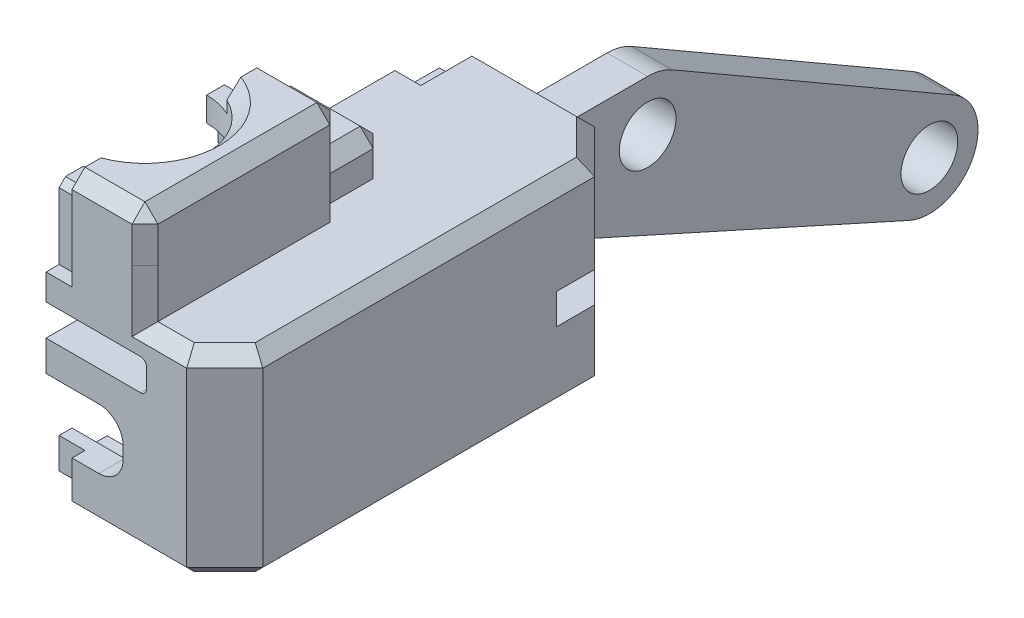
ISO-10303-21;
HEADER;
FILE_DESCRIPTION(('STEP AP214'),'2;1');
FILE_NAME('part.step','',(''),(''),'','','');
FILE_SCHEMA(('AUTOMOTIVE_DESIGN { 1 0 10303 214 1 1 1 1 }'));
ENDSEC;
DATA;
#1=APPLICATION_CONTEXT('core data for automotive mechanical design processes');
#2=APPLICATION_PROTOCOL_DEFINITION('international standard','automotive_design',2000,#1);
#3=PRODUCT_CONTEXT('',#1,'mechanical');
#4=PRODUCT('Part','Part','',(#3));
#5=PRODUCT_RELATED_PRODUCT_CATEGORY('part','',(#4));
#6=PRODUCT_DEFINITION_FORMATION('','',#4);
#7=PRODUCT_DEFINITION_CONTEXT('part definition',#1,'design');
#8=PRODUCT_DEFINITION('design','',#6,#7);
#9=PRODUCT_DEFINITION_SHAPE('','',#8);
#10=(LENGTH_UNIT() NAMED_UNIT(*) SI_UNIT(.MILLI.,.METRE.));
#11=(NAMED_UNIT(*) PLANE_ANGLE_UNIT() SI_UNIT($,.RADIAN.));
#12=(NAMED_UNIT(*) SI_UNIT($,.STERADIAN.) SOLID_ANGLE_UNIT());
#13=UNCERTAINTY_MEASURE_WITH_UNIT(LENGTH_MEASURE(1.E-05),#10,'distance_accuracy_value','');
#14=(GEOMETRIC_REPRESENTATION_CONTEXT(3) GLOBAL_UNCERTAINTY_ASSIGNED_CONTEXT((#13)) GLOBAL_UNIT_ASSIGNED_CONTEXT((#10,
#11,#12)) REPRESENTATION_CONTEXT('',''));
#15=CARTESIAN_POINT('',(0.,0.,0.));
#16=DIRECTION('',(0.,0.,1.));
#17=DIRECTION('',(1.,0.,0.));
#18=AXIS2_PLACEMENT_3D('',#15,#16,#17);
#19=CARTESIAN_POINT('',(0.,42.8800000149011,-18.1766586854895));
#20=DIRECTION('',(1.,0.,0.));
#21=DIRECTION('',(0.,0.,-1.));
#22=AXIS2_PLACEMENT_3D('',#19,#20,#21);
#23=CYLINDRICAL_SURFACE('',#22,3.);
#24=CARTESIAN_POINT('',(5.02,42.8800000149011,-18.1766586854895));
#25=DIRECTION('',(-1.,0.,0.));
#26=DIRECTION('',(0.,0.,1.));
#27=AXIS2_PLACEMENT_3D('',#24,#25,#26);
#28=CIRCLE('',#27,3.);
#29=CARTESIAN_POINT('',(5.02,45.4780762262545,-19.6766586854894));
#30=VERTEX_POINT('',#29);
#31=CARTESIAN_POINT('',(5.02,45.8800000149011,-18.1766586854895));
#32=VERTEX_POINT('',#31);
#33=EDGE_CURVE('E70',#30,#32,#28,.F.);
#34=ORIENTED_EDGE('',*,*,#33,.F.);
#35=DIRECTION('',(-1.,0.,0.));
#36=VECTOR('',#35,1.);
#37=CARTESIAN_POINT('',(34.8165648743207,45.4780762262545,-19.6766586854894));
#38=LINE('',#37,#36);
#39=CARTESIAN_POINT('',(2.52,45.4780762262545,-19.6766586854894));
#40=VERTEX_POINT('',#39);
#41=EDGE_CURVE('E735',#30,#40,#38,.T.);
#42=ORIENTED_EDGE('',*,*,#41,.T.);
#43=CARTESIAN_POINT('',(2.52,42.8800000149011,-18.1766586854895));
#44=DIRECTION('',(1.,0.,0.));
#45=DIRECTION('',(0.,0.,-1.));
#46=AXIS2_PLACEMENT_3D('',#43,#44,#45);
#47=CIRCLE('',#46,3.);
#48=CARTESIAN_POINT('',(2.52,45.8800000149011,-18.1766586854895));
#49=VERTEX_POINT('',#48);
#50=EDGE_CURVE('E748',#49,#40,#47,.F.);
#51=ORIENTED_EDGE('',*,*,#50,.F.);
#52=DIRECTION('',(1.,0.,0.));
#53=VECTOR('',#52,1.);
#54=CARTESIAN_POINT('',(2.52,45.8800000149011,-18.1766586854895));
#55=LINE('',#54,#53);
#56=EDGE_CURVE('E62',#32,#49,#55,.F.);
#57=ORIENTED_EDGE('',*,*,#56,.F.);
#58=EDGE_LOOP('',(#34,#42,#51,#57));
#59=FACE_BOUND('',#58,.T.);
#60=ADVANCED_FACE('F47',(#59),#23,.T.);
#61=CARTESIAN_POINT('',(-6.43860004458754,38.7500000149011,-11.6366586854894));
#62=DIRECTION('',(0.,0.,-1.));
#63=DIRECTION('',(1.,0.,0.));
#64=AXIS2_PLACEMENT_3D('',#61,#62,#63);
#65=PLANE('',#64);
#66=DIRECTION('',(-1.,0.,0.));
#67=VECTOR('',#66,1.);
#68=CARTESIAN_POINT('',(7.52,41.2487256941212,-11.6366586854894));
#69=LINE('',#68,#67);
#70=CARTESIAN_POINT('',(5.02,41.2487256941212,-11.6366586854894));
#71=VERTEX_POINT('',#70);
#72=CARTESIAN_POINT('',(2.52,41.2487256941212,-11.6366586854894));
#73=VERTEX_POINT('',#72);
#74=EDGE_CURVE('E1877',#71,#73,#69,.T.);
#75=ORIENTED_EDGE('',*,*,#74,.T.);
#76=DIRECTION('',(0.,-1.,0.));
#77=VECTOR('',#76,1.);
#78=CARTESIAN_POINT('',(2.52,41.2725000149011,-11.6366586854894));
#79=LINE('',#78,#77);
#80=CARTESIAN_POINT('',(2.52,41.2725000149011,-11.6366586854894));
#81=VERTEX_POINT('',#80);
#82=EDGE_CURVE('E1960',#81,#73,#79,.T.);
#83=ORIENTED_EDGE('',*,*,#82,.F.);
#84=DIRECTION('',(1.,0.,0.));
#85=VECTOR('',#84,1.);
#86=CARTESIAN_POINT('',(-1.65526073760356,41.2725000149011,-11.6366586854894));
#87=LINE('',#86,#85);
#88=CARTESIAN_POINT('',(6.22807856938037,41.2725000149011,-11.6366586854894));
#89=VERTEX_POINT('',#88);
#90=EDGE_CURVE('E1613',#81,#89,#87,.T.);
#91=ORIENTED_EDGE('',*,*,#90,.T.);
#92=DIRECTION('',(0.999970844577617,-0.0076360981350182,0.));
#93=VECTOR('',#92,1.);
#94=CARTESIAN_POINT('',(-0.0952606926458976,41.3207870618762,-11.6366586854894));
#95=LINE('',#94,#93);
#96=CARTESIAN_POINT('',(8.29709312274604,41.2567003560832,-11.6366586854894));
#97=VERTEX_POINT('',#96);
#98=EDGE_CURVE('E1770',#89,#97,#95,.T.);
#99=ORIENTED_EDGE('',*,*,#98,.T.);
#100=DIRECTION('',(0.,-1.,0.));
#101=VECTOR('',#100,1.);
#102=CARTESIAN_POINT('',(8.29709312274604,48.8800000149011,-11.6366586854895));
#103=LINE('',#102,#101);
#104=CARTESIAN_POINT('',(8.29709312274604,37.4500000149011,-11.6366586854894));
#105=VERTEX_POINT('',#104);
#106=EDGE_CURVE('E1634',#97,#105,#103,.T.);
#107=ORIENTED_EDGE('',*,*,#106,.T.);
#108=DIRECTION('',(1.,0.,0.));
#109=VECTOR('',#108,1.);
#110=CARTESIAN_POINT('',(-3.24360004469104,37.4500000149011,-11.6366586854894));
#111=LINE('',#110,#109);
#112=CARTESIAN_POINT('',(1.52,37.4500000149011,-11.6366586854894));
#113=VERTEX_POINT('',#112);
#114=EDGE_CURVE('E1627',#113,#105,#111,.T.);
#115=ORIENTED_EDGE('',*,*,#114,.F.);
#116=DIRECTION('',(0.,1.,0.));
#117=VECTOR('',#116,1.);
#118=CARTESIAN_POINT('',(1.52,38.8581250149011,-11.6366586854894));
#119=LINE('',#118,#117);
#120=CARTESIAN_POINT('',(1.52,39.6500000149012,-11.6366586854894));
#121=VERTEX_POINT('',#120);
#122=EDGE_CURVE('E1616',#113,#121,#119,.T.);
#123=ORIENTED_EDGE('',*,*,#122,.T.);
#124=DIRECTION('',(-1.,0.,0.));
#125=VECTOR('',#124,1.);
#126=CARTESIAN_POINT('',(2.52,39.6500000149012,-11.6366586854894));
#127=LINE('',#126,#125);
#128=CARTESIAN_POINT('',(5.02,39.6500000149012,-11.6366586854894));
#129=VERTEX_POINT('',#128);
#130=EDGE_CURVE('E1854',#129,#121,#127,.T.);
#131=ORIENTED_EDGE('',*,*,#130,.F.);
#132=DIRECTION('',(0.,-1.,0.));
#133=VECTOR('',#132,1.);
#134=CARTESIAN_POINT('',(5.02,45.8800000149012,-11.6366586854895));
#135=LINE('',#134,#133);
#136=EDGE_CURVE('E766',#71,#129,#135,.T.);
#137=ORIENTED_EDGE('',*,*,#136,.F.);
#138=EDGE_LOOP('',(#75,#83,#91,#99,#107,#115,#123,#131,#137));
#139=FACE_BOUND('',#138,.T.);
#140=ADVANCED_FACE('F2024',(#139),#65,.T.);
#141=CARTESIAN_POINT('',(2.52,45.8800000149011,-21.1766586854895));
#142=DIRECTION('',(1.,0.,0.));
#143=DIRECTION('',(0.,0.,-1.));
#144=AXIS2_PLACEMENT_3D('',#141,#142,#143);
#145=PLANE('',#144);
#146=DIRECTION('',(0.,0.41114785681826,0.911568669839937));
#147=VECTOR('',#146,1.);
#148=CARTESIAN_POINT('',(2.52,39.6500000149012,-13.1766586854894));
#149=LINE('',#148,#147);
#150=CARTESIAN_POINT('',(2.51999999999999,30.116667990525,-34.313304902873));
#151=VERTEX_POINT('',#150);
#152=CARTESIAN_POINT('',(2.52,39.6500000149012,-13.1766586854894));
#153=VERTEX_POINT('',#152);
#154=EDGE_CURVE('E750',#151,#153,#149,.T.);
#155=ORIENTED_EDGE('',*,*,#154,.T.);
#156=DIRECTION('',(0.,-1.,0.));
#157=VECTOR('',#156,1.);
#158=CARTESIAN_POINT('',(2.52,41.2725000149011,-13.1766586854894));
#159=LINE('',#158,#157);
#160=CARTESIAN_POINT('',(2.52,41.2487256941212,-13.1766586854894));
#161=VERTEX_POINT('',#160);
#162=EDGE_CURVE('E1948',#161,#153,#159,.T.);
#163=ORIENTED_EDGE('',*,*,#162,.F.);
#164=DIRECTION('',(0.,0.,1.));
#165=VECTOR('',#164,1.);
#166=CARTESIAN_POINT('',(2.52,41.2487256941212,-11.6366586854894));
#167=LINE('',#166,#165);
#168=CARTESIAN_POINT('',(2.52,41.2487256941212,-13.6366586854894));
#169=VERTEX_POINT('',#168);
#170=EDGE_CURVE('E1883',#169,#161,#167,.T.);
#171=ORIENTED_EDGE('',*,*,#170,.F.);
#172=DIRECTION('',(0.,-1.,0.));
#173=VECTOR('',#172,1.);
#174=CARTESIAN_POINT('',(2.52,43.1225000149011,-13.6366586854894));
#175=LINE('',#174,#173);
#176=CARTESIAN_POINT('',(2.52,43.1225000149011,-13.6366586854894));
#177=VERTEX_POINT('',#176);
#178=EDGE_CURVE('E1893',#177,#169,#175,.T.);
#179=ORIENTED_EDGE('',*,*,#178,.F.);
#180=DIRECTION('',(0.,0.,-1.));
#181=VECTOR('',#180,1.);
#182=CARTESIAN_POINT('',(2.52,43.1225000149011,-11.6366586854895));
#183=LINE('',#182,#181);
#184=CARTESIAN_POINT('',(2.52,43.1225000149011,-13.1766586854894));
#185=VERTEX_POINT('',#184);
#186=EDGE_CURVE('E1897',#185,#177,#183,.T.);
#187=ORIENTED_EDGE('',*,*,#186,.F.);
#188=DIRECTION('',(0.,-1.,0.));
#189=VECTOR('',#188,1.);
#190=CARTESIAN_POINT('',(2.52,45.8800000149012,-13.1766586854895));
#191=LINE('',#190,#189);
#192=CARTESIAN_POINT('',(2.52,45.8800000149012,-13.1766586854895));
#193=VERTEX_POINT('',#192);
#194=EDGE_CURVE('E1913',#193,#185,#191,.T.);
#195=ORIENTED_EDGE('',*,*,#194,.F.);
#196=DIRECTION('',(0.,0.,1.));
#197=VECTOR('',#196,1.);
#198=CARTESIAN_POINT('',(2.52,45.8800000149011,-21.1766586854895));
#199=LINE('',#198,#197);
#200=EDGE_CURVE('E756',#49,#193,#199,.T.);
#201=ORIENTED_EDGE('',*,*,#200,.F.);
#202=ORIENTED_EDGE('',*,*,#50,.T.);
#203=DIRECTION('',(0.,-0.499999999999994,-0.866025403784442));
#204=VECTOR('',#203,1.);
#205=CARTESIAN_POINT('',(2.52,45.4780762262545,-19.6766586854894));
#206=LINE('',#205,#204);
#207=CARTESIAN_POINT('',(2.51999999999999,35.4494502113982,-37.0467484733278));
#208=VERTEX_POINT('',#207);
#209=EDGE_CURVE('E731',#40,#208,#206,.T.);
#210=ORIENTED_EDGE('',*,*,#209,.T.);
#211=CARTESIAN_POINT('',(2.51999999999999,32.8513740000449,-35.5467484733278));
#212=DIRECTION('',(-1.,0.,0.));
#213=DIRECTION('',(0.,0.,1.));
#214=AXIS2_PLACEMENT_3D('',#211,#212,#213);
#215=CIRCLE('',#214,3.00000000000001);
#216=EDGE_CURVE('E743',#208,#151,#215,.T.);
#217=ORIENTED_EDGE('',*,*,#216,.T.);
#218=EDGE_LOOP('',(#155,#163,#171,#179,#187,#195,#201,#202,#210,#217));
#219=FACE_BOUND('',#218,.T.);
#220=CARTESIAN_POINT('',(2.52,42.7650000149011,-18.1766586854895));
#221=DIRECTION('',(-1.,0.,0.));
#222=DIRECTION('',(0.,0.,1.));
#223=AXIS2_PLACEMENT_3D('',#220,#221,#222);
#224=CIRCLE('',#223,1.74999999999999);
#225=CARTESIAN_POINT('',(2.52,42.7650000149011,-16.4266586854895));
#226=VERTEX_POINT('',#225);
#227=EDGE_CURVE('E1869',#226,#226,#224,.T.);
#228=ORIENTED_EDGE('',*,*,#227,.F.);
#229=EDGE_LOOP('',(#228));
#230=FACE_BOUND('',#229,.T.);
#231=CARTESIAN_POINT('',(2.51999999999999,32.8513740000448,-35.5467484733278));
#232=DIRECTION('',(-1.,0.,0.));
#233=DIRECTION('',(0.,0.,1.));
#234=AXIS2_PLACEMENT_3D('',#231,#232,#233);
#235=CIRCLE('',#234,1.74999999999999);
#236=CARTESIAN_POINT('',(2.51999999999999,32.8513740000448,-33.7967484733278));
#237=VERTEX_POINT('',#236);
#238=EDGE_CURVE('E744',#237,#237,#235,.T.);
#239=ORIENTED_EDGE('',*,*,#238,.F.);
#240=EDGE_LOOP('',(#239));
#241=FACE_BOUND('',#240,.T.);
#242=ADVANCED_FACE('F753',(#219,#230,#241),#145,.F.);
#243=CARTESIAN_POINT('',(-6.43860004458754,38.7500000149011,-11.6366586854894));
#244=DIRECTION('',(0.,0.,-1.));
#245=DIRECTION('',(1.,0.,0.));
#246=AXIS2_PLACEMENT_3D('',#243,#244,#245);
#247=PLANE('',#246);
#248=DIRECTION('',(1.,0.,0.));
#249=VECTOR('',#248,1.);
#250=CARTESIAN_POINT('',(2.52,45.8800000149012,-11.6366586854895));
#251=LINE('',#250,#249);
#252=CARTESIAN_POINT('',(1.52,45.8800000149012,-11.6366586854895));
#253=VERTEX_POINT('',#252);
#254=CARTESIAN_POINT('',(5.02,45.8800000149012,-11.6366586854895));
#255=VERTEX_POINT('',#254);
#256=EDGE_CURVE('E1861',#253,#255,#251,.T.);
#257=ORIENTED_EDGE('',*,*,#256,.F.);
#258=DIRECTION('',(0.,1.,0.));
#259=VECTOR('',#258,1.);
#260=CARTESIAN_POINT('',(1.52,42.3731250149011,-11.6366586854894));
#261=LINE('',#260,#259);
#262=CARTESIAN_POINT('',(1.52,48.0800000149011,-11.6366586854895));
#263=VERTEX_POINT('',#262);
#264=EDGE_CURVE('E898',#253,#263,#261,.T.);
#265=ORIENTED_EDGE('',*,*,#264,.T.);
#266=DIRECTION('',(-1.,0.,0.));
#267=VECTOR('',#266,1.);
#268=CARTESIAN_POINT('',(-3.24360004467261,48.0800000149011,-11.6366586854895));
#269=LINE('',#268,#267);
#270=CARTESIAN_POINT('',(8.29709312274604,48.0800000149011,-11.6366586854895));
#271=VERTEX_POINT('',#270);
#272=EDGE_CURVE('E890',#271,#263,#269,.T.);
#273=ORIENTED_EDGE('',*,*,#272,.F.);
#274=DIRECTION('',(0.,-1.,0.));
#275=VECTOR('',#274,1.);
#276=CARTESIAN_POINT('',(8.29709312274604,48.8800000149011,-11.6366586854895));
#277=LINE('',#276,#275);
#278=CARTESIAN_POINT('',(8.29709312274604,43.1225000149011,-11.6366586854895));
#279=VERTEX_POINT('',#278);
#280=EDGE_CURVE('E1594',#271,#279,#277,.T.);
#281=ORIENTED_EDGE('',*,*,#280,.T.);
#282=DIRECTION('',(-1.,0.,0.));
#283=VECTOR('',#282,1.);
#284=CARTESIAN_POINT('',(-0.105260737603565,43.1225000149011,-11.6366586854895));
#285=LINE('',#284,#283);
#286=CARTESIAN_POINT('',(5.02,43.1225000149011,-11.6366586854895));
#287=VERTEX_POINT('',#286);
#288=EDGE_CURVE('E1219',#279,#287,#285,.T.);
#289=ORIENTED_EDGE('',*,*,#288,.T.);
#290=EDGE_CURVE('E1857',#255,#287,#135,.T.);
#291=ORIENTED_EDGE('',*,*,#290,.F.);
#292=EDGE_LOOP('',(#257,#265,#273,#281,#289,#291));
#293=FACE_BOUND('',#292,.T.);
#294=ADVANCED_FACE('F2055',(#293),#247,.T.);
#295=CARTESIAN_POINT('',(1.52,53.0800000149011,2.76834131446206));
#296=DIRECTION('',(1.,0.,0.));
#297=DIRECTION('',(0.,0.,-1.));
#298=AXIS2_PLACEMENT_3D('',#295,#296,#297);
#299=PLANE('',#298);
#300=CARTESIAN_POINT('',(1.52,54.8800000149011,3.40556958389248));
#301=CARTESIAN_POINT('',(1.52,54.4353562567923,3.87982637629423));
#302=CARTESIAN_POINT('',(1.51999999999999,54.0800000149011,4.27160372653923));
#303=(BOUNDED_CURVE() B_SPLINE_CURVE(2,(#300,#301,#302),.UNSPECIFIED.,.F.,
.F.) B_SPLINE_CURVE_WITH_KNOTS((3,3),(0.,0.0432935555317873),
.UNSPECIFIED.) CURVE() GEOMETRIC_REPRESENTATION_ITEM() RATIONAL_B_SPLINE_CURVE((1.,
1.07725738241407,1.14814814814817)) REPRESENTATION_ITEM(''));
#304=CARTESIAN_POINT('',(1.52,54.8800000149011,3.40556958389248));
#305=VERTEX_POINT('',#304);
#306=CARTESIAN_POINT('',(1.52,54.0800000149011,4.27160372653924));
#307=VERTEX_POINT('',#306);
#308=EDGE_CURVE('E1453',#305,#307,#303,.T.);
#309=ORIENTED_EDGE('',*,*,#308,.F.);
#310=DIRECTION('',(0.,0.,-1.));
#311=VECTOR('',#310,1.);
#312=CARTESIAN_POINT('',(1.52,54.8800000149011,7.71834131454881));
#313=LINE('',#312,#311);
#314=CARTESIAN_POINT('',(1.52,54.8800000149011,2.41834131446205));
#315=VERTEX_POINT('',#314);
#316=EDGE_CURVE('E1724',#305,#315,#313,.T.);
#317=ORIENTED_EDGE('',*,*,#316,.T.);
#318=DIRECTION('',(0.,0.707106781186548,0.707106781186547));
#319=VECTOR('',#318,1.);
#320=CARTESIAN_POINT('',(1.52,54.3175000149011,1.85584131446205));
#321=LINE('',#320,#319);
#322=CARTESIAN_POINT('',(1.52,54.0800000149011,1.61834131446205));
#323=VERTEX_POINT('',#322);
#324=EDGE_CURVE('E1728',#323,#315,#321,.T.);
#325=ORIENTED_EDGE('',*,*,#324,.F.);
#326=DIRECTION('',(0.,1.,0.));
#327=VECTOR('',#326,1.);
#328=CARTESIAN_POINT('',(1.52,52.8800000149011,1.61834131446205));
#329=LINE('',#328,#327);
#330=CARTESIAN_POINT('',(1.52,51.2800000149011,1.61834131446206));
#331=VERTEX_POINT('',#330);
#332=EDGE_CURVE('E770',#331,#323,#329,.T.);
#333=ORIENTED_EDGE('',*,*,#332,.F.);
#334=DIRECTION('',(0.,0.,-1.));
#335=VECTOR('',#334,1.);
#336=CARTESIAN_POINT('',(1.52,51.2800000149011,1.61834131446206));
#337=LINE('',#336,#335);
#338=CARTESIAN_POINT('',(1.52,51.2800000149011,2.42334131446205));
#339=VERTEX_POINT('',#338);
#340=EDGE_CURVE('E951',#339,#331,#337,.T.);
#341=ORIENTED_EDGE('',*,*,#340,.F.);
#342=DIRECTION('',(0.,-1.,0.));
#343=VECTOR('',#342,1.);
#344=CARTESIAN_POINT('',(1.52,52.9779289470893,2.42334131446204));
#345=LINE('',#344,#343);
#346=CARTESIAN_POINT('',(1.52,52.9779289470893,2.42334131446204));
#347=VERTEX_POINT('',#346);
#348=EDGE_CURVE('E775',#347,#339,#345,.T.);
#349=ORIENTED_EDGE('',*,*,#348,.F.);
#350=DIRECTION('',(0.,-0.707106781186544,-0.707106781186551));
#351=VECTOR('',#350,1.);
#352=CARTESIAN_POINT('',(1.52,53.3750000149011,2.8204123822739));
#353=LINE('',#352,#351);
#354=CARTESIAN_POINT('',(1.52,53.3750000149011,2.8204123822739));
#355=VERTEX_POINT('',#354);
#356=EDGE_CURVE('E782',#355,#347,#353,.T.);
#357=ORIENTED_EDGE('',*,*,#356,.F.);
#358=DIRECTION('',(0.,0.,-1.));
#359=VECTOR('',#358,1.);
#360=CARTESIAN_POINT('',(1.52,53.3750000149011,7.69230578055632));
#361=LINE('',#360,#359);
#362=CARTESIAN_POINT('',(1.52,53.3750000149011,4.27160372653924));
#363=VERTEX_POINT('',#362);
#364=EDGE_CURVE('E1388',#363,#355,#361,.T.);
#365=ORIENTED_EDGE('',*,*,#364,.F.);
#366=DIRECTION('',(0.,1.,0.));
#367=VECTOR('',#366,1.);
#368=CARTESIAN_POINT('',(1.52,51.8800000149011,4.27160372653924));
#369=LINE('',#368,#367);
#370=EDGE_CURVE('E1425',#363,#307,#369,.T.);
#371=ORIENTED_EDGE('',*,*,#370,.T.);
#372=EDGE_LOOP('',(#309,#317,#325,#333,#341,#349,#357,#365,#371));
#373=FACE_BOUND('',#372,.T.);
#374=ADVANCED_FACE('F2368',(#373),#299,.F.);
#375=CARTESIAN_POINT('',(5.02,52.6800000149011,1.61834131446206));
#376=DIRECTION('',(0.,0.,1.));
#377=DIRECTION('',(-1.,0.,0.));
#378=AXIS2_PLACEMENT_3D('',#375,#376,#377);
#379=PLANE('',#378);
#380=DIRECTION('',(0.,1.,0.));
#381=VECTOR('',#380,1.);
#382=CARTESIAN_POINT('',(5.22,52.6800000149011,1.61834131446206));
#383=LINE('',#382,#381);
#384=CARTESIAN_POINT('',(5.22,48.8800000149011,1.61834131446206));
#385=VERTEX_POINT('',#384);
#386=CARTESIAN_POINT('',(5.22,54.0800000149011,1.61834131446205));
#387=VERTEX_POINT('',#386);
#388=EDGE_CURVE('E767',#385,#387,#383,.T.);
#389=ORIENTED_EDGE('',*,*,#388,.F.);
#390=DIRECTION('',(-1.,0.,0.));
#391=VECTOR('',#390,1.);
#392=CARTESIAN_POINT('',(5.72534998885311,48.8800000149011,1.61834131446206));
#393=LINE('',#392,#391);
#394=CARTESIAN_POINT('',(5.02,48.8800000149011,1.61834131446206));
#395=VERTEX_POINT('',#394);
#396=EDGE_CURVE('E847',#385,#395,#393,.T.);
#397=ORIENTED_EDGE('',*,*,#396,.T.);
#398=DIRECTION('',(0.,-1.,0.));
#399=VECTOR('',#398,1.);
#400=CARTESIAN_POINT('',(5.02,52.6800000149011,1.61834131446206));
#401=LINE('',#400,#399);
#402=CARTESIAN_POINT('',(5.02,50.4800000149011,1.61834131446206));
#403=VERTEX_POINT('',#402);
#404=EDGE_CURVE('E812',#403,#395,#401,.T.);
#405=ORIENTED_EDGE('',*,*,#404,.F.);
#406=DIRECTION('',(0.707106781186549,-0.707106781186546,0.));
#407=VECTOR('',#406,1.);
#408=CARTESIAN_POINT('',(4.27,51.2300000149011,1.61834131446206));
#409=LINE('',#408,#407);
#410=CARTESIAN_POINT('',(4.22,51.2800000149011,1.61834131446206));
#411=VERTEX_POINT('',#410);
#412=EDGE_CURVE('E799',#411,#403,#409,.T.);
#413=ORIENTED_EDGE('',*,*,#412,.F.);
#414=DIRECTION('',(1.,0.,0.));
#415=VECTOR('',#414,1.);
#416=CARTESIAN_POINT('',(2.47,51.2800000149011,1.61834131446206));
#417=LINE('',#416,#415);
#418=EDGE_CURVE('E947',#331,#411,#417,.T.);
#419=ORIENTED_EDGE('',*,*,#418,.F.);
#420=ORIENTED_EDGE('',*,*,#332,.T.);
#421=DIRECTION('',(-1.,0.,0.));
#422=VECTOR('',#421,1.);
#423=CARTESIAN_POINT('',(2.47,54.0800000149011,1.61834131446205));
#424=LINE('',#423,#422);
#425=EDGE_CURVE('E1407',#387,#323,#424,.T.);
#426=ORIENTED_EDGE('',*,*,#425,.F.);
#427=EDGE_LOOP('',(#389,#397,#405,#413,#419,#420,#426));
#428=FACE_BOUND('',#427,.T.);
#429=ADVANCED_FACE('F2217',(#428),#379,.F.);
#430=CARTESIAN_POINT('',(5.62,52.6800000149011,2.01834131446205));
#431=DIRECTION('',(0.707106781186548,0.,-0.707106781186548));
#432=DIRECTION('',(-0.707106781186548,0.,-0.707106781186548));
#433=AXIS2_PLACEMENT_3D('',#430,#431,#432);
#434=PLANE('',#433);
#435=DIRECTION('',(0.,-1.,0.));
#436=VECTOR('',#435,1.);
#437=CARTESIAN_POINT('',(6.02,52.2800000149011,2.41834131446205));
#438=LINE('',#437,#436);
#439=CARTESIAN_POINT('',(6.02,54.0800000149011,2.41834131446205));
#440=VERTEX_POINT('',#439);
#441=CARTESIAN_POINT('',(6.02,48.8800000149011,2.41834131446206));
#442=VERTEX_POINT('',#441);
#443=EDGE_CURVE('E771',#440,#442,#438,.T.);
#444=ORIENTED_EDGE('',*,*,#443,.T.);
#445=DIRECTION('',(-0.707106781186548,0.,-0.707106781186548));
#446=VECTOR('',#445,1.);
#447=CARTESIAN_POINT('',(3.97097498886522,48.8800000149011,0.369316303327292));
#448=LINE('',#447,#446);
#449=EDGE_CURVE('E843',#442,#385,#448,.T.);
#450=ORIENTED_EDGE('',*,*,#449,.T.);
#451=ORIENTED_EDGE('',*,*,#388,.T.);
#452=DIRECTION('',(0.707106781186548,0.,0.707106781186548));
#453=VECTOR('',#452,1.);
#454=CARTESIAN_POINT('',(5.22,54.0800000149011,1.61834131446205));
#455=LINE('',#454,#453);
#456=EDGE_CURVE('E1394',#387,#440,#455,.T.);
#457=ORIENTED_EDGE('',*,*,#456,.T.);
#458=EDGE_LOOP('',(#444,#450,#451,#457));
#459=FACE_BOUND('',#458,.T.);
#460=ADVANCED_FACE('F2222',(#459),#434,.T.);
#461=CARTESIAN_POINT('',(6.02,52.6800000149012,13.818341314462));
#462=DIRECTION('',(-1.,0.,0.));
#463=DIRECTION('',(0.,0.,-1.));
#464=AXIS2_PLACEMENT_3D('',#461,#462,#463);
#465=PLANE('',#464);
#466=DIRECTION('',(0.,1.,0.));
#467=VECTOR('',#466,1.);
#468=CARTESIAN_POINT('',(6.02,45.3150000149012,13.0183413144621));
#469=LINE('',#468,#467);
#470=CARTESIAN_POINT('',(6.02,51.8800000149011,13.018341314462));
#471=VERTEX_POINT('',#470);
#472=CARTESIAN_POINT('',(6.02,54.0800000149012,13.018341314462));
#473=VERTEX_POINT('',#472);
#474=EDGE_CURVE('E772',#471,#473,#469,.T.);
#475=ORIENTED_EDGE('',*,*,#474,.F.);
#476=DIRECTION('',(0.,1.,0.));
#477=VECTOR('',#476,1.);
#478=CARTESIAN_POINT('',(6.02,52.6800000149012,13.018341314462));
#479=LINE('',#478,#477);
#480=CARTESIAN_POINT('',(6.02,48.8800000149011,13.0183413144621));
#481=VERTEX_POINT('',#480);
#482=EDGE_CURVE('E822',#481,#471,#479,.T.);
#483=ORIENTED_EDGE('',*,*,#482,.F.);
#484=DIRECTION('',(0.,0.,-1.));
#485=VECTOR('',#484,1.);
#486=CARTESIAN_POINT('',(6.02,48.8800000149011,10.7683413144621));
#487=LINE('',#486,#485);
#488=EDGE_CURVE('E839',#481,#442,#487,.T.);
#489=ORIENTED_EDGE('',*,*,#488,.T.);
#490=ORIENTED_EDGE('',*,*,#443,.F.);
#491=DIRECTION('',(0.,0.,-1.));
#492=VECTOR('',#491,1.);
#493=CARTESIAN_POINT('',(6.02,54.0800000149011,10.768341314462));
#494=LINE('',#493,#492);
#495=EDGE_CURVE('E1402',#473,#440,#494,.T.);
#496=ORIENTED_EDGE('',*,*,#495,.F.);
#497=EDGE_LOOP('',(#475,#483,#489,#490,#496));
#498=FACE_BOUND('',#497,.T.);
#499=ADVANCED_FACE('F2226',(#498),#465,.F.);
#500=CARTESIAN_POINT('',(5.62,45.3150000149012,13.4183413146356));
#501=DIRECTION('',(0.707106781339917,0.,0.707106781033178));
#502=DIRECTION('',(0.707106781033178,0.,-0.707106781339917));
#503=AXIS2_PLACEMENT_3D('',#500,#501,#502);
#504=PLANE('',#503);
#505=DIRECTION('',(0.,-1.,0.));
#506=VECTOR('',#505,1.);
#507=CARTESIAN_POINT('',(5.22,45.3150000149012,13.8183413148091));
#508=LINE('',#507,#506);
#509=CARTESIAN_POINT('',(5.22,54.0800000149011,13.8183413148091));
#510=VERTEX_POINT('',#509);
#511=CARTESIAN_POINT('',(5.22,51.8800000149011,13.818341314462));
#512=VERTEX_POINT('',#511);
#513=EDGE_CURVE('E920',#510,#512,#508,.T.);
#514=ORIENTED_EDGE('',*,*,#513,.T.);
#515=DIRECTION('',(-0.707106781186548,0.,0.707106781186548));
#516=VECTOR('',#515,1.);
#517=CARTESIAN_POINT('',(5.62,51.8800000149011,13.4183413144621));
#518=LINE('',#517,#516);
#519=EDGE_CURVE('E819',#471,#512,#518,.T.);
#520=ORIENTED_EDGE('',*,*,#519,.F.);
#521=ORIENTED_EDGE('',*,*,#474,.T.);
#522=DIRECTION('',(-0.707106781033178,0.,0.707106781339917));
#523=VECTOR('',#522,1.);
#524=CARTESIAN_POINT('',(6.02,54.0800000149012,13.018341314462));
#525=LINE('',#524,#523);
#526=EDGE_CURVE('E1398',#473,#510,#525,.T.);
#527=ORIENTED_EDGE('',*,*,#526,.T.);
#528=EDGE_LOOP('',(#514,#520,#521,#527));
#529=FACE_BOUND('',#528,.T.);
#530=ADVANCED_FACE('F2535',(#529),#504,.T.);
#531=CARTESIAN_POINT('',(-0.080000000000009,52.9779289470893,2.42334131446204));
#532=DIRECTION('',(0.,0.,1.));
#533=DIRECTION('',(0.,-1.,0.));
#534=AXIS2_PLACEMENT_3D('',#531,#532,#533);
#535=PLANE('',#534);
#536=DIRECTION('',(0.,-1.,0.));
#537=VECTOR('',#536,1.);
#538=CARTESIAN_POINT('',(-0.080000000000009,49.3839644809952,2.42334131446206));
#539=LINE('',#538,#537);
#540=CARTESIAN_POINT('',(-0.080000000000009,52.9779289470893,2.42334131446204));
#541=VERTEX_POINT('',#540);
#542=CARTESIAN_POINT('',(-0.080000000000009,51.2800000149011,2.42334131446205));
#543=VERTEX_POINT('',#542);
#544=EDGE_CURVE('E1043',#541,#543,#539,.T.);
#545=ORIENTED_EDGE('',*,*,#544,.F.);
#546=DIRECTION('',(1.,0.,0.));
#547=VECTOR('',#546,1.);
#548=CARTESIAN_POINT('',(-0.080000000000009,52.9779289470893,2.42334131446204));
#549=LINE('',#548,#547);
#550=EDGE_CURVE('E778',#541,#347,#549,.T.);
#551=ORIENTED_EDGE('',*,*,#550,.T.);
#552=ORIENTED_EDGE('',*,*,#348,.T.);
#553=DIRECTION('',(1.,0.,0.));
#554=VECTOR('',#553,1.);
#555=CARTESIAN_POINT('',(-0.080000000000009,51.2800000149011,2.42334131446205));
#556=LINE('',#555,#554);
#557=EDGE_CURVE('E955',#543,#339,#556,.T.);
#558=ORIENTED_EDGE('',*,*,#557,.F.);
#559=EDGE_LOOP('',(#545,#551,#552,#558));
#560=FACE_BOUND('',#559,.T.);
#561=ADVANCED_FACE('F2193',(#560),#535,.F.);
#562=CARTESIAN_POINT('',(-0.080000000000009,53.3750000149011,2.8204123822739));
#563=DIRECTION('',(0.,-0.707106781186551,0.707106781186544));
#564=DIRECTION('',(0.,-0.707106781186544,-0.707106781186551));
#565=AXIS2_PLACEMENT_3D('',#562,#563,#564);
#566=PLANE('',#565);
#567=DIRECTION('',(0.,-0.707106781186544,-0.707106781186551));
#568=VECTOR('',#567,1.);
#569=CARTESIAN_POINT('',(-0.080000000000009,51.505602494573,0.951014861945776));
#570=LINE('',#569,#568);
#571=CARTESIAN_POINT('',(-0.080000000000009,53.3750000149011,2.8204123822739));
#572=VERTEX_POINT('',#571);
#573=EDGE_CURVE('E790',#572,#541,#570,.T.);
#574=ORIENTED_EDGE('',*,*,#573,.F.);
#575=DIRECTION('',(1.,0.,0.));
#576=VECTOR('',#575,1.);
#577=CARTESIAN_POINT('',(-0.080000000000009,53.3750000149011,2.8204123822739));
#578=LINE('',#577,#576);
#579=EDGE_CURVE('E1392',#572,#355,#578,.T.);
#580=ORIENTED_EDGE('',*,*,#579,.T.);
#581=ORIENTED_EDGE('',*,*,#356,.T.);
#582=ORIENTED_EDGE('',*,*,#550,.F.);
#583=EDGE_LOOP('',(#574,#580,#581,#582));
#584=FACE_BOUND('',#583,.T.);
#585=ADVANCED_FACE('F2187',(#584),#566,.F.);
#586=CARTESIAN_POINT('',(-0.080000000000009,52.9779289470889,13.013341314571));
#587=DIRECTION('',(0.,-0.707106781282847,-0.707106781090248));
#588=DIRECTION('',(0.,0.707106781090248,-0.707106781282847));
#589=AXIS2_PLACEMENT_3D('',#586,#587,#588);
#590=PLANE('',#589);
#591=DIRECTION('',(0.,0.707106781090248,-0.707106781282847));
#592=VECTOR('',#591,1.);
#593=CARTESIAN_POINT('',(-0.080000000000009,53.7023264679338,12.2889437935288));
#594=LINE('',#593,#592);
#595=CARTESIAN_POINT('',(-0.080000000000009,52.9779289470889,13.013341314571));
#596=VERTEX_POINT('',#595);
#597=CARTESIAN_POINT('',(-0.080000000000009,53.3750000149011,12.6162702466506));
#598=VERTEX_POINT('',#597);
#599=EDGE_CURVE('E903',#596,#598,#594,.T.);
#600=ORIENTED_EDGE('',*,*,#599,.F.);
#601=DIRECTION('',(1.,0.,0.));
#602=VECTOR('',#601,1.);
#603=CARTESIAN_POINT('',(-0.080000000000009,52.9779289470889,13.013341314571));
#604=LINE('',#603,#602);
#605=CARTESIAN_POINT('',(1.52,52.9779289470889,13.013341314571));
#606=VERTEX_POINT('',#605);
#607=EDGE_CURVE('E786',#596,#606,#604,.T.);
#608=ORIENTED_EDGE('',*,*,#607,.T.);
#609=DIRECTION('',(0.,0.707106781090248,-0.707106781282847));
#610=VECTOR('',#609,1.);
#611=CARTESIAN_POINT('',(1.52,53.3750000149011,12.6162702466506));
#612=LINE('',#611,#610);
#613=CARTESIAN_POINT('',(1.52,53.3750000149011,12.6162702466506));
#614=VERTEX_POINT('',#613);
#615=EDGE_CURVE('E1430',#606,#614,#612,.T.);
#616=ORIENTED_EDGE('',*,*,#615,.T.);
#617=DIRECTION('',(1.,0.,0.));
#618=VECTOR('',#617,1.);
#619=CARTESIAN_POINT('',(-0.080000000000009,53.3750000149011,12.6162702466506));
#620=LINE('',#619,#618);
#621=EDGE_CURVE('E1383',#598,#614,#620,.T.);
#622=ORIENTED_EDGE('',*,*,#621,.F.);
#623=EDGE_LOOP('',(#600,#608,#616,#622));
#624=FACE_BOUND('',#623,.T.);
#625=ADVANCED_FACE('F2562',(#624),#590,.F.);
#626=CARTESIAN_POINT('',(-0.080000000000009,48.8800000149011,13.013341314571));
#627=DIRECTION('',(0.,0.,-1.));
#628=DIRECTION('',(0.,1.,0.));
#629=AXIS2_PLACEMENT_3D('',#626,#627,#628);
#630=PLANE('',#629);
#631=DIRECTION('',(0.,1.,0.));
#632=VECTOR('',#631,1.);
#633=CARTESIAN_POINT('',(-0.080000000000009,47.3350000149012,13.013341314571));
#634=LINE('',#633,#632);
#635=CARTESIAN_POINT('',(-0.080000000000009,48.8800000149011,13.013341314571));
#636=VERTEX_POINT('',#635);
#637=EDGE_CURVE('E906',#636,#596,#634,.T.);
#638=ORIENTED_EDGE('',*,*,#637,.F.);
#639=DIRECTION('',(1.,0.,0.));
#640=VECTOR('',#639,1.);
#641=CARTESIAN_POINT('',(-0.080000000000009,48.8800000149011,13.013341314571));
#642=LINE('',#641,#640);
#643=CARTESIAN_POINT('',(1.52,48.8800000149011,13.013341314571));
#644=VERTEX_POINT('',#643);
#645=EDGE_CURVE('E1040',#636,#644,#642,.T.);
#646=ORIENTED_EDGE('',*,*,#645,.T.);
#647=DIRECTION('',(0.,1.,0.));
#648=VECTOR('',#647,1.);
#649=CARTESIAN_POINT('',(1.52,52.9779289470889,13.013341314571));
#650=LINE('',#649,#648);
#651=EDGE_CURVE('E1434',#644,#606,#650,.T.);
#652=ORIENTED_EDGE('',*,*,#651,.T.);
#653=ORIENTED_EDGE('',*,*,#607,.F.);
#654=EDGE_LOOP('',(#638,#646,#652,#653));
#655=FACE_BOUND('',#654,.T.);
#656=ADVANCED_FACE('F2558',(#655),#630,.F.);
#657=CARTESIAN_POINT('',(-0.080000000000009,48.8800000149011,13.81834131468));
#658=DIRECTION('',(0.,-1.,0.));
#659=DIRECTION('',(0.,0.,-1.));
#660=AXIS2_PLACEMENT_3D('',#657,#658,#659);
#661=PLANE('',#660);
#662=DIRECTION('',(0.,0.,-1.));
#663=VECTOR('',#662,1.);
#664=CARTESIAN_POINT('',(-0.080000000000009,48.8800000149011,8.37308180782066));
#665=LINE('',#664,#663);
#666=CARTESIAN_POINT('',(-0.080000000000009,48.8800000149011,13.81834131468));
#667=VERTEX_POINT('',#666);
#668=EDGE_CURVE('E910',#667,#636,#665,.T.);
#669=ORIENTED_EDGE('',*,*,#668,.F.);
#670=DIRECTION('',(-1.,0.,0.));
#671=VECTOR('',#670,1.);
#672=CARTESIAN_POINT('',(-0.080000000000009,48.8800000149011,13.8183413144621));
#673=LINE('',#672,#671);
#674=CARTESIAN_POINT('',(1.52,48.8800000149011,13.81834131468));
#675=VERTEX_POINT('',#674);
#676=EDGE_CURVE('E939',#675,#667,#673,.T.);
#677=ORIENTED_EDGE('',*,*,#676,.F.);
#678=DIRECTION('',(0.,0.,-1.));
#679=VECTOR('',#678,1.);
#680=CARTESIAN_POINT('',(1.52,48.8800000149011,12.2183413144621));
#681=LINE('',#680,#679);
#682=EDGE_CURVE('E1590',#675,#644,#681,.T.);
#683=ORIENTED_EDGE('',*,*,#682,.T.);
#684=ORIENTED_EDGE('',*,*,#645,.F.);
#685=EDGE_LOOP('',(#669,#677,#683,#684));
#686=FACE_BOUND('',#685,.T.);
#687=ADVANCED_FACE('F2471',(#686),#661,.F.);
#688=CARTESIAN_POINT('',(-0.080000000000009,45.7900000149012,2.92782230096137));
#689=DIRECTION('',(-1.,0.,0.));
#690=DIRECTION('',(0.,0.,1.));
#691=AXIS2_PLACEMENT_3D('',#688,#689,#690);
#692=PLANE('',#691);
#693=DIRECTION('',(0.,0.,-1.));
#694=VECTOR('',#693,1.);
#695=CARTESIAN_POINT('',(-0.080000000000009,53.3750000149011,3.4230818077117));
#696=LINE('',#695,#694);
#697=CARTESIAN_POINT('',(-0.080000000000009,53.3750000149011,3.91834131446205));
#698=VERTEX_POINT('',#697);
#699=EDGE_CURVE('E1387',#698,#572,#696,.T.);
#700=ORIENTED_EDGE('',*,*,#699,.T.);
#701=ORIENTED_EDGE('',*,*,#573,.T.);
#702=ORIENTED_EDGE('',*,*,#544,.T.);
#703=DIRECTION('',(0.,0.,-1.));
#704=VECTOR('',#703,1.);
#705=CARTESIAN_POINT('',(-0.080000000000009,51.2800000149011,2.6755818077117));
#706=LINE('',#705,#704);
#707=CARTESIAN_POINT('',(-0.080000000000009,51.2800000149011,-1.25562065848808));
#708=VERTEX_POINT('',#707);
#709=EDGE_CURVE('E959',#543,#708,#706,.T.);
#710=ORIENTED_EDGE('',*,*,#709,.T.);
#711=DIRECTION('',(0.,0.707106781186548,0.707106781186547));
#712=VECTOR('',#711,1.);
#713=CARTESIAN_POINT('',(-0.080000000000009,50.7533607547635,-1.78225991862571));
#714=LINE('',#713,#712);
#715=CARTESIAN_POINT('',(-0.080000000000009,50.4800000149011,-2.05562065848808));
#716=VERTEX_POINT('',#715);
#717=EDGE_CURVE('E798',#716,#708,#714,.T.);
#718=ORIENTED_EDGE('',*,*,#717,.F.);
#719=DIRECTION('',(0.,-1.,0.));
#720=VECTOR('',#719,1.);
#721=CARTESIAN_POINT('',(-0.080000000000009,49.2350000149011,-2.05562065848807));
#722=LINE('',#721,#720);
#723=CARTESIAN_POINT('',(-0.080000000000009,48.8800000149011,-2.05562065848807));
#724=VERTEX_POINT('',#723);
#725=EDGE_CURVE('E803',#716,#724,#722,.T.);
#726=ORIENTED_EDGE('',*,*,#725,.T.);
#727=DIRECTION('',(0.,0.,-1.));
#728=VECTOR('',#727,1.);
#729=CARTESIAN_POINT('',(-0.080000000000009,48.8800000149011,2.00933180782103));
#730=LINE('',#729,#728);
#731=CARTESIAN_POINT('',(-0.080000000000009,48.8800000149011,-7.69265868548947));
#732=VERTEX_POINT('',#731);
#733=EDGE_CURVE('E860',#724,#732,#730,.T.);
#734=ORIENTED_EDGE('',*,*,#733,.T.);
#735=DIRECTION('',(0.,-1.,0.));
#736=VECTOR('',#735,1.);
#737=CARTESIAN_POINT('',(-0.080000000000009,47.3350000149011,-7.69265868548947));
#738=LINE('',#737,#736);
#739=CARTESIAN_POINT('',(-0.080000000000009,47.6500000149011,-7.69265868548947));
#740=VERTEX_POINT('',#739);
#741=EDGE_CURVE('E1007',#732,#740,#738,.T.);
#742=ORIENTED_EDGE('',*,*,#741,.T.);
#743=DIRECTION('',(0.,0.,-1.));
#744=VECTOR('',#743,1.);
#745=CARTESIAN_POINT('',(-0.080000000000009,47.6500000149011,-2.38241819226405));
#746=LINE('',#745,#744);
#747=CARTESIAN_POINT('',(-0.080000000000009,47.6500000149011,-10.4345876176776));
#748=VERTEX_POINT('',#747);
#749=EDGE_CURVE('E991',#740,#748,#746,.T.);
#750=ORIENTED_EDGE('',*,*,#749,.T.);
#751=DIRECTION('',(0.,-0.707106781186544,-0.707106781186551));
#752=VECTOR('',#751,1.);
#753=CARTESIAN_POINT('',(-0.080000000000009,50.5256024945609,-7.55898513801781));
#754=LINE('',#753,#752);
#755=CARTESIAN_POINT('',(-0.080000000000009,47.2529289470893,-10.8316586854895));
#756=VERTEX_POINT('',#755);
#757=EDGE_CURVE('E980',#748,#756,#754,.T.);
#758=ORIENTED_EDGE('',*,*,#757,.T.);
#759=DIRECTION('',(0.,-1.,0.));
#760=VECTOR('',#759,1.);
#761=CARTESIAN_POINT('',(-0.080000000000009,46.5214644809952,-10.8316586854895));
#762=LINE('',#761,#760);
#763=CARTESIAN_POINT('',(-0.080000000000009,43.1225000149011,-10.8316586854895));
#764=VERTEX_POINT('',#763);
#765=EDGE_CURVE('E970',#756,#764,#762,.T.);
#766=ORIENTED_EDGE('',*,*,#765,.T.);
#767=DIRECTION('',(0.,0.,1.));
#768=VECTOR('',#767,1.);
#769=CARTESIAN_POINT('',(-0.080000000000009,43.1225000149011,-4.35441819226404));
#770=LINE('',#769,#768);
#771=CARTESIAN_POINT('',(-0.080000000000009,43.1225000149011,-10.0366586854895));
#772=VERTEX_POINT('',#771);
#773=EDGE_CURVE('E1213',#764,#772,#770,.T.);
#774=ORIENTED_EDGE('',*,*,#773,.T.);
#775=DIRECTION('',(0.,1.,0.));
#776=VECTOR('',#775,1.);
#777=CARTESIAN_POINT('',(-0.080000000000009,42.2700000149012,-10.0366586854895));
#778=LINE('',#777,#776);
#779=CARTESIAN_POINT('',(-0.080000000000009,46.4300000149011,-10.0366586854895));
#780=VERTEX_POINT('',#779);
#781=EDGE_CURVE('E1243',#772,#780,#778,.T.);
#782=ORIENTED_EDGE('',*,*,#781,.T.);
#783=DIRECTION('',(0.,0.,-1.));
#784=VECTOR('',#783,1.);
#785=CARTESIAN_POINT('',(-0.080000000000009,46.4300000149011,-5.06515787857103));
#786=LINE('',#785,#784);
#787=CARTESIAN_POINT('',(-0.080000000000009,46.4300000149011,-3.40642294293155));
#788=VERTEX_POINT('',#787);
#789=EDGE_CURVE('E1256',#788,#780,#786,.T.);
#790=ORIENTED_EDGE('',*,*,#789,.F.);
#791=DIRECTION('',(0.,-1.,0.));
#792=VECTOR('',#791,1.);
#793=CARTESIAN_POINT('',(-0.080000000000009,47.2800000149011,-3.40642294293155));
#794=LINE('',#793,#792);
#795=CARTESIAN_POINT('',(-0.080000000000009,47.2800000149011,-3.40642294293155));
#796=VERTEX_POINT('',#795);
#797=EDGE_CURVE('E1268',#796,#788,#794,.T.);
#798=ORIENTED_EDGE('',*,*,#797,.F.);
#799=DIRECTION('',(0.,0.,1.));
#800=VECTOR('',#799,1.);
#801=CARTESIAN_POINT('',(-0.080000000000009,47.2800000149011,2.00933180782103));
#802=LINE('',#801,#800);
#803=CARTESIAN_POINT('',(-0.080000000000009,47.2800000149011,-1.25562065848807));
#804=VERTEX_POINT('',#803);
#805=EDGE_CURVE('E1169',#796,#804,#802,.T.);
#806=ORIENTED_EDGE('',*,*,#805,.T.);
#807=DIRECTION('',(0.,0.707106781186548,0.707106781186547));
#808=VECTOR('',#807,1.);
#809=CARTESIAN_POINT('',(-0.080000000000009,48.1533607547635,-0.382259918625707));
#810=LINE('',#809,#808);
#811=CARTESIAN_POINT('',(-0.080000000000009,48.0800000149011,-0.455620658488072));
#812=VERTEX_POINT('',#811);
#813=EDGE_CURVE('E1062',#804,#812,#810,.T.);
#814=ORIENTED_EDGE('',*,*,#813,.T.);
#815=DIRECTION('',(0.,1.,0.));
#816=VECTOR('',#815,1.);
#817=CARTESIAN_POINT('',(-0.080000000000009,47.3350000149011,-0.455620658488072));
#818=LINE('',#817,#816);
#819=CARTESIAN_POINT('',(-0.080000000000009,49.6800000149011,-0.455620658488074));
#820=VERTEX_POINT('',#819);
#821=EDGE_CURVE('E1065',#812,#820,#818,.T.);
#822=ORIENTED_EDGE('',*,*,#821,.T.);
#823=DIRECTION('',(0.,0.,1.));
#824=VECTOR('',#823,1.);
#825=CARTESIAN_POINT('',(-0.080000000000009,49.6800000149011,1.35459131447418));
#826=LINE('',#825,#824);
#827=CARTESIAN_POINT('',(-0.080000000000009,49.6800000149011,2.41834131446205));
#828=VERTEX_POINT('',#827);
#829=EDGE_CURVE('E1297',#820,#828,#826,.T.);
#830=ORIENTED_EDGE('',*,*,#829,.T.);
#831=DIRECTION('',(0.,0.70710678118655,0.707106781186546));
#832=VECTOR('',#831,1.);
#833=CARTESIAN_POINT('',(-0.080000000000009,49.034870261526,1.77321156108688));
#834=LINE('',#833,#832);
#835=CARTESIAN_POINT('',(-0.080000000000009,50.4800000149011,3.21834131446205));
#836=VERTEX_POINT('',#835);
#837=EDGE_CURVE('E1307',#828,#836,#834,.T.);
#838=ORIENTED_EDGE('',*,*,#837,.T.);
#839=DIRECTION('',(0.,1.,0.));
#840=VECTOR('',#839,1.);
#841=CARTESIAN_POINT('',(-0.080000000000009,47.3350000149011,3.21834131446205));
#842=LINE('',#841,#840);
#843=CARTESIAN_POINT('',(-0.080000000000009,51.8800000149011,3.21834131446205));
#844=VERTEX_POINT('',#843);
#845=EDGE_CURVE('E1317',#836,#844,#842,.T.);
#846=ORIENTED_EDGE('',*,*,#845,.T.);
#847=DIRECTION('',(0.,0.,-1.));
#848=VECTOR('',#847,1.);
#849=CARTESIAN_POINT('',(-0.080000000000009,51.8800000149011,4.40459131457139));
#850=LINE('',#849,#848);
#851=CARTESIAN_POINT('',(-0.080000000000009,51.8800000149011,3.91834131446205));
#852=VERTEX_POINT('',#851);
#853=EDGE_CURVE('E787',#852,#844,#850,.T.);
#854=ORIENTED_EDGE('',*,*,#853,.F.);
#855=DIRECTION('',(0.,-1.,0.));
#856=VECTOR('',#855,1.);
#857=CARTESIAN_POINT('',(-0.080000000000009,51.8800000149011,3.91834131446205));
#858=LINE('',#857,#856);
#859=EDGE_CURVE('E1424',#698,#852,#858,.T.);
#860=ORIENTED_EDGE('',*,*,#859,.F.);
#861=EDGE_LOOP('',(#700,#701,#702,#710,#718,#726,#734,#742,#750,#758,#766,#774,#782,#790,#798,
#806,#814,#822,#830,#838,#846,#854,#860));
#862=FACE_BOUND('',#861,.T.);
#863=ADVANCED_FACE('F2135',(#862),#692,.T.);
#864=CARTESIAN_POINT('',(-0.080000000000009,51.8800000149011,7.71834131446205));
#865=DIRECTION('',(0.,1.,0.));
#866=DIRECTION('',(0.,0.,-1.));
#867=AXIS2_PLACEMENT_3D('',#864,#865,#866);
#868=PLANE('',#867);
#869=DIRECTION('',(1.,0.,0.));
#870=VECTOR('',#869,1.);
#871=CARTESIAN_POINT('',(2.17,51.8800000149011,12.2183413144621));
#872=LINE('',#871,#870);
#873=CARTESIAN_POINT('',(-0.080000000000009,51.8800000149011,12.2183413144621));
#874=VERTEX_POINT('',#873);
#875=CARTESIAN_POINT('',(4.42,51.8800000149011,12.2183413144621));
#876=VERTEX_POINT('',#875);
#877=EDGE_CURVE('E899',#874,#876,#872,.T.);
#878=ORIENTED_EDGE('',*,*,#877,.F.);
#879=DIRECTION('',(0.,0.,-1.));
#880=VECTOR('',#879,1.);
#881=CARTESIAN_POINT('',(-0.080000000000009,51.8800000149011,4.40459131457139));
#882=LINE('',#881,#880);
#883=CARTESIAN_POINT('',(-0.080000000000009,51.8800000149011,11.518341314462));
#884=VERTEX_POINT('',#883);
#885=EDGE_CURVE('E917',#874,#884,#882,.T.);
#886=ORIENTED_EDGE('',*,*,#885,.T.);
#887=CARTESIAN_POINT('',(-0.080000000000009,51.8800000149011,7.71834131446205));
#888=DIRECTION('',(0.,1.,0.));
#889=DIRECTION('',(1.,0.,0.));
#890=AXIS2_PLACEMENT_3D('',#887,#888,#889);
#891=CIRCLE('',#890,3.8);
#892=EDGE_CURVE('E1528',#884,#852,#891,.T.);
#893=ORIENTED_EDGE('',*,*,#892,.T.);
#894=ORIENTED_EDGE('',*,*,#853,.T.);
#895=DIRECTION('',(-1.,0.,0.));
#896=VECTOR('',#895,1.);
#897=CARTESIAN_POINT('',(-2.33,51.8800000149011,3.21834131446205));
#898=LINE('',#897,#896);
#899=CARTESIAN_POINT('',(4.42,51.8800000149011,3.21834131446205));
#900=VERTEX_POINT('',#899);
#901=EDGE_CURVE('E1322',#900,#844,#898,.T.);
#902=ORIENTED_EDGE('',*,*,#901,.F.);
#903=DIRECTION('',(0.,0.,-1.));
#904=VECTOR('',#903,1.);
#905=CARTESIAN_POINT('',(4.42,51.8800000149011,3.63136032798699));
#906=LINE('',#905,#904);
#907=EDGE_CURVE('E1107',#876,#900,#906,.T.);
#908=ORIENTED_EDGE('',*,*,#907,.F.);
#909=EDGE_LOOP('',(#878,#886,#893,#894,#902,#908));
#910=FACE_BOUND('',#909,.T.);
#911=ADVANCED_FACE('F2174',(#910),#868,.F.);
#912=CARTESIAN_POINT('',(4.22,50.4800000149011,-2.05562065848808));
#913=DIRECTION('',(0.577350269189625,0.577350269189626,-0.577350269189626));
#914=DIRECTION('',(-0.707106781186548,0.,-0.707106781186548));
#915=AXIS2_PLACEMENT_3D('',#912,#913,#914);
#916=PLANE('',#915);
#917=DIRECTION('',(-0.707106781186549,0.707106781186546,0.));
#918=VECTOR('',#917,1.);
#919=CARTESIAN_POINT('',(5.02,50.4800000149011,-1.25562065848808));
#920=LINE('',#919,#918);
#921=CARTESIAN_POINT('',(5.02,50.4800000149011,-1.25562065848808));
#922=VERTEX_POINT('',#921);
#923=CARTESIAN_POINT('',(4.22,51.2800000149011,-1.25562065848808));
#924=VERTEX_POINT('',#923);
#925=EDGE_CURVE('E802',#922,#924,#920,.T.);
#926=ORIENTED_EDGE('',*,*,#925,.F.);
#927=DIRECTION('',(0.707106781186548,0.,0.707106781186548));
#928=VECTOR('',#927,1.);
#929=CARTESIAN_POINT('',(4.22,50.4800000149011,-2.05562065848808));
#930=LINE('',#929,#928);
#931=CARTESIAN_POINT('',(4.22,50.4800000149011,-2.05562065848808));
#932=VERTEX_POINT('',#931);
#933=EDGE_CURVE('E791',#932,#922,#930,.T.);
#934=ORIENTED_EDGE('',*,*,#933,.F.);
#935=DIRECTION('',(0.,-0.707106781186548,-0.707106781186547));
#936=VECTOR('',#935,1.);
#937=CARTESIAN_POINT('',(4.22,51.2800000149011,-1.25562065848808));
#938=LINE('',#937,#936);
#939=EDGE_CURVE('E794',#924,#932,#938,.T.);
#940=ORIENTED_EDGE('',*,*,#939,.F.);
#941=EDGE_LOOP('',(#926,#934,#940));
#942=FACE_BOUND('',#941,.T.);
#943=ADVANCED_FACE('F2550',(#942),#916,.T.);
#944=CARTESIAN_POINT('',(4.62,52.6800000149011,-1.65562065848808));
#945=DIRECTION('',(0.707106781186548,0.,-0.707106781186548));
#946=DIRECTION('',(-0.707106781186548,0.,-0.707106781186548));
#947=AXIS2_PLACEMENT_3D('',#944,#945,#946);
#948=PLANE('',#947);
#949=DIRECTION('',(-0.707106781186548,0.,-0.707106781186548));
#950=VECTOR('',#949,1.);
#951=CARTESIAN_POINT('',(4.13946548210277,48.8800000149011,-2.13615517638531));
#952=LINE('',#951,#950);
#953=CARTESIAN_POINT('',(5.02,48.8800000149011,-1.25562065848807));
#954=VERTEX_POINT('',#953);
#955=CARTESIAN_POINT('',(4.22,48.8800000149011,-2.05562065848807));
#956=VERTEX_POINT('',#955);
#957=EDGE_CURVE('E855',#954,#956,#952,.T.);
#958=ORIENTED_EDGE('',*,*,#957,.T.);
#959=DIRECTION('',(0.,1.,0.));
#960=VECTOR('',#959,1.);
#961=CARTESIAN_POINT('',(4.22,52.6800000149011,-2.05562065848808));
#962=LINE('',#961,#960);
#963=EDGE_CURVE('E804',#956,#932,#962,.T.);
#964=ORIENTED_EDGE('',*,*,#963,.T.);
#965=ORIENTED_EDGE('',*,*,#933,.T.);
#966=DIRECTION('',(0.,-1.,0.));
#967=VECTOR('',#966,1.);
#968=CARTESIAN_POINT('',(5.02,52.6800000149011,-1.25562065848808));
#969=LINE('',#968,#967);
#970=EDGE_CURVE('E816',#922,#954,#969,.T.);
#971=ORIENTED_EDGE('',*,*,#970,.T.);
#972=EDGE_LOOP('',(#958,#964,#965,#971));
#973=FACE_BOUND('',#972,.T.);
#974=ADVANCED_FACE('F2209',(#973),#948,.T.);
#975=CARTESIAN_POINT('',(2.74149978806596,50.8800000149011,-1.65562065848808));
#976=DIRECTION('',(0.,0.707106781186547,-0.707106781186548));
#977=DIRECTION('',(-1.,0.,0.));
#978=AXIS2_PLACEMENT_3D('',#975,#976,#977);
#979=PLANE('',#978);
#980=ORIENTED_EDGE('',*,*,#717,.T.);
#981=DIRECTION('',(1.,0.,0.));
#982=VECTOR('',#981,1.);
#983=CARTESIAN_POINT('',(2.74149978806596,51.2800000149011,-1.25562065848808));
#984=LINE('',#983,#982);
#985=EDGE_CURVE('E963',#708,#924,#984,.T.);
#986=ORIENTED_EDGE('',*,*,#985,.T.);
#987=ORIENTED_EDGE('',*,*,#939,.T.);
#988=DIRECTION('',(-1.,0.,0.));
#989=VECTOR('',#988,1.);
#990=CARTESIAN_POINT('',(2.74149978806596,50.4800000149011,-2.05562065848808));
#991=LINE('',#990,#989);
#992=EDGE_CURVE('E808',#932,#716,#991,.T.);
#993=ORIENTED_EDGE('',*,*,#992,.T.);
#994=EDGE_LOOP('',(#980,#986,#987,#993));
#995=FACE_BOUND('',#994,.T.);
#996=ADVANCED_FACE('F2199',(#995),#979,.T.);
#997=CARTESIAN_POINT('',(4.62,50.8800000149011,0.699850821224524));
#998=DIRECTION('',(0.707106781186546,0.707106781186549,0.));
#999=DIRECTION('',(0.,0.,-1.));
#1000=AXIS2_PLACEMENT_3D('',#997,#998,#999);
#1001=PLANE('',#1000);
#1002=ORIENTED_EDGE('',*,*,#412,.T.);
#1003=DIRECTION('',(0.,0.,-1.));
#1004=VECTOR('',#1003,1.);
#1005=CARTESIAN_POINT('',(5.02,50.4800000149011,0.699850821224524));
#1006=LINE('',#1005,#1004);
#1007=EDGE_CURVE('E815',#403,#922,#1006,.T.);
#1008=ORIENTED_EDGE('',*,*,#1007,.T.);
#1009=ORIENTED_EDGE('',*,*,#925,.T.);
#1010=DIRECTION('',(0.,0.,1.));
#1011=VECTOR('',#1010,1.);
#1012=CARTESIAN_POINT('',(4.22,51.2800000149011,0.699850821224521));
#1013=LINE('',#1012,#1011);
#1014=EDGE_CURVE('E943',#924,#411,#1013,.T.);
#1015=ORIENTED_EDGE('',*,*,#1014,.T.);
#1016=EDGE_LOOP('',(#1002,#1008,#1009,#1015));
#1017=FACE_BOUND('',#1016,.T.);
#1018=ADVANCED_FACE('F2542',(#1017),#1001,.T.);
#1019=CARTESIAN_POINT('',(5.56299957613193,52.6800000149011,-2.05562065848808));
#1020=DIRECTION('',(0.,0.,-1.));
#1021=DIRECTION('',(-1.,0.,0.));
#1022=AXIS2_PLACEMENT_3D('',#1019,#1020,#1021);
#1023=PLANE('',#1022);
#1024=ORIENTED_EDGE('',*,*,#992,.F.);
#1025=ORIENTED_EDGE('',*,*,#963,.F.);
#1026=DIRECTION('',(1.,0.,0.));
#1027=VECTOR('',#1026,1.);
#1028=CARTESIAN_POINT('',(2.98569997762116,48.8800000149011,-2.05562065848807));
#1029=LINE('',#1028,#1027);
#1030=EDGE_CURVE('E859',#724,#956,#1029,.T.);
#1031=ORIENTED_EDGE('',*,*,#1030,.F.);
#1032=ORIENTED_EDGE('',*,*,#725,.F.);
#1033=EDGE_LOOP('',(#1024,#1025,#1031,#1032));
#1034=FACE_BOUND('',#1033,.T.);
#1035=ADVANCED_FACE('F2204',(#1034),#1023,.T.);
#1036=CARTESIAN_POINT('',(5.02,52.6800000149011,1.61834131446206));
#1037=DIRECTION('',(-1.,0.,0.));
#1038=DIRECTION('',(0.,0.,-1.));
#1039=AXIS2_PLACEMENT_3D('',#1036,#1037,#1038);
#1040=PLANE('',#1039);
#1041=ORIENTED_EDGE('',*,*,#970,.F.);
#1042=ORIENTED_EDGE('',*,*,#1007,.F.);
#1043=ORIENTED_EDGE('',*,*,#404,.T.);
#1044=DIRECTION('',(0.,0.,-1.));
#1045=VECTOR('',#1044,1.);
#1046=CARTESIAN_POINT('',(5.02,48.8800000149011,4.66834131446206));
#1047=LINE('',#1046,#1045);
#1048=EDGE_CURVE('E851',#395,#954,#1047,.T.);
#1049=ORIENTED_EDGE('',*,*,#1048,.T.);
#1050=EDGE_LOOP('',(#1041,#1042,#1043,#1049));
#1051=FACE_BOUND('',#1050,.T.);
#1052=ADVANCED_FACE('F2214',(#1051),#1040,.F.);
#1053=CARTESIAN_POINT('',(5.62,52.6800000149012,13.418341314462));
#1054=DIRECTION('',(0.707106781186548,0.,0.707106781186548));
#1055=DIRECTION('',(0.707106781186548,0.,-0.707106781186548));
#1056=AXIS2_PLACEMENT_3D('',#1053,#1054,#1055);
#1057=PLANE('',#1056);
#1058=ORIENTED_EDGE('',*,*,#482,.T.);
#1059=ORIENTED_EDGE('',*,*,#519,.T.);
#1060=DIRECTION('',(0.,-1.,0.));
#1061=VECTOR('',#1060,1.);
#1062=CARTESIAN_POINT('',(5.22,52.6800000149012,13.818341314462));
#1063=LINE('',#1062,#1061);
#1064=CARTESIAN_POINT('',(5.22,48.0800000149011,13.8183413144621));
#1065=VERTEX_POINT('',#1064);
#1066=EDGE_CURVE('E924',#512,#1065,#1063,.T.);
#1067=ORIENTED_EDGE('',*,*,#1066,.T.);
#1068=DIRECTION('',(0.577350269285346,0.577350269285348,-0.577350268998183));
#1069=VECTOR('',#1068,1.);
#1070=CARTESIAN_POINT('',(5.22,48.0800000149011,13.8183413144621));
#1071=LINE('',#1070,#1069);
#1072=EDGE_CURVE('E823',#1065,#481,#1071,.T.);
#1073=ORIENTED_EDGE('',*,*,#1072,.T.);
#1074=EDGE_LOOP('',(#1058,#1059,#1067,#1073));
#1075=FACE_BOUND('',#1074,.T.);
#1076=ADVANCED_FACE('F2229',(#1075),#1057,.T.);
#1077=CARTESIAN_POINT('',(-0.0643000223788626,48.4800000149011,13.418341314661));
#1078=DIRECTION('',(0.,0.707106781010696,0.707106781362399));
#1079=DIRECTION('',(1.,0.,0.));
#1080=AXIS2_PLACEMENT_3D('',#1077,#1078,#1079);
#1081=PLANE('',#1080);
#1082=DIRECTION('',(1.,0.,0.));
#1083=VECTOR('',#1082,1.);
#1084=CARTESIAN_POINT('',(-0.0643000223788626,48.0800000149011,13.8183413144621));
#1085=LINE('',#1084,#1083);
#1086=CARTESIAN_POINT('',(8.59529943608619,48.0800000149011,13.8183413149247));
#1087=VERTEX_POINT('',#1086);
#1088=EDGE_CURVE('E928',#1065,#1087,#1085,.T.);
#1089=ORIENTED_EDGE('',*,*,#1088,.T.);
#1090=DIRECTION('',(-0.281084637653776,0.678598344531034,-0.678598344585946));
#1091=VECTOR('',#1090,1.);
#1092=CARTESIAN_POINT('',(8.59529943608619,48.0800000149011,13.8183413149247));
#1093=LINE('',#1092,#1091);
#1094=CARTESIAN_POINT('',(8.26392858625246,48.8800000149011,13.01834131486));
#1095=VERTEX_POINT('',#1094);
#1096=EDGE_CURVE('E833',#1087,#1095,#1093,.T.);
#1097=ORIENTED_EDGE('',*,*,#1096,.T.);
#1098=DIRECTION('',(-1.,0.,0.));
#1099=VECTOR('',#1098,1.);
#1100=CARTESIAN_POINT('',(-0.0643000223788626,48.8800000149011,13.01834131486));
#1101=LINE('',#1100,#1099);
#1102=EDGE_CURVE('E879',#1095,#481,#1101,.T.);
#1103=ORIENTED_EDGE('',*,*,#1102,.T.);
#1104=ORIENTED_EDGE('',*,*,#1072,.F.);
#1105=EDGE_LOOP('',(#1089,#1097,#1103,#1104));
#1106=FACE_BOUND('',#1105,.T.);
#1107=ADVANCED_FACE('F2233',(#1106),#1081,.T.);
#1108=CARTESIAN_POINT('',(10.5413999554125,48.4800000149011,-3.05690868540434));
#1109=DIRECTION('',(0.707106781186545,0.70710678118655,0.));
#1110=DIRECTION('',(0.,0.,-1.));
#1111=AXIS2_PLACEMENT_3D('',#1108,#1109,#1110);
#1112=PLANE('',#1111);
#1113=DIRECTION('',(0.,0.,-1.));
#1114=VECTOR('',#1113,1.);
#1115=CARTESIAN_POINT('',(10.9413999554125,48.0800000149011,-3.05690868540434));
#1116=LINE('',#1115,#1114);
#1117=CARTESIAN_POINT('',(10.9413999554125,48.0800000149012,11.4722407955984));
#1118=VERTEX_POINT('',#1117);
#1119=CARTESIAN_POINT('',(10.9413999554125,48.0800000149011,-8.992351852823));
#1120=VERTEX_POINT('',#1119);
#1121=EDGE_CURVE('E902',#1118,#1120,#1116,.T.);
#1122=ORIENTED_EDGE('',*,*,#1121,.T.);
#1123=DIRECTION('',(-0.67859834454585,0.678598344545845,0.281084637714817));
#1124=VECTOR('',#1123,1.);
#1125=CARTESIAN_POINT('',(10.9413999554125,48.0800000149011,-8.992351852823));
#1126=LINE('',#1125,#1124);
#1127=CARTESIAN_POINT('',(10.1413999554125,48.8800000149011,-8.66098100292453));
#1128=VERTEX_POINT('',#1127);
#1129=EDGE_CURVE('E827',#1120,#1128,#1126,.T.);
#1130=ORIENTED_EDGE('',*,*,#1129,.T.);
#1131=DIRECTION('',(0.,0.,1.));
#1132=VECTOR('',#1131,1.);
#1133=CARTESIAN_POINT('',(10.1413999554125,48.8800000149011,-3.05690868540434));
#1134=LINE('',#1133,#1132);
#1135=CARTESIAN_POINT('',(10.1413999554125,48.8800000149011,11.1408699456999));
#1136=VERTEX_POINT('',#1135);
#1137=EDGE_CURVE('E871',#1128,#1136,#1134,.T.);
#1138=ORIENTED_EDGE('',*,*,#1137,.T.);
#1139=DIRECTION('',(0.678598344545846,-0.678598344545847,0.281084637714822));
#1140=VECTOR('',#1139,1.);
#1141=CARTESIAN_POINT('',(10.1413999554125,48.8800000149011,11.1408699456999));
#1142=LINE('',#1141,#1140);
#1143=EDGE_CURVE('E836',#1136,#1118,#1142,.T.);
#1144=ORIENTED_EDGE('',*,*,#1143,.T.);
#1145=EDGE_LOOP('',(#1122,#1130,#1138,#1144));
#1146=FACE_BOUND('',#1145,.T.);
#1147=ADVANCED_FACE('F2110',(#1146),#1112,.T.);
#1148=CARTESIAN_POINT('',(10.4318555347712,48.4800000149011,-8.93621084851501));
#1149=DIRECTION('',(0.5,0.707106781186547,-0.5));
#1150=DIRECTION('',(-0.707106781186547,0.,-0.707106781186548));
#1151=AXIS2_PLACEMENT_3D('',#1148,#1149,#1150);
#1152=PLANE('',#1151);
#1153=DIRECTION('',(-0.707106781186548,0.,-0.707106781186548));
#1154=VECTOR('',#1153,1.);
#1155=CARTESIAN_POINT('',(10.7146982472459,48.0800000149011,-9.21905356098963));
#1156=LINE('',#1155,#1154);
#1157=EDGE_CURVE('E1586',#1120,#271,#1156,.T.);
#1158=ORIENTED_EDGE('',*,*,#1157,.T.);
#1159=DIRECTION('',(-0.281084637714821,0.678598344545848,0.678598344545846));
#1160=VECTOR('',#1159,1.);
#1161=CARTESIAN_POINT('',(8.29709312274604,48.0800000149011,-11.6366586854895));
#1162=LINE('',#1161,#1160);
#1163=CARTESIAN_POINT('',(7.96572227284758,48.8800000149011,-10.8366586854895));
#1164=VERTEX_POINT('',#1163);
#1165=EDGE_CURVE('E830',#271,#1164,#1162,.T.);
#1166=ORIENTED_EDGE('',*,*,#1165,.T.);
#1167=DIRECTION('',(0.707106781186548,0.,0.707106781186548));
#1168=VECTOR('',#1167,1.);
#1169=CARTESIAN_POINT('',(10.1490128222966,48.8800000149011,-8.65336813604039));
#1170=LINE('',#1169,#1168);
#1171=EDGE_CURVE('E867',#1164,#1128,#1170,.T.);
#1172=ORIENTED_EDGE('',*,*,#1171,.T.);
#1173=ORIENTED_EDGE('',*,*,#1129,.F.);
#1174=EDGE_LOOP('',(#1158,#1166,#1172,#1173));
#1175=FACE_BOUND('',#1174,.T.);
#1176=ADVANCED_FACE('F2065',(#1175),#1152,.T.);
#1177=CARTESIAN_POINT('',(-3.24360004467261,48.4800000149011,-11.2366586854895));
#1178=DIRECTION('',(0.,0.70710678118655,-0.707106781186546));
#1179=DIRECTION('',(-1.,0.,0.));
#1180=AXIS2_PLACEMENT_3D('',#1177,#1178,#1179);
#1181=PLANE('',#1180);
#1182=ORIENTED_EDGE('',*,*,#272,.T.);
#1183=DIRECTION('',(0.,0.707106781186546,0.70710678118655));
#1184=VECTOR('',#1183,1.);
#1185=CARTESIAN_POINT('',(1.52,50.4596875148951,-9.2569711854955));
#1186=LINE('',#1185,#1184);
#1187=CARTESIAN_POINT('',(1.52,48.8800000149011,-10.8366586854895));
#1188=VERTEX_POINT('',#1187);
#1189=EDGE_CURVE('E886',#263,#1188,#1186,.T.);
#1190=ORIENTED_EDGE('',*,*,#1189,.T.);
#1191=DIRECTION('',(1.,0.,0.));
#1192=VECTOR('',#1191,1.);
#1193=CARTESIAN_POINT('',(-3.24360004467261,48.8800000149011,-10.8366586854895));
#1194=LINE('',#1193,#1192);
#1195=EDGE_CURVE('E863',#1188,#1164,#1194,.T.);
#1196=ORIENTED_EDGE('',*,*,#1195,.T.);
#1197=ORIENTED_EDGE('',*,*,#1165,.F.);
#1198=EDGE_LOOP('',(#1182,#1190,#1196,#1197));
#1199=FACE_BOUND('',#1198,.T.);
#1200=ADVANCED_FACE('F2062',(#1199),#1181,.T.);
#1201=CARTESIAN_POINT('',(9.33335685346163,48.4800000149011,12.5145984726));
#1202=DIRECTION('',(0.5,0.707106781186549,0.5));
#1203=DIRECTION('',(0.707106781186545,0.,-0.70710678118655));
#1204=AXIS2_PLACEMENT_3D('',#1201,#1202,#1203);
#1205=PLANE('',#1204);
#1206=DIRECTION('',(0.707106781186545,0.,-0.70710678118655));
#1207=VECTOR('',#1206,1.);
#1208=CARTESIAN_POINT('',(9.61619956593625,48.0800000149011,12.7974411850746));
#1209=LINE('',#1208,#1207);
#1210=EDGE_CURVE('E1093',#1087,#1118,#1209,.T.);
#1211=ORIENTED_EDGE('',*,*,#1210,.T.);
#1212=ORIENTED_EDGE('',*,*,#1143,.F.);
#1213=DIRECTION('',(-0.707106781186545,0.,0.70710678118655));
#1214=VECTOR('',#1213,1.);
#1215=CARTESIAN_POINT('',(9.05051414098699,48.8800000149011,12.2317557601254));
#1216=LINE('',#1215,#1214);
#1217=EDGE_CURVE('E875',#1136,#1095,#1216,.T.);
#1218=ORIENTED_EDGE('',*,*,#1217,.T.);
#1219=ORIENTED_EDGE('',*,*,#1096,.F.);
#1220=EDGE_LOOP('',(#1211,#1212,#1218,#1219));
#1221=FACE_BOUND('',#1220,.T.);
#1222=ADVANCED_FACE('F2236',(#1221),#1205,.T.);
#1223=CARTESIAN_POINT('',(-0.0486000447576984,48.8800000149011,1.09084131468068));
#1224=DIRECTION('',(0.,1.,0.));
#1225=DIRECTION('',(1.,0.,0.));
#1226=AXIS2_PLACEMENT_3D('',#1223,#1224,#1225);
#1227=PLANE('',#1226);
#1228=ORIENTED_EDGE('',*,*,#1102,.F.);
#1229=ORIENTED_EDGE('',*,*,#1217,.F.);
#1230=ORIENTED_EDGE('',*,*,#1137,.F.);
#1231=ORIENTED_EDGE('',*,*,#1171,.F.);
#1232=ORIENTED_EDGE('',*,*,#1195,.F.);
#1233=DIRECTION('',(0.,0.,1.));
#1234=VECTOR('',#1233,1.);
#1235=CARTESIAN_POINT('',(1.52,48.8800000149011,-4.28690868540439));
#1236=LINE('',#1235,#1234);
#1237=CARTESIAN_POINT('',(1.52,48.8800000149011,-7.69265868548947));
#1238=VERTEX_POINT('',#1237);
#1239=EDGE_CURVE('E883',#1188,#1238,#1236,.T.);
#1240=ORIENTED_EDGE('',*,*,#1239,.T.);
#1241=DIRECTION('',(-1.,0.,0.));
#1242=VECTOR('',#1241,1.);
#1243=CARTESIAN_POINT('',(-0.0643000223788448,48.8800000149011,-7.69265868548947));
#1244=LINE('',#1243,#1242);
#1245=EDGE_CURVE('E1003',#1238,#732,#1244,.T.);
#1246=ORIENTED_EDGE('',*,*,#1245,.T.);
#1247=ORIENTED_EDGE('',*,*,#733,.F.);
#1248=ORIENTED_EDGE('',*,*,#1030,.T.);
#1249=ORIENTED_EDGE('',*,*,#957,.F.);
#1250=ORIENTED_EDGE('',*,*,#1048,.F.);
#1251=ORIENTED_EDGE('',*,*,#396,.F.);
#1252=ORIENTED_EDGE('',*,*,#449,.F.);
#1253=ORIENTED_EDGE('',*,*,#488,.F.);
#1254=EDGE_LOOP('',(#1228,#1229,#1230,#1231,#1232,#1240,#1246,#1247,#1248,#1249,#1250,#1251,
#1252,#1253));
#1255=FACE_BOUND('',#1254,.T.);
#1256=ADVANCED_FACE('F2107',(#1255),#1227,.T.);
#1257=CARTESIAN_POINT('',(1.52,49.0212500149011,-3.8591586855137));
#1258=DIRECTION('',(1.,0.,0.));
#1259=DIRECTION('',(0.,0.,-1.));
#1260=AXIS2_PLACEMENT_3D('',#1257,#1258,#1259);
#1261=PLANE('',#1260);
#1262=ORIENTED_EDGE('',*,*,#1189,.F.);
#1263=ORIENTED_EDGE('',*,*,#264,.F.);
#1264=CARTESIAN_POINT('',(1.52,43.1225000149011,-11.6366586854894));
#1265=VERTEX_POINT('',#1264);
#1266=EDGE_CURVE('E894',#1265,#253,#261,.T.);
#1267=ORIENTED_EDGE('',*,*,#1266,.F.);
#1268=DIRECTION('',(0.,0.,1.));
#1269=VECTOR('',#1268,1.);
#1270=CARTESIAN_POINT('',(1.52,43.1225000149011,-4.35441819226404));
#1271=LINE('',#1270,#1269);
#1272=CARTESIAN_POINT('',(1.52,43.1225000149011,-10.8316586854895));
#1273=VERTEX_POINT('',#1272);
#1274=EDGE_CURVE('E1222',#1265,#1273,#1271,.T.);
#1275=ORIENTED_EDGE('',*,*,#1274,.T.);
#1276=DIRECTION('',(0.,1.,0.));
#1277=VECTOR('',#1276,1.);
#1278=CARTESIAN_POINT('',(1.52,48.1370894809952,-10.8316586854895));
#1279=LINE('',#1278,#1277);
#1280=CARTESIAN_POINT('',(1.52,47.2529289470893,-10.8316586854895));
#1281=VERTEX_POINT('',#1280);
#1282=EDGE_CURVE('E967',#1273,#1281,#1279,.T.);
#1283=ORIENTED_EDGE('',*,*,#1282,.T.);
#1284=DIRECTION('',(0.,0.707106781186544,0.707106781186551));
#1285=VECTOR('',#1284,1.);
#1286=CARTESIAN_POINT('',(1.52,49.6366697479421,-8.4479178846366));
#1287=LINE('',#1286,#1285);
#1288=CARTESIAN_POINT('',(1.52,47.6500000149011,-10.4345876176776));
#1289=VERTEX_POINT('',#1288);
#1290=EDGE_CURVE('E977',#1281,#1289,#1287,.T.);
#1291=ORIENTED_EDGE('',*,*,#1290,.T.);
#1292=DIRECTION('',(0.,0.,1.));
#1293=VECTOR('',#1292,1.);
#1294=CARTESIAN_POINT('',(1.52,47.6500000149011,-5.77590868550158));
#1295=LINE('',#1294,#1293);
#1296=CARTESIAN_POINT('',(1.52,47.6500000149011,-7.69265868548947));
#1297=VERTEX_POINT('',#1296);
#1298=EDGE_CURVE('E988',#1289,#1297,#1295,.T.);
#1299=ORIENTED_EDGE('',*,*,#1298,.T.);
#1300=DIRECTION('',(0.,1.,0.));
#1301=VECTOR('',#1300,1.);
#1302=CARTESIAN_POINT('',(1.52,48.9506250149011,-7.69265868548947));
#1303=LINE('',#1302,#1301);
#1304=EDGE_CURVE('E999',#1297,#1238,#1303,.T.);
#1305=ORIENTED_EDGE('',*,*,#1304,.T.);
#1306=ORIENTED_EDGE('',*,*,#1239,.F.);
#1307=EDGE_LOOP('',(#1262,#1263,#1267,#1275,#1283,#1291,#1299,#1305,#1306));
#1308=FACE_BOUND('',#1307,.T.);
#1309=ADVANCED_FACE('F2060',(#1308),#1261,.F.);
#1310=CARTESIAN_POINT('',(10.9413999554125,38.7500000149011,-7.20465868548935));
#1311=DIRECTION('',(1.,0.,0.));
#1312=DIRECTION('',(0.,0.,1.));
#1313=AXIS2_PLACEMENT_3D('',#1310,#1311,#1312);
#1314=PLANE('',#1313);
#1315=DIRECTION('',(0.,0.,-1.));
#1316=VECTOR('',#1315,1.);
#1317=CARTESIAN_POINT('',(10.9413999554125,43.1225000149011,-9.42065868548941));
#1318=LINE('',#1317,#1316);
#1319=CARTESIAN_POINT('',(10.9413999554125,43.1225000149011,-6.63665868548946));
#1320=VERTEX_POINT('',#1319);
#1321=CARTESIAN_POINT('',(10.9413999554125,43.1225000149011,-8.992351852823));
#1322=VERTEX_POINT('',#1321);
#1323=EDGE_CURVE('E1216',#1320,#1322,#1318,.T.);
#1324=ORIENTED_EDGE('',*,*,#1323,.T.);
#1325=DIRECTION('',(0.,-1.,0.));
#1326=VECTOR('',#1325,1.);
#1327=CARTESIAN_POINT('',(10.9413999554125,48.8800000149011,-8.992351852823));
#1328=LINE('',#1327,#1326);
#1329=EDGE_CURVE('E1582',#1120,#1322,#1328,.T.);
#1330=ORIENTED_EDGE('',*,*,#1329,.F.);
#1331=ORIENTED_EDGE('',*,*,#1121,.F.);
#1332=DIRECTION('',(0.,1.,0.));
#1333=VECTOR('',#1332,1.);
#1334=CARTESIAN_POINT('',(10.9413999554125,36.6500000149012,11.4722407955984));
#1335=LINE('',#1334,#1333);
#1336=CARTESIAN_POINT('',(10.9413999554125,37.4500000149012,11.4722407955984));
#1337=VERTEX_POINT('',#1336);
#1338=EDGE_CURVE('E1081',#1337,#1118,#1335,.T.);
#1339=ORIENTED_EDGE('',*,*,#1338,.F.);
#1340=DIRECTION('',(0.,0.,1.));
#1341=VECTOR('',#1340,1.);
#1342=CARTESIAN_POINT('',(10.9413999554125,37.4500000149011,-3.05690868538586));
#1343=LINE('',#1342,#1341);
#1344=CARTESIAN_POINT('',(10.9413999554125,37.4500000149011,-8.99235185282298));
#1345=VERTEX_POINT('',#1344);
#1346=EDGE_CURVE('E1072',#1345,#1337,#1343,.T.);
#1347=ORIENTED_EDGE('',*,*,#1346,.F.);
#1348=DIRECTION('',(0.,-1.,0.));
#1349=VECTOR('',#1348,1.);
#1350=CARTESIAN_POINT('',(10.9413999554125,48.8800000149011,-8.992351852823));
#1351=LINE('',#1350,#1349);
#1352=CARTESIAN_POINT('',(10.9413999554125,41.2365075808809,-8.992351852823));
#1353=VERTEX_POINT('',#1352);
#1354=EDGE_CURVE('E1609',#1353,#1345,#1351,.T.);
#1355=ORIENTED_EDGE('',*,*,#1354,.F.);
#1356=DIRECTION('',(0.,0.,1.));
#1357=VECTOR('',#1356,1.);
#1358=CARTESIAN_POINT('',(10.9413999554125,41.2365075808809,-9.4206586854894));
#1359=LINE('',#1358,#1357);
#1360=CARTESIAN_POINT('',(10.9413999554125,41.2365075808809,-6.63665868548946));
#1361=VERTEX_POINT('',#1360);
#1362=EDGE_CURVE('E1783',#1353,#1361,#1359,.T.);
#1363=ORIENTED_EDGE('',*,*,#1362,.T.);
#1364=DIRECTION('',(0.,1.,0.));
#1365=VECTOR('',#1364,1.);
#1366=CARTESIAN_POINT('',(10.9413999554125,40.4635243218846,-6.63665868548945));
#1367=LINE('',#1366,#1365);
#1368=EDGE_CURVE('E1816',#1361,#1320,#1367,.T.);
#1369=ORIENTED_EDGE('',*,*,#1368,.T.);
#1370=EDGE_LOOP('',(#1324,#1330,#1331,#1339,#1347,#1355,#1363,#1369));
#1371=FACE_BOUND('',#1370,.T.);
#1372=ADVANCED_FACE('F2115',(#1371),#1314,.T.);
#1373=CARTESIAN_POINT('',(5.75670819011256,46.9300000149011,13.8183413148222));
#1374=DIRECTION('',(-2.43669946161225E-11,0.,1.));
#1375=DIRECTION('',(1.,0.,2.43669946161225E-11));
#1376=AXIS2_PLACEMENT_3D('',#1373,#1374,#1375);
#1377=CYLINDRICAL_SURFACE('',#1376,0.35);
#1378=CARTESIAN_POINT('',(5.75670819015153,46.9300000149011,12.2183413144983));
#1379=DIRECTION('',(-2.43660309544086E-11,0.,1.));
#1380=DIRECTION('',(1.,0.,2.43660309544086E-11));
#1381=AXIS2_PLACEMENT_3D('',#1378,#1379,#1380);
#1382=CIRCLE('',#1381,0.35);
#1383=CARTESIAN_POINT('',(6.10670819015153,46.9300000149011,12.2183413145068));
#1384=VERTEX_POINT('',#1383);
#1385=CARTESIAN_POINT('',(5.75670819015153,47.2800000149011,12.2183413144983));
#1386=VERTEX_POINT('',#1385);
#1387=EDGE_CURVE('E1162',#1384,#1386,#1382,.T.);
#1388=ORIENTED_EDGE('',*,*,#1387,.F.);
#1389=DIRECTION('',(-2.43669946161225E-11,0.,1.));
#1390=VECTOR('',#1389,1.);
#1391=CARTESIAN_POINT('',(6.10670819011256,46.9300000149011,13.8183413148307));
#1392=LINE('',#1391,#1390);
#1393=CARTESIAN_POINT('',(6.10670819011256,46.9300000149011,13.8183413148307));
#1394=VERTEX_POINT('',#1393);
#1395=EDGE_CURVE('E1139',#1384,#1394,#1392,.T.);
#1396=ORIENTED_EDGE('',*,*,#1395,.T.);
#1397=CARTESIAN_POINT('',(5.75670819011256,46.9300000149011,13.8183413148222));
#1398=DIRECTION('',(-2.43660309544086E-11,0.,1.));
#1399=DIRECTION('',(1.,0.,2.43660309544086E-11));
#1400=AXIS2_PLACEMENT_3D('',#1397,#1398,#1399);
#1401=CIRCLE('',#1400,0.35);
#1402=CARTESIAN_POINT('',(5.75670819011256,47.2800000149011,13.8183413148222));
#1403=VERTEX_POINT('',#1402);
#1404=EDGE_CURVE('E932',#1394,#1403,#1401,.T.);
#1405=ORIENTED_EDGE('',*,*,#1404,.T.);
#1406=DIRECTION('',(2.43669946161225E-11,0.,-1.));
#1407=VECTOR('',#1406,1.);
#1408=CARTESIAN_POINT('',(5.75670819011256,47.2800000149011,13.8183413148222));
#1409=LINE('',#1408,#1407);
#1410=EDGE_CURVE('E1198',#1403,#1386,#1409,.T.);
#1411=ORIENTED_EDGE('',*,*,#1410,.T.);
#1412=EDGE_LOOP('',(#1388,#1396,#1405,#1411));
#1413=FACE_BOUND('',#1412,.T.);
#1414=ADVANCED_FACE('F2298',(#1413),#1377,.F.);
#1415=CARTESIAN_POINT('',(4.42,48.8800000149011,12.2183413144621));
#1416=DIRECTION('',(0.,0.,-1.));
#1417=DIRECTION('',(-1.,0.,0.));
#1418=AXIS2_PLACEMENT_3D('',#1415,#1416,#1417);
#1419=PLANE('',#1418);
#1420=DIRECTION('',(0.,-1.,0.));
#1421=VECTOR('',#1420,1.);
#1422=CARTESIAN_POINT('',(-0.080000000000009,47.3350000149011,12.2183413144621));
#1423=LINE('',#1422,#1421);
#1424=CARTESIAN_POINT('',(-0.080000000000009,47.2800000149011,12.2183413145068));
#1425=VERTEX_POINT('',#1424);
#1426=EDGE_CURVE('E914',#874,#1425,#1423,.T.);
#1427=ORIENTED_EDGE('',*,*,#1426,.F.);
#1428=ORIENTED_EDGE('',*,*,#877,.T.);
#1429=DIRECTION('',(0.,-1.,0.));
#1430=VECTOR('',#1429,1.);
#1431=CARTESIAN_POINT('',(4.42,46.2525000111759,12.2183413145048));
#1432=LINE('',#1431,#1430);
#1433=CARTESIAN_POINT('',(4.42,47.2800000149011,12.2183413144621));
#1434=VERTEX_POINT('',#1433);
#1435=EDGE_CURVE('E1110',#876,#1434,#1432,.T.);
#1436=ORIENTED_EDGE('',*,*,#1435,.T.);
#1437=DIRECTION('',(1.,0.,0.));
#1438=VECTOR('',#1437,1.);
#1439=CARTESIAN_POINT('',(-0.080000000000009,47.2800000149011,12.2183413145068));
#1440=LINE('',#1439,#1438);
#1441=EDGE_CURVE('E1186',#1425,#1434,#1440,.T.);
#1442=ORIENTED_EDGE('',*,*,#1441,.F.);
#1443=EDGE_LOOP('',(#1427,#1428,#1436,#1442));
#1444=FACE_BOUND('',#1443,.T.);
#1445=ADVANCED_FACE('F2310',(#1444),#1419,.T.);
#1446=CARTESIAN_POINT('',(-0.080000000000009,45.7900000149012,2.92782230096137));
#1447=DIRECTION('',(-1.,0.,0.));
#1448=DIRECTION('',(0.,0.,1.));
#1449=AXIS2_PLACEMENT_3D('',#1446,#1447,#1448);
#1450=PLANE('',#1449);
#1451=DIRECTION('',(0.,0.,-1.));
#1452=VECTOR('',#1451,1.);
#1453=CARTESIAN_POINT('',(-0.080000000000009,53.3750000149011,7.77204627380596));
#1454=LINE('',#1453,#1452);
#1455=CARTESIAN_POINT('',(-0.080000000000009,53.3750000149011,11.518341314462));
#1456=VERTEX_POINT('',#1455);
#1457=EDGE_CURVE('E1384',#598,#1456,#1454,.T.);
#1458=ORIENTED_EDGE('',*,*,#1457,.T.);
#1459=DIRECTION('',(0.,1.,0.));
#1460=VECTOR('',#1459,1.);
#1461=CARTESIAN_POINT('',(-0.080000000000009,51.8800000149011,11.518341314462));
#1462=LINE('',#1461,#1460);
#1463=EDGE_CURVE('E1523',#884,#1456,#1462,.T.);
#1464=ORIENTED_EDGE('',*,*,#1463,.F.);
#1465=ORIENTED_EDGE('',*,*,#885,.F.);
#1466=ORIENTED_EDGE('',*,*,#1426,.T.);
#1467=DIRECTION('',(2.43669946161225E-11,0.,-1.));
#1468=VECTOR('',#1467,1.);
#1469=CARTESIAN_POINT('',(-0.080000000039,47.2800000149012,13.81834131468));
#1470=LINE('',#1469,#1468);
#1471=CARTESIAN_POINT('',(-0.080000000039,47.2800000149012,13.81834131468));
#1472=VERTEX_POINT('',#1471);
#1473=EDGE_CURVE('E1190',#1472,#1425,#1470,.T.);
#1474=ORIENTED_EDGE('',*,*,#1473,.F.);
#1475=DIRECTION('',(0.,1.,0.));
#1476=VECTOR('',#1475,1.);
#1477=CARTESIAN_POINT('',(-0.080000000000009,49.2350000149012,13.8183413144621));
#1478=LINE('',#1477,#1476);
#1479=EDGE_CURVE('E935',#1472,#667,#1478,.T.);
#1480=ORIENTED_EDGE('',*,*,#1479,.T.);
#1481=ORIENTED_EDGE('',*,*,#668,.T.);
#1482=ORIENTED_EDGE('',*,*,#637,.T.);
#1483=ORIENTED_EDGE('',*,*,#599,.T.);
#1484=EDGE_LOOP('',(#1458,#1464,#1465,#1466,#1474,#1480,#1481,#1482,#1483));
#1485=FACE_BOUND('',#1484,.T.);
#1486=ADVANCED_FACE('F2305',(#1485),#1450,.T.);
#1487=CARTESIAN_POINT('',(-0.080000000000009,52.6800000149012,13.818341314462));
#1488=DIRECTION('',(0.,0.,-1.));
#1489=DIRECTION('',(1.,0.,0.));
#1490=AXIS2_PLACEMENT_3D('',#1487,#1488,#1489);
#1491=PLANE('',#1490);
#1492=DIRECTION('',(0.,-1.,0.));
#1493=VECTOR('',#1492,1.);
#1494=CARTESIAN_POINT('',(1.52,52.2800000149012,13.818341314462));
#1495=LINE('',#1494,#1493);
#1496=CARTESIAN_POINT('',(1.52,54.0800000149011,13.8183413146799));
#1497=VERTEX_POINT('',#1496);
#1498=EDGE_CURVE('E1512',#1497,#675,#1495,.T.);
#1499=ORIENTED_EDGE('',*,*,#1498,.T.);
#1500=ORIENTED_EDGE('',*,*,#676,.T.);
#1501=ORIENTED_EDGE('',*,*,#1479,.F.);
#1502=DIRECTION('',(1.,0.,2.43660309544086E-11));
#1503=VECTOR('',#1502,1.);
#1504=CARTESIAN_POINT('',(4.41999999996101,47.2800000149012,13.8183413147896));
#1505=LINE('',#1504,#1503);
#1506=EDGE_CURVE('E1194',#1472,#1403,#1505,.T.);
#1507=ORIENTED_EDGE('',*,*,#1506,.T.);
#1508=ORIENTED_EDGE('',*,*,#1404,.F.);
#1509=DIRECTION('',(0.,-1.,0.));
#1510=VECTOR('',#1509,1.);
#1511=CARTESIAN_POINT('',(6.10670819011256,42.9500000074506,13.8183413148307));
#1512=LINE('',#1511,#1510);
#1513=CARTESIAN_POINT('',(6.10670819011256,45.7,13.8183413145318));
#1514=VERTEX_POINT('',#1513);
#1515=EDGE_CURVE('E1131',#1394,#1514,#1512,.T.);
#1516=ORIENTED_EDGE('',*,*,#1515,.T.);
#1517=CARTESIAN_POINT('',(5.75670819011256,45.7,13.8183413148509));
#1518=DIRECTION('',(2.43660309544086E-11,0.,-1.));
#1519=DIRECTION('',(0.,-1.,0.));
#1520=AXIS2_PLACEMENT_3D('',#1517,#1518,#1519);
#1521=CIRCLE('',#1520,0.35);
#1522=CARTESIAN_POINT('',(5.75670819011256,45.35,13.8183413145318));
#1523=VERTEX_POINT('',#1522);
#1524=EDGE_CURVE('E1130',#1514,#1523,#1521,.T.);
#1525=ORIENTED_EDGE('',*,*,#1524,.T.);
#1526=DIRECTION('',(-1.,0.,-2.43660309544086E-11));
#1527=VECTOR('',#1526,1.);
#1528=CARTESIAN_POINT('',(6.34655048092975,45.35,13.8183413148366));
#1529=LINE('',#1528,#1527);
#1530=CARTESIAN_POINT('',(-0.080000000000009,45.35,13.81834131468));
#1531=VERTEX_POINT('',#1530);
#1532=EDGE_CURVE('E1057',#1523,#1531,#1529,.T.);
#1533=ORIENTED_EDGE('',*,*,#1532,.T.);
#1534=DIRECTION('',(0.,1.,0.));
#1535=VECTOR('',#1534,1.);
#1536=CARTESIAN_POINT('',(-0.080000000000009,42.2700000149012,13.81834131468));
#1537=LINE('',#1536,#1535);
#1538=CARTESIAN_POINT('',(-0.080000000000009,43.4600000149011,13.81834131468));
#1539=VERTEX_POINT('',#1538);
#1540=EDGE_CURVE('E1051',#1539,#1531,#1537,.T.);
#1541=ORIENTED_EDGE('',*,*,#1540,.F.);
#1542=DIRECTION('',(1.,0.,2.43660309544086E-11));
#1543=VECTOR('',#1542,1.);
#1544=CARTESIAN_POINT('',(1.83755935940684,43.4600000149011,13.8183413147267));
#1545=LINE('',#1544,#1543);
#1546=CARTESIAN_POINT('',(3.17872594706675,43.4600000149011,13.8183413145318));
#1547=VERTEX_POINT('',#1546);
#1548=EDGE_CURVE('E1479',#1539,#1547,#1545,.T.);
#1549=ORIENTED_EDGE('',*,*,#1548,.T.);
#1550=CARTESIAN_POINT('',(3.17872594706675,41.9600000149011,13.8183413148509));
#1551=DIRECTION('',(2.43660309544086E-11,0.,-1.));
#1552=DIRECTION('',(1.,0.,2.43660309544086E-11));
#1553=AXIS2_PLACEMENT_3D('',#1550,#1551,#1552);
#1554=CIRCLE('',#1553,1.5);
#1555=CARTESIAN_POINT('',(4.67872594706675,41.9600000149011,13.8183413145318));
#1556=VERTEX_POINT('',#1555);
#1557=EDGE_CURVE('E1123',#1547,#1556,#1554,.T.);
#1558=ORIENTED_EDGE('',*,*,#1557,.T.);
#1559=DIRECTION('',(0.,-1.,0.));
#1560=VECTOR('',#1559,1.);
#1561=CARTESIAN_POINT('',(4.67872594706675,40.3550000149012,13.8183413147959));
#1562=LINE('',#1561,#1560);
#1563=CARTESIAN_POINT('',(4.67872594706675,41.2500000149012,13.8183413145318));
#1564=VERTEX_POINT('',#1563);
#1565=EDGE_CURVE('E1116',#1556,#1564,#1562,.T.);
#1566=ORIENTED_EDGE('',*,*,#1565,.T.);
#1567=CARTESIAN_POINT('',(3.17872594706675,41.2500000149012,13.8183413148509));
#1568=DIRECTION('',(2.43660309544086E-11,0.,-1.));
#1569=DIRECTION('',(0.,-1.,0.));
#1570=AXIS2_PLACEMENT_3D('',#1567,#1568,#1569);
#1571=CIRCLE('',#1570,1.5);
#1572=CARTESIAN_POINT('',(3.17872594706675,39.7500000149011,13.8183413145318));
#1573=VERTEX_POINT('',#1572);
#1574=EDGE_CURVE('E1113',#1564,#1573,#1571,.T.);
#1575=ORIENTED_EDGE('',*,*,#1574,.T.);
#1576=DIRECTION('',(-1.,0.,-2.43660309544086E-11));
#1577=VECTOR('',#1576,1.);
#1578=CARTESIAN_POINT('',(5.05755935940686,39.7500000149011,13.8183413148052));
#1579=LINE('',#1578,#1577);
#1580=CARTESIAN_POINT('',(1.52,39.7500000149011,13.81834131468));
#1581=VERTEX_POINT('',#1580);
#1582=EDGE_CURVE('E1364',#1573,#1581,#1579,.T.);
#1583=ORIENTED_EDGE('',*,*,#1582,.T.);
#1584=DIRECTION('',(0.,-1.,0.));
#1585=VECTOR('',#1584,1.);
#1586=CARTESIAN_POINT('',(1.52,38.4750000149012,13.818341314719));
#1587=LINE('',#1586,#1585);
#1588=CARTESIAN_POINT('',(1.52,37.4500000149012,13.81834131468));
#1589=VERTEX_POINT('',#1588);
#1590=EDGE_CURVE('E1532',#1581,#1589,#1587,.T.);
#1591=ORIENTED_EDGE('',*,*,#1590,.T.);
#1592=DIRECTION('',(-1.,0.,-2.43660309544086E-11));
#1593=VECTOR('',#1592,1.);
#1594=CARTESIAN_POINT('',(3.44389636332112,37.4500000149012,13.8183413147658));
#1595=LINE('',#1594,#1593);
#1596=CARTESIAN_POINT('',(8.59529943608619,37.4500000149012,13.8183413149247));
#1597=VERTEX_POINT('',#1596);
#1598=EDGE_CURVE('E1061',#1597,#1589,#1595,.T.);
#1599=ORIENTED_EDGE('',*,*,#1598,.F.);
#1600=DIRECTION('',(0.,-1.,0.));
#1601=VECTOR('',#1600,1.);
#1602=CARTESIAN_POINT('',(8.59529943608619,48.8800000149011,13.8183413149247));
#1603=LINE('',#1602,#1601);
#1604=EDGE_CURVE('E1089',#1087,#1597,#1603,.T.);
#1605=ORIENTED_EDGE('',*,*,#1604,.F.);
#1606=ORIENTED_EDGE('',*,*,#1088,.F.);
#1607=ORIENTED_EDGE('',*,*,#1066,.F.);
#1608=ORIENTED_EDGE('',*,*,#513,.F.);
#1609=DIRECTION('',(1.,0.,2.43660309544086E-11));
#1610=VECTOR('',#1609,1.);
#1611=CARTESIAN_POINT('',(3.42819638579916,54.0800000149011,13.8183413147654));
#1612=LINE('',#1611,#1610);
#1613=EDGE_CURVE('E1393',#1497,#510,#1612,.T.);
#1614=ORIENTED_EDGE('',*,*,#1613,.F.);
#1615=EDGE_LOOP('',(#1499,#1500,#1501,#1507,#1508,#1516,#1525,#1533,#1541,#1549,#1558,#1566,
#1575,#1583,#1591,#1599,#1605,#1606,#1607,#1608,#1614));
#1616=FACE_BOUND('',#1615,.T.);
#1617=ADVANCED_FACE('F2301',(#1616),#1491,.F.);
#1618=CARTESIAN_POINT('',(-0.080000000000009,51.2800000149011,-0.21863967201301));
#1619=DIRECTION('',(0.,-1.,0.));
#1620=DIRECTION('',(0.,0.,1.));
#1621=AXIS2_PLACEMENT_3D('',#1618,#1619,#1620);
#1622=PLANE('',#1621);
#1623=ORIENTED_EDGE('',*,*,#985,.F.);
#1624=ORIENTED_EDGE('',*,*,#709,.F.);
#1625=ORIENTED_EDGE('',*,*,#557,.T.);
#1626=ORIENTED_EDGE('',*,*,#340,.T.);
#1627=ORIENTED_EDGE('',*,*,#418,.T.);
#1628=ORIENTED_EDGE('',*,*,#1014,.F.);
#1629=EDGE_LOOP('',(#1623,#1624,#1625,#1626,#1627,#1628));
#1630=FACE_BOUND('',#1629,.T.);
#1631=ADVANCED_FACE('F2196',(#1630),#1622,.F.);
#1632=CARTESIAN_POINT('',(-0.080000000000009,47.2529289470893,-10.8316586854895));
#1633=DIRECTION('',(0.,0.,1.));
#1634=DIRECTION('',(0.,-1.,0.));
#1635=AXIS2_PLACEMENT_3D('',#1632,#1633,#1634);
#1636=PLANE('',#1635);
#1637=DIRECTION('',(1.,0.,0.));
#1638=VECTOR('',#1637,1.);
#1639=CARTESIAN_POINT('',(3.0740392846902,43.1225000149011,-10.8316586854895));
#1640=LINE('',#1639,#1638);
#1641=EDGE_CURVE('E1209',#764,#1273,#1640,.T.);
#1642=ORIENTED_EDGE('',*,*,#1641,.F.);
#1643=ORIENTED_EDGE('',*,*,#765,.F.);
#1644=DIRECTION('',(1.,0.,0.));
#1645=VECTOR('',#1644,1.);
#1646=CARTESIAN_POINT('',(-0.080000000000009,47.2529289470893,-10.8316586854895));
#1647=LINE('',#1646,#1645);
#1648=EDGE_CURVE('E973',#756,#1281,#1647,.T.);
#1649=ORIENTED_EDGE('',*,*,#1648,.T.);
#1650=ORIENTED_EDGE('',*,*,#1282,.F.);
#1651=EDGE_LOOP('',(#1642,#1643,#1649,#1650));
#1652=FACE_BOUND('',#1651,.T.);
#1653=ADVANCED_FACE('F2089',(#1652),#1636,.F.);
#1654=CARTESIAN_POINT('',(-0.080000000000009,47.6500000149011,-10.4345876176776));
#1655=DIRECTION('',(0.,-0.707106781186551,0.707106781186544));
#1656=DIRECTION('',(0.,-0.707106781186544,-0.707106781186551));
#1657=AXIS2_PLACEMENT_3D('',#1654,#1655,#1656);
#1658=PLANE('',#1657);
#1659=ORIENTED_EDGE('',*,*,#757,.F.);
#1660=DIRECTION('',(1.,0.,0.));
#1661=VECTOR('',#1660,1.);
#1662=CARTESIAN_POINT('',(-0.080000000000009,47.6500000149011,-10.4345876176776));
#1663=LINE('',#1662,#1661);
#1664=EDGE_CURVE('E984',#748,#1289,#1663,.T.);
#1665=ORIENTED_EDGE('',*,*,#1664,.T.);
#1666=ORIENTED_EDGE('',*,*,#1290,.F.);
#1667=ORIENTED_EDGE('',*,*,#1648,.F.);
#1668=EDGE_LOOP('',(#1659,#1665,#1666,#1667));
#1669=FACE_BOUND('',#1668,.T.);
#1670=ADVANCED_FACE('F2095',(#1669),#1658,.F.);
#1671=CARTESIAN_POINT('',(-0.080000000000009,47.6500000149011,-7.69265868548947));
#1672=DIRECTION('',(0.,-1.,0.));
#1673=DIRECTION('',(0.,0.,-1.));
#1674=AXIS2_PLACEMENT_3D('',#1671,#1672,#1673);
#1675=PLANE('',#1674);
#1676=ORIENTED_EDGE('',*,*,#749,.F.);
#1677=DIRECTION('',(1.,0.,0.));
#1678=VECTOR('',#1677,1.);
#1679=CARTESIAN_POINT('',(-0.080000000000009,47.6500000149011,-7.69265868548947));
#1680=LINE('',#1679,#1678);
#1681=EDGE_CURVE('E995',#740,#1297,#1680,.T.);
#1682=ORIENTED_EDGE('',*,*,#1681,.T.);
#1683=ORIENTED_EDGE('',*,*,#1298,.F.);
#1684=ORIENTED_EDGE('',*,*,#1664,.F.);
#1685=EDGE_LOOP('',(#1676,#1682,#1683,#1684));
#1686=FACE_BOUND('',#1685,.T.);
#1687=ADVANCED_FACE('F2097',(#1686),#1675,.F.);
#1688=CARTESIAN_POINT('',(-0.080000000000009,48.8800000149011,-7.69265868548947));
#1689=DIRECTION('',(0.,0.,1.));
#1690=DIRECTION('',(0.,-1.,0.));
#1691=AXIS2_PLACEMENT_3D('',#1688,#1689,#1690);
#1692=PLANE('',#1691);
#1693=ORIENTED_EDGE('',*,*,#741,.F.);
#1694=ORIENTED_EDGE('',*,*,#1245,.F.);
#1695=ORIENTED_EDGE('',*,*,#1304,.F.);
#1696=ORIENTED_EDGE('',*,*,#1681,.F.);
#1697=EDGE_LOOP('',(#1693,#1694,#1695,#1696));
#1698=FACE_BOUND('',#1697,.T.);
#1699=ADVANCED_FACE('F2103',(#1698),#1692,.F.);
#1700=CARTESIAN_POINT('',(-0.080000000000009,37.8520710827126,13.0133413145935));
#1701=DIRECTION('',(0.,0.,-1.));
#1702=DIRECTION('',(0.,1.,0.));
#1703=AXIS2_PLACEMENT_3D('',#1700,#1701,#1702);
#1704=PLANE('',#1703);
#1705=DIRECTION('',(0.,1.,0.));
#1706=VECTOR('',#1705,1.);
#1707=CARTESIAN_POINT('',(-0.080000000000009,41.8210355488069,13.0133413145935));
#1708=LINE('',#1707,#1706);
#1709=CARTESIAN_POINT('',(-0.080000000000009,37.8520710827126,13.0133413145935));
#1710=VERTEX_POINT('',#1709);
#1711=CARTESIAN_POINT('',(-0.080000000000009,39.7500000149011,13.0133413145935));
#1712=VERTEX_POINT('',#1711);
#1713=EDGE_CURVE('E1014',#1710,#1712,#1708,.T.);
#1714=ORIENTED_EDGE('',*,*,#1713,.F.);
#1715=DIRECTION('',(1.,0.,0.));
#1716=VECTOR('',#1715,1.);
#1717=CARTESIAN_POINT('',(-0.080000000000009,37.8520710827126,13.0133413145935));
#1718=LINE('',#1717,#1716);
#1719=CARTESIAN_POINT('',(1.52,37.8520710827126,13.0133413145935));
#1720=VERTEX_POINT('',#1719);
#1721=EDGE_CURVE('E1011',#1710,#1720,#1718,.T.);
#1722=ORIENTED_EDGE('',*,*,#1721,.T.);
#1723=DIRECTION('',(0.,-1.,0.));
#1724=VECTOR('',#1723,1.);
#1725=CARTESIAN_POINT('',(1.52,38.0260355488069,13.0133413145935));
#1726=LINE('',#1725,#1724);
#1727=CARTESIAN_POINT('',(1.52,39.7500000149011,13.0133413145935));
#1728=VERTEX_POINT('',#1727);
#1729=EDGE_CURVE('E1515',#1728,#1720,#1726,.T.);
#1730=ORIENTED_EDGE('',*,*,#1729,.F.);
#1731=DIRECTION('',(1.,0.,0.));
#1732=VECTOR('',#1731,1.);
#1733=CARTESIAN_POINT('',(1.54936297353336,39.7500000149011,13.0133413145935));
#1734=LINE('',#1733,#1732);
#1735=EDGE_CURVE('E1354',#1712,#1728,#1734,.T.);
#1736=ORIENTED_EDGE('',*,*,#1735,.F.);
#1737=EDGE_LOOP('',(#1714,#1722,#1730,#1736));
#1738=FACE_BOUND('',#1737,.T.);
#1739=ADVANCED_FACE('F2489',(#1738),#1704,.F.);
#1740=CARTESIAN_POINT('',(-0.080000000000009,37.4550000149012,12.6162702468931));
#1741=DIRECTION('',(0.,0.707106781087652,-0.707106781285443));
#1742=DIRECTION('',(0.,0.707106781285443,0.707106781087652));
#1743=AXIS2_PLACEMENT_3D('',#1740,#1741,#1742);
#1744=PLANE('',#1743);
#1745=DIRECTION('',(0.,0.707106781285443,0.707106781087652));
#1746=VECTOR('',#1745,1.);
#1747=CARTESIAN_POINT('',(-0.080000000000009,37.1166380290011,12.2779082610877));
#1748=LINE('',#1747,#1746);
#1749=CARTESIAN_POINT('',(-0.080000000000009,37.4550000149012,12.6162702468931));
#1750=VERTEX_POINT('',#1749);
#1751=EDGE_CURVE('E1017',#1750,#1710,#1748,.T.);
#1752=ORIENTED_EDGE('',*,*,#1751,.F.);
#1753=DIRECTION('',(1.,0.,0.));
#1754=VECTOR('',#1753,1.);
#1755=CARTESIAN_POINT('',(-0.080000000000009,37.4550000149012,12.6162702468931));
#1756=LINE('',#1755,#1754);
#1757=CARTESIAN_POINT('',(1.52,37.4550000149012,12.6162702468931));
#1758=VERTEX_POINT('',#1757);
#1759=EDGE_CURVE('E1573',#1750,#1758,#1756,.T.);
#1760=ORIENTED_EDGE('',*,*,#1759,.T.);
#1761=DIRECTION('',(0.,-0.707106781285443,-0.707106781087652));
#1762=VECTOR('',#1761,1.);
#1763=CARTESIAN_POINT('',(1.52,37.1028927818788,12.2641630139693));
#1764=LINE('',#1763,#1762);
#1765=EDGE_CURVE('E1508',#1720,#1758,#1764,.T.);
#1766=ORIENTED_EDGE('',*,*,#1765,.F.);
#1767=ORIENTED_EDGE('',*,*,#1721,.F.);
#1768=EDGE_LOOP('',(#1752,#1760,#1766,#1767));
#1769=FACE_BOUND('',#1768,.T.);
#1770=ADVANCED_FACE('F2486',(#1769),#1744,.F.);
#1771=CARTESIAN_POINT('',(-0.080000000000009,45.7900000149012,2.92782230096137));
#1772=DIRECTION('',(-1.,0.,0.));
#1773=DIRECTION('',(0.,0.,1.));
#1774=AXIS2_PLACEMENT_3D('',#1771,#1772,#1773);
#1775=PLANE('',#1774);
#1776=DIRECTION('',(0.,-1.,0.));
#1777=VECTOR('',#1776,1.);
#1778=CARTESIAN_POINT('',(-0.080000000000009,42.0200000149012,10.0473413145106));
#1779=LINE('',#1778,#1777);
#1780=CARTESIAN_POINT('',(-0.080000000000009,38.2500000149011,10.0473413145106));
#1781=VERTEX_POINT('',#1780);
#1782=CARTESIAN_POINT('',(-0.080000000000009,37.4550000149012,10.0473413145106));
#1783=VERTEX_POINT('',#1782);
#1784=EDGE_CURVE('E1143',#1781,#1783,#1779,.T.);
#1785=ORIENTED_EDGE('',*,*,#1784,.T.);
#1786=DIRECTION('',(0.,0.,1.));
#1787=VECTOR('',#1786,1.);
#1788=CARTESIAN_POINT('',(-0.080000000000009,37.4550000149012,5.01758180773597));
#1789=LINE('',#1788,#1787);
#1790=EDGE_CURVE('E1569',#1783,#1750,#1789,.T.);
#1791=ORIENTED_EDGE('',*,*,#1790,.T.);
#1792=ORIENTED_EDGE('',*,*,#1751,.T.);
#1793=ORIENTED_EDGE('',*,*,#1713,.T.);
#1794=DIRECTION('',(0.,0.,-1.));
#1795=VECTOR('',#1794,1.);
#1796=CARTESIAN_POINT('',(-0.080000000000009,39.7500000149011,8.37308180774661));
#1797=LINE('',#1796,#1795);
#1798=CARTESIAN_POINT('',(-0.080000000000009,39.7500000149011,12.2183413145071));
#1799=VERTEX_POINT('',#1798);
#1800=EDGE_CURVE('E1358',#1712,#1799,#1797,.T.);
#1801=ORIENTED_EDGE('',*,*,#1800,.T.);
#1802=DIRECTION('',(0.,-1.,0.));
#1803=VECTOR('',#1802,1.);
#1804=CARTESIAN_POINT('',(-0.080000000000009,42.2700000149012,12.2183413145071));
#1805=LINE('',#1804,#1803);
#1806=CARTESIAN_POINT('',(-0.080000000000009,38.2500000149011,12.2183413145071));
#1807=VERTEX_POINT('',#1806);
#1808=EDGE_CURVE('E1226',#1799,#1807,#1805,.T.);
#1809=ORIENTED_EDGE('',*,*,#1808,.T.);
#1810=DIRECTION('',(0.,0.,-1.));
#1811=VECTOR('',#1810,1.);
#1812=CARTESIAN_POINT('',(-0.080000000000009,38.2500000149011,2.00815580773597));
#1813=LINE('',#1812,#1811);
#1814=EDGE_CURVE('E1353',#1807,#1781,#1813,.T.);
#1815=ORIENTED_EDGE('',*,*,#1814,.T.);
#1816=EDGE_LOOP('',(#1785,#1791,#1792,#1793,#1801,#1809,#1815));
#1817=FACE_BOUND('',#1816,.T.);
#1818=ADVANCED_FACE('F2415',(#1817),#1775,.T.);
#1819=CARTESIAN_POINT('',(-0.080000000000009,41.2825000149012,-10.8316586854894));
#1820=DIRECTION('',(0.,0.,1.));
#1821=DIRECTION('',(0.,-1.,0.));
#1822=AXIS2_PLACEMENT_3D('',#1819,#1820,#1821);
#1823=PLANE('',#1822);
#1824=DIRECTION('',(-1.,0.,0.));
#1825=VECTOR('',#1824,1.);
#1826=CARTESIAN_POINT('',(1.52403928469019,41.2725000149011,-10.8316586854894));
#1827=LINE('',#1826,#1825);
#1828=CARTESIAN_POINT('',(1.52,41.2725000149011,-10.8316586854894));
#1829=VERTEX_POINT('',#1828);
#1830=CARTESIAN_POINT('',(-0.080000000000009,41.2725000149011,-10.8316586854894));
#1831=VERTEX_POINT('',#1830);
#1832=EDGE_CURVE('E1283',#1829,#1831,#1827,.T.);
#1833=ORIENTED_EDGE('',*,*,#1832,.F.);
#1834=DIRECTION('',(0.,1.,0.));
#1835=VECTOR('',#1834,1.);
#1836=CARTESIAN_POINT('',(1.52,40.1243750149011,-10.8316586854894));
#1837=LINE('',#1836,#1835);
#1838=CARTESIAN_POINT('',(1.52,37.852071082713,-10.8316586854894));
#1839=VERTEX_POINT('',#1838);
#1840=EDGE_CURVE('E1036',#1839,#1829,#1837,.T.);
#1841=ORIENTED_EDGE('',*,*,#1840,.F.);
#1842=DIRECTION('',(1.,0.,0.));
#1843=VECTOR('',#1842,1.);
#1844=CARTESIAN_POINT('',(-0.080000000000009,37.852071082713,-10.8316586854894));
#1845=LINE('',#1844,#1843);
#1846=CARTESIAN_POINT('',(-0.080000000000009,37.852071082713,-10.8316586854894));
#1847=VERTEX_POINT('',#1846);
#1848=EDGE_CURVE('E1022',#1847,#1839,#1845,.T.);
#1849=ORIENTED_EDGE('',*,*,#1848,.F.);
#1850=DIRECTION('',(0.,-1.,0.));
#1851=VECTOR('',#1850,1.);
#1852=CARTESIAN_POINT('',(-0.080000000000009,43.5362500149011,-10.8316586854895));
#1853=LINE('',#1852,#1851);
#1854=EDGE_CURVE('E1029',#1831,#1847,#1853,.T.);
#1855=ORIENTED_EDGE('',*,*,#1854,.F.);
#1856=EDGE_LOOP('',(#1833,#1841,#1849,#1855));
#1857=FACE_BOUND('',#1856,.T.);
#1858=ADVANCED_FACE('F2404',(#1857),#1823,.F.);
#1859=CARTESIAN_POINT('',(-0.080000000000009,37.4550000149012,-10.4345876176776));
#1860=DIRECTION('',(0.,1.,0.));
#1861=DIRECTION('',(0.,0.,1.));
#1862=AXIS2_PLACEMENT_3D('',#1859,#1860,#1861);
#1863=PLANE('',#1862);
#1864=DIRECTION('',(0.,0.,1.));
#1865=VECTOR('',#1864,1.);
#1866=CARTESIAN_POINT('',(-0.080000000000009,37.4550000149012,-3.75338265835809));
#1867=LINE('',#1866,#1865);
#1868=CARTESIAN_POINT('',(-0.080000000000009,37.4550000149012,-10.4345876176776));
#1869=VERTEX_POINT('',#1868);
#1870=CARTESIAN_POINT('',(-0.080000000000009,37.4550000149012,-7.69265868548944));
#1871=VERTEX_POINT('',#1870);
#1872=EDGE_CURVE('E1033',#1869,#1871,#1867,.T.);
#1873=ORIENTED_EDGE('',*,*,#1872,.F.);
#1874=DIRECTION('',(1.,0.,0.));
#1875=VECTOR('',#1874,1.);
#1876=CARTESIAN_POINT('',(-0.080000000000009,37.4550000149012,-10.4345876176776));
#1877=LINE('',#1876,#1875);
#1878=CARTESIAN_POINT('',(1.52,37.4550000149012,-10.4345876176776));
#1879=VERTEX_POINT('',#1878);
#1880=EDGE_CURVE('E1021',#1869,#1879,#1877,.T.);
#1881=ORIENTED_EDGE('',*,*,#1880,.T.);
#1882=DIRECTION('',(0.,0.,-1.));
#1883=VECTOR('',#1882,1.);
#1884=CARTESIAN_POINT('',(1.52,37.4550000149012,-10.0496231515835));
#1885=LINE('',#1884,#1883);
#1886=CARTESIAN_POINT('',(1.52,37.4550000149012,-7.69265868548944));
#1887=VERTEX_POINT('',#1886);
#1888=EDGE_CURVE('E1047',#1887,#1879,#1885,.T.);
#1889=ORIENTED_EDGE('',*,*,#1888,.F.);
#1890=DIRECTION('',(1.,0.,0.));
#1891=VECTOR('',#1890,1.);
#1892=CARTESIAN_POINT('',(2.58569997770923,37.4550000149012,-7.69265868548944));
#1893=LINE('',#1892,#1891);
#1894=EDGE_CURVE('E1367',#1871,#1887,#1893,.T.);
#1895=ORIENTED_EDGE('',*,*,#1894,.F.);
#1896=EDGE_LOOP('',(#1873,#1881,#1889,#1895));
#1897=FACE_BOUND('',#1896,.T.);
#1898=ADVANCED_FACE('F2400',(#1897),#1863,.F.);
#1899=CARTESIAN_POINT('',(-0.080000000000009,37.852071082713,-10.8316586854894));
#1900=DIRECTION('',(0.,0.707106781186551,0.707106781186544));
#1901=DIRECTION('',(0.,-0.707106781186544,0.707106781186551));
#1902=AXIS2_PLACEMENT_3D('',#1899,#1900,#1901);
#1903=PLANE('',#1902);
#1904=DIRECTION('',(0.,-0.707106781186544,0.707106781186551));
#1905=VECTOR('',#1904,1.);
#1906=CARTESIAN_POINT('',(-0.080000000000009,36.3966830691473,-9.37627067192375));
#1907=LINE('',#1906,#1905);
#1908=EDGE_CURVE('E1025',#1847,#1869,#1907,.T.);
#1909=ORIENTED_EDGE('',*,*,#1908,.F.);
#1910=ORIENTED_EDGE('',*,*,#1848,.T.);
#1911=DIRECTION('',(0.,0.707106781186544,-0.707106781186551));
#1912=VECTOR('',#1911,1.);
#1913=CARTESIAN_POINT('',(1.52,37.83886581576,-10.8184534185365));
#1914=LINE('',#1913,#1912);
#1915=EDGE_CURVE('E1039',#1879,#1839,#1914,.T.);
#1916=ORIENTED_EDGE('',*,*,#1915,.F.);
#1917=ORIENTED_EDGE('',*,*,#1880,.F.);
#1918=EDGE_LOOP('',(#1909,#1910,#1916,#1917));
#1919=FACE_BOUND('',#1918,.T.);
#1920=ADVANCED_FACE('F2403',(#1919),#1903,.F.);
#1921=CARTESIAN_POINT('',(-0.080000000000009,45.7900000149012,2.92782230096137));
#1922=DIRECTION('',(-1.,0.,0.));
#1923=DIRECTION('',(0.,0.,1.));
#1924=AXIS2_PLACEMENT_3D('',#1921,#1922,#1923);
#1925=PLANE('',#1924);
#1926=ORIENTED_EDGE('',*,*,#1872,.T.);
#1927=DIRECTION('',(0.,1.,0.));
#1928=VECTOR('',#1927,1.);
#1929=CARTESIAN_POINT('',(-0.080000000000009,41.2200000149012,-7.69265868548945));
#1930=LINE('',#1929,#1928);
#1931=CARTESIAN_POINT('',(-0.080000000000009,38.2500000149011,-7.69265868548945));
#1932=VERTEX_POINT('',#1931);
#1933=EDGE_CURVE('E1371',#1871,#1932,#1930,.T.);
#1934=ORIENTED_EDGE('',*,*,#1933,.T.);
#1935=DIRECTION('',(0.,0.,-1.));
#1936=VECTOR('',#1935,1.);
#1937=CARTESIAN_POINT('',(-0.080000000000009,38.2500000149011,2.00815580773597));
#1938=LINE('',#1937,#1936);
#1939=CARTESIAN_POINT('',(-0.080000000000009,38.2500000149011,-10.0366586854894));
#1940=VERTEX_POINT('',#1939);
#1941=EDGE_CURVE('E1343',#1932,#1940,#1938,.T.);
#1942=ORIENTED_EDGE('',*,*,#1941,.T.);
#1943=DIRECTION('',(0.,1.,0.));
#1944=VECTOR('',#1943,1.);
#1945=CARTESIAN_POINT('',(-0.080000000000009,42.2700000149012,-10.0366586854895));
#1946=LINE('',#1945,#1944);
#1947=CARTESIAN_POINT('',(-0.080000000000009,41.2725000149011,-10.0366586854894));
#1948=VERTEX_POINT('',#1947);
#1949=EDGE_CURVE('E1653',#1940,#1948,#1946,.T.);
#1950=ORIENTED_EDGE('',*,*,#1949,.T.);
#1951=DIRECTION('',(0.,0.,-1.));
#1952=VECTOR('',#1951,1.);
#1953=CARTESIAN_POINT('',(-0.080000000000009,41.2725000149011,-4.35441819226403));
#1954=LINE('',#1953,#1952);
#1955=EDGE_CURVE('E1279',#1948,#1831,#1954,.T.);
#1956=ORIENTED_EDGE('',*,*,#1955,.T.);
#1957=ORIENTED_EDGE('',*,*,#1854,.T.);
#1958=ORIENTED_EDGE('',*,*,#1908,.T.);
#1959=EDGE_LOOP('',(#1926,#1934,#1942,#1950,#1956,#1957,#1958));
#1960=FACE_BOUND('',#1959,.T.);
#1961=ADVANCED_FACE('F2589',(#1960),#1925,.T.);
#1962=CARTESIAN_POINT('',(1.52,38.9662500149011,-9.66465868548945));
#1963=DIRECTION('',(1.,0.,0.));
#1964=DIRECTION('',(0.,0.,-1.));
#1965=AXIS2_PLACEMENT_3D('',#1962,#1963,#1964);
#1966=PLANE('',#1965);
#1967=ORIENTED_EDGE('',*,*,#1888,.T.);
#1968=ORIENTED_EDGE('',*,*,#1915,.T.);
#1969=ORIENTED_EDGE('',*,*,#1840,.T.);
#1970=DIRECTION('',(0.,0.,-1.));
#1971=VECTOR('',#1970,1.);
#1972=CARTESIAN_POINT('',(1.52,41.2725000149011,-4.35441819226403));
#1973=LINE('',#1972,#1971);
#1974=CARTESIAN_POINT('',(1.52,41.2725000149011,-11.6366586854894));
#1975=VERTEX_POINT('',#1974);
#1976=EDGE_CURVE('E1287',#1829,#1975,#1973,.T.);
#1977=ORIENTED_EDGE('',*,*,#1976,.T.);
#1978=DIRECTION('',(0.,-1.,0.));
#1979=VECTOR('',#1978,1.);
#1980=CARTESIAN_POINT('',(1.52,38.9662500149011,-11.6366586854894));
#1981=LINE('',#1980,#1979);
#1982=EDGE_CURVE('E1920',#1975,#121,#1981,.T.);
#1983=ORIENTED_EDGE('',*,*,#1982,.T.);
#1984=ORIENTED_EDGE('',*,*,#122,.F.);
#1985=DIRECTION('',(0.,0.707106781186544,-0.707106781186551));
#1986=VECTOR('',#1985,1.);
#1987=CARTESIAN_POINT('',(1.52,37.1360625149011,-11.3227211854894));
#1988=LINE('',#1987,#1986);
#1989=CARTESIAN_POINT('',(1.52,36.6500000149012,-10.8366586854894));
#1990=VERTEX_POINT('',#1989);
#1991=EDGE_CURVE('E1294',#1990,#113,#1988,.T.);
#1992=ORIENTED_EDGE('',*,*,#1991,.F.);
#1993=DIRECTION('',(0.,0.,-1.));
#1994=VECTOR('',#1993,1.);
#1995=CARTESIAN_POINT('',(1.52,36.6500000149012,-4.2869086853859));
#1996=LINE('',#1995,#1994);
#1997=CARTESIAN_POINT('',(1.52,36.6500000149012,-7.69265868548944));
#1998=VERTEX_POINT('',#1997);
#1999=EDGE_CURVE('E1483',#1998,#1990,#1996,.T.);
#2000=ORIENTED_EDGE('',*,*,#1999,.F.);
#2001=DIRECTION('',(0.,1.,0.));
#2002=VECTOR('',#2001,1.);
#2003=CARTESIAN_POINT('',(1.52,41.2200000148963,-7.69265868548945));
#2004=LINE('',#2003,#2002);
#2005=EDGE_CURVE('E1378',#1998,#1887,#2004,.T.);
#2006=ORIENTED_EDGE('',*,*,#2005,.T.);
#2007=EDGE_LOOP('',(#1967,#1968,#1969,#1977,#1983,#1984,#1992,#2000,#2006));
#2008=FACE_BOUND('',#2007,.T.);
#2009=ADVANCED_FACE('F2032',(#2008),#1966,.F.);
#2010=CARTESIAN_POINT('',(-0.080000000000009,45.7900000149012,2.92782230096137));
#2011=DIRECTION('',(-1.,0.,0.));
#2012=DIRECTION('',(0.,0.,1.));
#2013=AXIS2_PLACEMENT_3D('',#2010,#2011,#2012);
#2014=PLANE('',#2013);
#2015=ORIENTED_EDGE('',*,*,#1540,.T.);
#2016=DIRECTION('',(-4.98291149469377E-13,0.,-1.));
#2017=VECTOR('',#2016,1.);
#2018=CARTESIAN_POINT('',(-0.080000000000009,45.35,12.2183413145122));
#2019=LINE('',#2018,#2017);
#2020=CARTESIAN_POINT('',(-0.0800000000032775,45.35,5.63984131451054));
#2021=VERTEX_POINT('',#2020);
#2022=EDGE_CURVE('E1054',#1531,#2021,#2019,.T.);
#2023=ORIENTED_EDGE('',*,*,#2022,.T.);
#2024=DIRECTION('',(0.,1.,0.));
#2025=VECTOR('',#2024,1.);
#2026=CARTESIAN_POINT('',(-0.0800000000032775,43.9325000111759,5.63984131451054));
#2027=LINE('',#2026,#2025);
#2028=CARTESIAN_POINT('',(-0.0800000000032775,43.4600000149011,5.63984131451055));
#2029=VERTEX_POINT('',#2028);
#2030=EDGE_CURVE('E1329',#2029,#2021,#2027,.T.);
#2031=ORIENTED_EDGE('',*,*,#2030,.F.);
#2032=DIRECTION('',(0.,0.,1.));
#2033=VECTOR('',#2032,1.);
#2034=CARTESIAN_POINT('',(-0.080000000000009,43.4600000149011,8.3730818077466));
#2035=LINE('',#2034,#2033);
#2036=EDGE_CURVE('E1500',#2029,#1539,#2035,.T.);
#2037=ORIENTED_EDGE('',*,*,#2036,.T.);
#2038=EDGE_LOOP('',(#2015,#2023,#2031,#2037));
#2039=FACE_BOUND('',#2038,.T.);
#2040=ADVANCED_FACE('F2446',(#2039),#2014,.T.);
#2041=CARTESIAN_POINT('',(5.75670819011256,45.35,13.8183413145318));
#2042=DIRECTION('',(0.,-1.,0.));
#2043=DIRECTION('',(-1.,0.,0.));
#2044=AXIS2_PLACEMENT_3D('',#2041,#2042,#2043);
#2045=PLANE('',#2044);
#2046=ORIENTED_EDGE('',*,*,#1532,.F.);
#2047=DIRECTION('',(0.,0.,-1.));
#2048=VECTOR('',#2047,1.);
#2049=CARTESIAN_POINT('',(5.75670819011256,45.35,13.8183413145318));
#2050=LINE('',#2049,#2048);
#2051=CARTESIAN_POINT('',(5.75670819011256,45.35,12.2183413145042));
#2052=VERTEX_POINT('',#2051);
#2053=EDGE_CURVE('E1135',#1523,#2052,#2050,.T.);
#2054=ORIENTED_EDGE('',*,*,#2053,.T.);
#2055=DIRECTION('',(-1.,0.,4.98325140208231E-13));
#2056=VECTOR('',#2055,1.);
#2057=CARTESIAN_POINT('',(-3.55680291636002,45.35,12.2183413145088));
#2058=LINE('',#2057,#2056);
#2059=CARTESIAN_POINT('',(6.93640574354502,45.35,12.2183413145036));
#2060=VERTEX_POINT('',#2059);
#2061=EDGE_CURVE('E1154',#2060,#2052,#2058,.T.);
#2062=ORIENTED_EDGE('',*,*,#2061,.F.);
#2063=CARTESIAN_POINT('',(6.9363558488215,45.35,9.81329720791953));
#2064=DIRECTION('',(0.,-1.,0.));
#2065=DIRECTION('',(0.999999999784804,0.,2.07458663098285E-05));
#2066=AXIS2_PLACEMENT_3D('',#2063,#2064,#2065);
#2067=CIRCLE('',#2066,2.40504410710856);
#2068=CARTESIAN_POINT('',(9.3413999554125,45.35,9.81334710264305));
#2069=VERTEX_POINT('',#2068);
#2070=EDGE_CURVE('E1149',#2069,#2060,#2067,.T.);
#2071=ORIENTED_EDGE('',*,*,#2070,.F.);
#2072=DIRECTION('',(0.,0.,1.));
#2073=VECTOR('',#2072,1.);
#2074=CARTESIAN_POINT('',(9.3413999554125,45.35,11.0158442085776));
#2075=LINE('',#2074,#2073);
#2076=CARTESIAN_POINT('',(9.34139995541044,45.35,5.63984131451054));
#2077=VERTEX_POINT('',#2076);
#2078=EDGE_CURVE('E1719',#2077,#2069,#2075,.T.);
#2079=ORIENTED_EDGE('',*,*,#2078,.F.);
#2080=DIRECTION('',(1.,0.,0.));
#2081=VECTOR('',#2080,1.);
#2082=CARTESIAN_POINT('',(2.27534998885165,45.35,5.63984131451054));
#2083=LINE('',#2082,#2081);
#2084=EDGE_CURVE('E1333',#2021,#2077,#2083,.T.);
#2085=ORIENTED_EDGE('',*,*,#2084,.F.);
#2086=ORIENTED_EDGE('',*,*,#2022,.F.);
#2087=EDGE_LOOP('',(#2046,#2054,#2062,#2071,#2079,#2085,#2086));
#2088=FACE_BOUND('',#2087,.T.);
#2089=ADVANCED_FACE('F2284',(#2088),#2045,.F.);
#2090=CARTESIAN_POINT('',(3.44389636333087,37.0500000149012,13.4183413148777));
#2091=DIRECTION('',(-1.72291340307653E-11,-0.707106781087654,0.707106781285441));
#2092=DIRECTION('',(1.,0.,2.43660309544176E-11));
#2093=AXIS2_PLACEMENT_3D('',#2090,#2091,#2092);
#2094=PLANE('',#2093);
#2095=DIRECTION('',(0.,-0.707106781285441,-0.707106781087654));
#2096=VECTOR('',#2095,1.);
#2097=CARTESIAN_POINT('',(1.52,36.5986250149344,12.9669663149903));
#2098=LINE('',#2097,#2096);
#2099=CARTESIAN_POINT('',(1.52,36.6500000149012,13.0183413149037));
#2100=VERTEX_POINT('',#2099);
#2101=EDGE_CURVE('E1539',#1589,#2100,#2098,.T.);
#2102=ORIENTED_EDGE('',*,*,#2101,.T.);
#2103=DIRECTION('',(1.,0.,2.43660309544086E-11));
#2104=VECTOR('',#2103,1.);
#2105=CARTESIAN_POINT('',(3.44389636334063,36.6500000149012,13.0183413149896));
#2106=LINE('',#2105,#2104);
#2107=CARTESIAN_POINT('',(8.2639285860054,36.6500000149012,13.0183413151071));
#2108=VERTEX_POINT('',#2107);
#2109=EDGE_CURVE('E1647',#2100,#2108,#2106,.T.);
#2110=ORIENTED_EDGE('',*,*,#2109,.T.);
#2111=DIRECTION('',(-0.281084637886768,-0.678598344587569,-0.678598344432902));
#2112=VECTOR('',#2111,1.);
#2113=CARTESIAN_POINT('',(8.59529943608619,37.4500000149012,13.8183413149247));
#2114=LINE('',#2113,#2112);
#2115=EDGE_CURVE('E1076',#1597,#2108,#2114,.T.);
#2116=ORIENTED_EDGE('',*,*,#2115,.F.);
#2117=ORIENTED_EDGE('',*,*,#1598,.T.);
#2118=EDGE_LOOP('',(#2102,#2110,#2116,#2117));
#2119=FACE_BOUND('',#2118,.T.);
#2120=ADVANCED_FACE('F2353',(#2119),#2094,.T.);
#2121=CARTESIAN_POINT('',(-2.31430002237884,47.6800000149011,-0.855620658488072));
#2122=DIRECTION('',(0.,-0.707106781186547,0.707106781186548));
#2123=DIRECTION('',(1.,0.,0.));
#2124=AXIS2_PLACEMENT_3D('',#2121,#2122,#2123);
#2125=PLANE('',#2124);
#2126=DIRECTION('',(1.,0.,0.));
#2127=VECTOR('',#2126,1.);
#2128=CARTESIAN_POINT('',(-2.31430002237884,47.2800000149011,-1.25562065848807));
#2129=LINE('',#2128,#2127);
#2130=CARTESIAN_POINT('',(3.42,47.2800000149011,-1.25562065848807));
#2131=VERTEX_POINT('',#2130);
#2132=EDGE_CURVE('E1176',#804,#2131,#2129,.T.);
#2133=ORIENTED_EDGE('',*,*,#2132,.T.);
#2134=DIRECTION('',(0.,0.707106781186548,0.707106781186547));
#2135=VECTOR('',#2134,1.);
#2136=CARTESIAN_POINT('',(3.42,47.6800000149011,-0.85562065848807));
#2137=LINE('',#2136,#2135);
#2138=CARTESIAN_POINT('',(3.42,48.0800000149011,-0.455620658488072));
#2139=VERTEX_POINT('',#2138);
#2140=EDGE_CURVE('E1100',#2131,#2139,#2137,.T.);
#2141=ORIENTED_EDGE('',*,*,#2140,.T.);
#2142=DIRECTION('',(-1.,0.,0.));
#2143=VECTOR('',#2142,1.);
#2144=CARTESIAN_POINT('',(-2.31430002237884,48.0800000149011,-0.455620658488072));
#2145=LINE('',#2144,#2143);
#2146=EDGE_CURVE('E1068',#2139,#812,#2145,.T.);
#2147=ORIENTED_EDGE('',*,*,#2146,.T.);
#2148=ORIENTED_EDGE('',*,*,#813,.F.);
#2149=EDGE_LOOP('',(#2133,#2141,#2147,#2148));
#2150=FACE_BOUND('',#2149,.T.);
#2151=ADVANCED_FACE('F2150',(#2150),#2125,.T.);
#2152=CARTESIAN_POINT('',(-4.58,48.8800000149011,-0.455620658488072));
#2153=DIRECTION('',(0.,0.,-1.));
#2154=DIRECTION('',(1.,0.,0.));
#2155=AXIS2_PLACEMENT_3D('',#2152,#2153,#2154);
#2156=PLANE('',#2155);
#2157=ORIENTED_EDGE('',*,*,#2146,.F.);
#2158=DIRECTION('',(0.,1.,0.));
#2159=VECTOR('',#2158,1.);
#2160=CARTESIAN_POINT('',(3.42,48.0800000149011,-0.455620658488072));
#2161=LINE('',#2160,#2159);
#2162=CARTESIAN_POINT('',(3.42,49.6800000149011,-0.455620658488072));
#2163=VERTEX_POINT('',#2162);
#2164=EDGE_CURVE('E1104',#2139,#2163,#2161,.T.);
#2165=ORIENTED_EDGE('',*,*,#2164,.T.);
#2166=DIRECTION('',(1.,0.,0.));
#2167=VECTOR('',#2166,1.);
#2168=CARTESIAN_POINT('',(-6.18,49.6800000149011,-0.455620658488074));
#2169=LINE('',#2168,#2167);
#2170=EDGE_CURVE('E1303',#820,#2163,#2169,.T.);
#2171=ORIENTED_EDGE('',*,*,#2170,.F.);
#2172=ORIENTED_EDGE('',*,*,#821,.F.);
#2173=EDGE_LOOP('',(#2157,#2165,#2171,#2172));
#2174=FACE_BOUND('',#2173,.T.);
#2175=ADVANCED_FACE('F2153',(#2174),#2156,.F.);
#2176=CARTESIAN_POINT('',(10.5413999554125,37.0500000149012,-3.05690868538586));
#2177=DIRECTION('',(0.707106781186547,-0.707106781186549,0.));
#2178=DIRECTION('',(0.,0.,-1.));
#2179=AXIS2_PLACEMENT_3D('',#2176,#2177,#2178);
#2180=PLANE('',#2179);
#2181=ORIENTED_EDGE('',*,*,#1346,.T.);
#2182=DIRECTION('',(-0.678598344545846,-0.678598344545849,-0.281084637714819));
#2183=VECTOR('',#2182,1.);
#2184=CARTESIAN_POINT('',(10.9413999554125,37.4500000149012,11.4722407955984));
#2185=LINE('',#2184,#2183);
#2186=CARTESIAN_POINT('',(10.1413999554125,36.6500000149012,11.1408699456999));
#2187=VERTEX_POINT('',#2186);
#2188=EDGE_CURVE('E1073',#1337,#2187,#2185,.T.);
#2189=ORIENTED_EDGE('',*,*,#2188,.T.);
#2190=DIRECTION('',(0.,0.,-1.));
#2191=VECTOR('',#2190,1.);
#2192=CARTESIAN_POINT('',(10.1413999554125,36.6500000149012,-3.05690868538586));
#2193=LINE('',#2192,#2191);
#2194=CARTESIAN_POINT('',(10.1413999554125,36.6500000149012,-8.66098100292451));
#2195=VERTEX_POINT('',#2194);
#2196=EDGE_CURVE('E1471',#2187,#2195,#2193,.T.);
#2197=ORIENTED_EDGE('',*,*,#2196,.T.);
#2198=DIRECTION('',(0.67859834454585,0.678598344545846,-0.281084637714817));
#2199=VECTOR('',#2198,1.);
#2200=CARTESIAN_POINT('',(10.1413999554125,36.6500000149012,-8.66098100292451));
#2201=LINE('',#2200,#2199);
#2202=EDGE_CURVE('E1077',#2195,#1345,#2201,.T.);
#2203=ORIENTED_EDGE('',*,*,#2202,.T.);
#2204=EDGE_LOOP('',(#2181,#2189,#2197,#2203));
#2205=FACE_BOUND('',#2204,.T.);
#2206=ADVANCED_FACE('F2243',(#2205),#2180,.T.);
#2207=CARTESIAN_POINT('',(9.33335685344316,37.0500000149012,12.5145984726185));
#2208=DIRECTION('',(0.5,-0.707106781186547,0.5));
#2209=DIRECTION('',(0.707106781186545,0.,-0.70710678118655));
#2210=AXIS2_PLACEMENT_3D('',#2207,#2208,#2209);
#2211=PLANE('',#2210);
#2212=DIRECTION('',(-0.707106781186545,0.,0.70710678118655));
#2213=VECTOR('',#2212,1.);
#2214=CARTESIAN_POINT('',(9.61619956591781,37.4500000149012,12.7974411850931));
#2215=LINE('',#2214,#2213);
#2216=EDGE_CURVE('E1085',#1337,#1597,#2215,.T.);
#2217=ORIENTED_EDGE('',*,*,#2216,.T.);
#2218=ORIENTED_EDGE('',*,*,#2115,.T.);
#2219=DIRECTION('',(0.707106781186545,0.,-0.70710678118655));
#2220=VECTOR('',#2219,1.);
#2221=CARTESIAN_POINT('',(9.05051414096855,36.6500000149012,12.2317557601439));
#2222=LINE('',#2221,#2220);
#2223=EDGE_CURVE('E1657',#2108,#2187,#2222,.T.);
#2224=ORIENTED_EDGE('',*,*,#2223,.T.);
#2225=ORIENTED_EDGE('',*,*,#2188,.F.);
#2226=EDGE_LOOP('',(#2217,#2218,#2224,#2225));
#2227=FACE_BOUND('',#2226,.T.);
#2228=ADVANCED_FACE('F2459',(#2227),#2211,.T.);
#2229=CARTESIAN_POINT('',(10.4318555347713,37.0500000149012,-8.93621084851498));
#2230=DIRECTION('',(0.5,-0.707106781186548,-0.5));
#2231=DIRECTION('',(-0.707106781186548,0.,-0.707106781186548));
#2232=AXIS2_PLACEMENT_3D('',#2229,#2230,#2231);
#2233=PLANE('',#2232);
#2234=DIRECTION('',(0.707106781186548,0.,0.707106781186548));
#2235=VECTOR('',#2234,1.);
#2236=CARTESIAN_POINT('',(10.7146982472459,37.4500000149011,-9.2190535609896));
#2237=LINE('',#2236,#2235);
#2238=EDGE_CURVE('E1605',#105,#1345,#2237,.T.);
#2239=ORIENTED_EDGE('',*,*,#2238,.T.);
#2240=ORIENTED_EDGE('',*,*,#2202,.F.);
#2241=DIRECTION('',(-0.707106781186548,0.,-0.707106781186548));
#2242=VECTOR('',#2241,1.);
#2243=CARTESIAN_POINT('',(10.1490128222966,36.6500000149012,-8.65336813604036));
#2244=LINE('',#2243,#2242);
#2245=CARTESIAN_POINT('',(7.96572227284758,36.6500000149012,-10.8366586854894));
#2246=VERTEX_POINT('',#2245);
#2247=EDGE_CURVE('E1467',#2195,#2246,#2244,.T.);
#2248=ORIENTED_EDGE('',*,*,#2247,.T.);
#2249=DIRECTION('',(0.281084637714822,0.678598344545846,-0.678598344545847));
#2250=VECTOR('',#2249,1.);
#2251=CARTESIAN_POINT('',(7.96572227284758,36.6500000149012,-10.8366586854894));
#2252=LINE('',#2251,#2250);
#2253=EDGE_CURVE('E1291',#2246,#105,#2252,.T.);
#2254=ORIENTED_EDGE('',*,*,#2253,.T.);
#2255=EDGE_LOOP('',(#2239,#2240,#2248,#2254));
#2256=FACE_BOUND('',#2255,.T.);
#2257=ADVANCED_FACE('F2248',(#2256),#2233,.T.);
#2258=CARTESIAN_POINT('',(8.59529943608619,36.6500000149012,13.8183413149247));
#2259=DIRECTION('',(0.70710678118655,0.,0.707106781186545));
#2260=DIRECTION('',(0.707106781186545,0.,-0.70710678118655));
#2261=AXIS2_PLACEMENT_3D('',#2258,#2259,#2260);
#2262=PLANE('',#2261);
#2263=ORIENTED_EDGE('',*,*,#1210,.F.);
#2264=ORIENTED_EDGE('',*,*,#1604,.T.);
#2265=ORIENTED_EDGE('',*,*,#2216,.F.);
#2266=ORIENTED_EDGE('',*,*,#1338,.T.);
#2267=EDGE_LOOP('',(#2263,#2264,#2265,#2266));
#2268=FACE_BOUND('',#2267,.T.);
#2269=ADVANCED_FACE('F2239',(#2268),#2262,.T.);
#2270=CARTESIAN_POINT('',(3.42,47.2800000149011,-0.45562065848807));
#2271=DIRECTION('',(-1.,0.,0.));
#2272=DIRECTION('',(0.,0.,1.));
#2273=AXIS2_PLACEMENT_3D('',#2270,#2271,#2272);
#2274=PLANE('',#2273);
#2275=DIRECTION('',(0.,0.,1.));
#2276=VECTOR('',#2275,1.);
#2277=CARTESIAN_POINT('',(3.42,49.6800000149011,-0.337130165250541));
#2278=LINE('',#2277,#2276);
#2279=CARTESIAN_POINT('',(3.42,49.6800000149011,2.41834131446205));
#2280=VERTEX_POINT('',#2279);
#2281=EDGE_CURVE('E1300',#2163,#2280,#2278,.T.);
#2282=ORIENTED_EDGE('',*,*,#2281,.F.);
#2283=ORIENTED_EDGE('',*,*,#2164,.F.);
#2284=ORIENTED_EDGE('',*,*,#2140,.F.);
#2285=DIRECTION('',(0.,0.,1.));
#2286=VECTOR('',#2285,1.);
#2287=CARTESIAN_POINT('',(3.42,47.2800000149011,-1.43165868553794));
#2288=LINE('',#2287,#2286);
#2289=CARTESIAN_POINT('',(3.42,47.2800000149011,3.21834131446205));
#2290=VERTEX_POINT('',#2289);
#2291=EDGE_CURVE('E1180',#2131,#2290,#2288,.T.);
#2292=ORIENTED_EDGE('',*,*,#2291,.T.);
#2293=DIRECTION('',(0.,-1.,0.));
#2294=VECTOR('',#2293,1.);
#2295=CARTESIAN_POINT('',(3.42,48.0800000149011,3.21834131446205));
#2296=LINE('',#2295,#2294);
#2297=CARTESIAN_POINT('',(3.42,50.4800000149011,3.21834131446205));
#2298=VERTEX_POINT('',#2297);
#2299=EDGE_CURVE('E1324',#2298,#2290,#2296,.T.);
#2300=ORIENTED_EDGE('',*,*,#2299,.F.);
#2301=DIRECTION('',(0.,0.70710678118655,0.707106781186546));
#2302=VECTOR('',#2301,1.);
#2303=CARTESIAN_POINT('',(3.42,48.5615095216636,1.29985082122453));
#2304=LINE('',#2303,#2302);
#2305=EDGE_CURVE('E1310',#2280,#2298,#2304,.T.);
#2306=ORIENTED_EDGE('',*,*,#2305,.F.);
#2307=EDGE_LOOP('',(#2282,#2283,#2284,#2292,#2300,#2306));
#2308=FACE_BOUND('',#2307,.T.);
#2309=ADVANCED_FACE('F2315',(#2308),#2274,.T.);
#2310=CARTESIAN_POINT('',(4.42,48.8800000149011,-0.455620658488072));
#2311=DIRECTION('',(1.,0.,0.));
#2312=DIRECTION('',(0.,0.,1.));
#2313=AXIS2_PLACEMENT_3D('',#2310,#2311,#2312);
#2314=PLANE('',#2313);
#2315=DIRECTION('',(0.,1.,0.));
#2316=VECTOR('',#2315,1.);
#2317=CARTESIAN_POINT('',(4.42,48.8800000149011,3.21834131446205));
#2318=LINE('',#2317,#2316);
#2319=CARTESIAN_POINT('',(4.42,47.2800000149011,3.21834131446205));
#2320=VERTEX_POINT('',#2319);
#2321=EDGE_CURVE('E1318',#2320,#900,#2318,.T.);
#2322=ORIENTED_EDGE('',*,*,#2321,.F.);
#2323=DIRECTION('',(0.,0.,-1.));
#2324=VECTOR('',#2323,1.);
#2325=CARTESIAN_POINT('',(4.42,47.2800000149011,2.15459131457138));
#2326=LINE('',#2325,#2324);
#2327=EDGE_CURVE('E1183',#1434,#2320,#2326,.T.);
#2328=ORIENTED_EDGE('',*,*,#2327,.F.);
#2329=ORIENTED_EDGE('',*,*,#1435,.F.);
#2330=ORIENTED_EDGE('',*,*,#907,.T.);
#2331=EDGE_LOOP('',(#2322,#2328,#2329,#2330));
#2332=FACE_BOUND('',#2331,.T.);
#2333=ADVANCED_FACE('F2313',(#2332),#2314,.F.);
#2334=CARTESIAN_POINT('',(3.17872594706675,41.2500000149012,13.8183413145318));
#2335=DIRECTION('',(0.,0.,1.));
#2336=DIRECTION('',(0.,-1.,0.));
#2337=AXIS2_PLACEMENT_3D('',#2334,#2335,#2336);
#2338=CYLINDRICAL_SURFACE('',#2337,1.5);
#2339=CARTESIAN_POINT('',(3.17872594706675,41.2500000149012,12.2183413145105));
#2340=DIRECTION('',(4.98325140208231E-13,0.,1.));
#2341=DIRECTION('',(0.,-1.,0.));
#2342=AXIS2_PLACEMENT_3D('',#2339,#2340,#2341);
#2343=CIRCLE('',#2342,1.5);
#2344=CARTESIAN_POINT('',(3.17872594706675,39.7500000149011,12.2183413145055));
#2345=VERTEX_POINT('',#2344);
#2346=CARTESIAN_POINT('',(4.67872594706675,41.2500000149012,12.2183413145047));
#2347=VERTEX_POINT('',#2346);
#2348=EDGE_CURVE('E1239',#2345,#2347,#2343,.T.);
#2349=ORIENTED_EDGE('',*,*,#2348,.F.);
#2350=DIRECTION('',(0.,0.,-1.));
#2351=VECTOR('',#2350,1.);
#2352=CARTESIAN_POINT('',(3.17872594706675,39.7500000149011,13.8183413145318));
#2353=LINE('',#2352,#2351);
#2354=EDGE_CURVE('E1359',#1573,#2345,#2353,.T.);
#2355=ORIENTED_EDGE('',*,*,#2354,.F.);
#2356=ORIENTED_EDGE('',*,*,#1574,.F.);
#2357=DIRECTION('',(0.,0.,-1.));
#2358=VECTOR('',#2357,1.);
#2359=CARTESIAN_POINT('',(4.67872594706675,41.2500000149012,13.8183413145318));
#2360=LINE('',#2359,#2358);
#2361=EDGE_CURVE('E1120',#1564,#2347,#2360,.T.);
#2362=ORIENTED_EDGE('',*,*,#2361,.T.);
#2363=EDGE_LOOP('',(#2349,#2355,#2356,#2362));
#2364=FACE_BOUND('',#2363,.T.);
#2365=ADVANCED_FACE('F2322',(#2364),#2338,.F.);
#2366=CARTESIAN_POINT('',(4.67872594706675,41.9600000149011,13.8183413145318));
#2367=DIRECTION('',(1.,0.,0.));
#2368=DIRECTION('',(0.,-1.,0.));
#2369=AXIS2_PLACEMENT_3D('',#2366,#2367,#2368);
#2370=PLANE('',#2369);
#2371=DIRECTION('',(0.,1.,0.));
#2372=VECTOR('',#2371,1.);
#2373=CARTESIAN_POINT('',(4.67872594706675,40.3550000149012,12.2183413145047));
#2374=LINE('',#2373,#2372);
#2375=CARTESIAN_POINT('',(4.67872594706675,41.9600000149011,12.2183413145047));
#2376=VERTEX_POINT('',#2375);
#2377=EDGE_CURVE('E1235',#2347,#2376,#2374,.T.);
#2378=ORIENTED_EDGE('',*,*,#2377,.F.);
#2379=ORIENTED_EDGE('',*,*,#2361,.F.);
#2380=ORIENTED_EDGE('',*,*,#1565,.F.);
#2381=DIRECTION('',(0.,0.,-1.));
#2382=VECTOR('',#2381,1.);
#2383=CARTESIAN_POINT('',(4.67872594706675,41.9600000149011,13.8183413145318));
#2384=LINE('',#2383,#2382);
#2385=EDGE_CURVE('E1127',#1556,#2376,#2384,.T.);
#2386=ORIENTED_EDGE('',*,*,#2385,.T.);
#2387=EDGE_LOOP('',(#2378,#2379,#2380,#2386));
#2388=FACE_BOUND('',#2387,.T.);
#2389=ADVANCED_FACE('F2419',(#2388),#2370,.F.);
#2390=CARTESIAN_POINT('',(3.17872594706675,41.9600000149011,13.8183413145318));
#2391=DIRECTION('',(0.,0.,1.));
#2392=DIRECTION('',(1.,0.,0.));
#2393=AXIS2_PLACEMENT_3D('',#2390,#2391,#2392);
#2394=CYLINDRICAL_SURFACE('',#2393,1.5);
#2395=CARTESIAN_POINT('',(3.17872594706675,41.9600000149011,12.2183413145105));
#2396=DIRECTION('',(4.98325140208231E-13,0.,1.));
#2397=DIRECTION('',(1.,0.,-4.98325140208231E-13));
#2398=AXIS2_PLACEMENT_3D('',#2395,#2396,#2397);
#2399=CIRCLE('',#2398,1.5);
#2400=CARTESIAN_POINT('',(3.17872594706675,43.4600000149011,12.2183413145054));
#2401=VERTEX_POINT('',#2400);
#2402=EDGE_CURVE('E1232',#2376,#2401,#2399,.T.);
#2403=ORIENTED_EDGE('',*,*,#2402,.F.);
#2404=ORIENTED_EDGE('',*,*,#2385,.F.);
#2405=ORIENTED_EDGE('',*,*,#1557,.F.);
#2406=DIRECTION('',(0.,0.,-1.));
#2407=VECTOR('',#2406,1.);
#2408=CARTESIAN_POINT('',(3.17872594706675,43.4600000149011,13.8183413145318));
#2409=LINE('',#2408,#2407);
#2410=EDGE_CURVE('E1412',#1547,#2401,#2409,.T.);
#2411=ORIENTED_EDGE('',*,*,#2410,.T.);
#2412=EDGE_LOOP('',(#2403,#2404,#2405,#2411));
#2413=FACE_BOUND('',#2412,.T.);
#2414=ADVANCED_FACE('F2379',(#2413),#2394,.F.);
#2415=CARTESIAN_POINT('',(5.75670819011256,45.7,13.8183413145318));
#2416=DIRECTION('',(0.,0.,1.));
#2417=DIRECTION('',(0.,-1.,0.));
#2418=AXIS2_PLACEMENT_3D('',#2415,#2416,#2417);
#2419=CYLINDRICAL_SURFACE('',#2418,0.35);
#2420=CARTESIAN_POINT('',(5.75670819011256,45.7,12.2183413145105));
#2421=DIRECTION('',(4.98325140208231E-13,0.,1.));
#2422=DIRECTION('',(0.,-1.,0.));
#2423=AXIS2_PLACEMENT_3D('',#2420,#2421,#2422);
#2424=CIRCLE('',#2423,0.35);
#2425=CARTESIAN_POINT('',(6.10670819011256,45.7,12.218341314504));
#2426=VERTEX_POINT('',#2425);
#2427=EDGE_CURVE('E1150',#2052,#2426,#2424,.T.);
#2428=ORIENTED_EDGE('',*,*,#2427,.F.);
#2429=ORIENTED_EDGE('',*,*,#2053,.F.);
#2430=ORIENTED_EDGE('',*,*,#1524,.F.);
#2431=DIRECTION('',(0.,0.,-1.));
#2432=VECTOR('',#2431,1.);
#2433=CARTESIAN_POINT('',(6.10670819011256,45.7,13.8183413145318));
#2434=LINE('',#2433,#2432);
#2435=EDGE_CURVE('E1136',#1514,#2426,#2434,.T.);
#2436=ORIENTED_EDGE('',*,*,#2435,.T.);
#2437=EDGE_LOOP('',(#2428,#2429,#2430,#2436));
#2438=FACE_BOUND('',#2437,.T.);
#2439=ADVANCED_FACE('F2375',(#2438),#2419,.F.);
#2440=CARTESIAN_POINT('',(6.10670819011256,47.15,13.8183413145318));
#2441=DIRECTION('',(1.,0.,0.));
#2442=DIRECTION('',(0.,-1.,0.));
#2443=AXIS2_PLACEMENT_3D('',#2440,#2441,#2442);
#2444=PLANE('',#2443);
#2445=ORIENTED_EDGE('',*,*,#1395,.F.);
#2446=DIRECTION('',(0.,1.,0.));
#2447=VECTOR('',#2446,1.);
#2448=CARTESIAN_POINT('',(6.10670819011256,42.9500000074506,12.218341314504));
#2449=LINE('',#2448,#2447);
#2450=EDGE_CURVE('E1165',#2426,#1384,#2449,.T.);
#2451=ORIENTED_EDGE('',*,*,#2450,.F.);
#2452=ORIENTED_EDGE('',*,*,#2435,.F.);
#2453=ORIENTED_EDGE('',*,*,#1515,.F.);
#2454=EDGE_LOOP('',(#2445,#2451,#2452,#2453));
#2455=FACE_BOUND('',#2454,.T.);
#2456=ADVANCED_FACE('F2378',(#2455),#2444,.F.);
#2457=CARTESIAN_POINT('',(8.8213999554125,36.6500000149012,10.0473413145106));
#2458=DIRECTION('',(1.,0.,0.));
#2459=DIRECTION('',(0.,0.,-1.));
#2460=AXIS2_PLACEMENT_3D('',#2457,#2458,#2459);
#2461=PLANE('',#2460);
#2462=DIRECTION('',(0.,0.,1.));
#2463=VECTOR('',#2462,1.);
#2464=CARTESIAN_POINT('',(8.8213999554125,38.2500000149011,5.56791531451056));
#2465=LINE('',#2464,#2463);
#2466=CARTESIAN_POINT('',(8.8213999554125,38.2500000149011,-7.69265868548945));
#2467=VERTEX_POINT('',#2466);
#2468=CARTESIAN_POINT('',(8.8213999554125,38.2500000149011,10.0473413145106));
#2469=VERTEX_POINT('',#2468);
#2470=EDGE_CURVE('E1339',#2467,#2469,#2465,.T.);
#2471=ORIENTED_EDGE('',*,*,#2470,.F.);
#2472=DIRECTION('',(0.,1.,0.));
#2473=VECTOR('',#2472,1.);
#2474=CARTESIAN_POINT('',(8.8213999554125,36.6500000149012,-7.69265868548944));
#2475=LINE('',#2474,#2473);
#2476=CARTESIAN_POINT('',(8.8213999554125,36.6500000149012,-7.69265868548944));
#2477=VERTEX_POINT('',#2476);
#2478=EDGE_CURVE('E1382',#2477,#2467,#2475,.T.);
#2479=ORIENTED_EDGE('',*,*,#2478,.F.);
#2480=DIRECTION('',(0.,0.,-1.));
#2481=VECTOR('',#2480,1.);
#2482=CARTESIAN_POINT('',(8.8213999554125,36.6500000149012,5.5690913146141));
#2483=LINE('',#2482,#2481);
#2484=CARTESIAN_POINT('',(8.8213999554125,36.6500000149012,10.0473413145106));
#2485=VERTEX_POINT('',#2484);
#2486=EDGE_CURVE('E1493',#2485,#2477,#2483,.T.);
#2487=ORIENTED_EDGE('',*,*,#2486,.F.);
#2488=DIRECTION('',(0.,1.,0.));
#2489=VECTOR('',#2488,1.);
#2490=CARTESIAN_POINT('',(8.8213999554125,36.6500000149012,10.0473413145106));
#2491=LINE('',#2490,#2489);
#2492=EDGE_CURVE('E1146',#2485,#2469,#2491,.T.);
#2493=ORIENTED_EDGE('',*,*,#2492,.T.);
#2494=EDGE_LOOP('',(#2471,#2479,#2487,#2493));
#2495=FACE_BOUND('',#2494,.T.);
#2496=ADVANCED_FACE('F2502',(#2495),#2461,.F.);
#2497=CARTESIAN_POINT('',(6.3213999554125,36.6500000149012,10.0473413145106));
#2498=DIRECTION('',(0.,0.,1.));
#2499=DIRECTION('',(1.,0.,0.));
#2500=AXIS2_PLACEMENT_3D('',#2497,#2498,#2499);
#2501=PLANE('',#2500);
#2502=DIRECTION('',(-1.,0.,0.));
#2503=VECTOR('',#2502,1.);
#2504=CARTESIAN_POINT('',(3.13639995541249,38.2500000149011,10.0473413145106));
#2505=LINE('',#2504,#2503);
#2506=EDGE_CURVE('E1357',#2469,#1781,#2505,.T.);
#2507=ORIENTED_EDGE('',*,*,#2506,.F.);
#2508=ORIENTED_EDGE('',*,*,#2492,.F.);
#2509=DIRECTION('',(1.,0.,0.));
#2510=VECTOR('',#2509,1.);
#2511=CARTESIAN_POINT('',(3.13639995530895,36.6500000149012,10.0473413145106));
#2512=LINE('',#2511,#2510);
#2513=CARTESIAN_POINT('',(1.52,36.6500000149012,10.0473413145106));
#2514=VERTEX_POINT('',#2513);
#2515=EDGE_CURVE('E1504',#2514,#2485,#2512,.T.);
#2516=ORIENTED_EDGE('',*,*,#2515,.F.);
#2517=DIRECTION('',(0.,-1.,0.));
#2518=VECTOR('',#2517,1.);
#2519=CARTESIAN_POINT('',(1.52,38.2250000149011,10.0473413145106));
#2520=LINE('',#2519,#2518);
#2521=CARTESIAN_POINT('',(1.52,37.4550000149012,10.0473413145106));
#2522=VERTEX_POINT('',#2521);
#2523=EDGE_CURVE('E1560',#2522,#2514,#2520,.T.);
#2524=ORIENTED_EDGE('',*,*,#2523,.F.);
#2525=DIRECTION('',(1.,0.,0.));
#2526=VECTOR('',#2525,1.);
#2527=CARTESIAN_POINT('',(-3.24930002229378,37.4550000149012,10.0473413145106));
#2528=LINE('',#2527,#2526);
#2529=EDGE_CURVE('E1581',#1783,#2522,#2528,.T.);
#2530=ORIENTED_EDGE('',*,*,#2529,.F.);
#2531=ORIENTED_EDGE('',*,*,#1784,.F.);
#2532=EDGE_LOOP('',(#2507,#2508,#2516,#2524,#2530,#2531));
#2533=FACE_BOUND('',#2532,.T.);
#2534=ADVANCED_FACE('F2499',(#2533),#2501,.F.);
#2535=CARTESIAN_POINT('',(6.9363558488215,38.7500000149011,9.81329720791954));
#2536=DIRECTION('',(0.,1.,0.));
#2537=DIRECTION('',(0.999999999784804,0.,2.07458663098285E-05));
#2538=AXIS2_PLACEMENT_3D('',#2535,#2536,#2537);
#2539=CYLINDRICAL_SURFACE('',#2538,2.40504410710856);
#2540=ORIENTED_EDGE('',*,*,#2070,.T.);
#2541=DIRECTION('',(0.,-1.,0.));
#2542=VECTOR('',#2541,1.);
#2543=CARTESIAN_POINT('',(6.93640574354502,38.7500000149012,12.2183413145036));
#2544=LINE('',#2543,#2542);
#2545=CARTESIAN_POINT('',(6.93640574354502,47.2800000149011,12.2183413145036));
#2546=VERTEX_POINT('',#2545);
#2547=EDGE_CURVE('E1158',#2546,#2060,#2544,.T.);
#2548=ORIENTED_EDGE('',*,*,#2547,.F.);
#2549=CARTESIAN_POINT('',(6.9363558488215,47.2800000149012,9.81329720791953));
#2550=DIRECTION('',(0.,1.,0.));
#2551=DIRECTION('',(0.999999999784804,0.,2.07458663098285E-05));
#2552=AXIS2_PLACEMENT_3D('',#2549,#2550,#2551);
#2553=CIRCLE('',#2552,2.40504410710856);
#2554=CARTESIAN_POINT('',(9.3413999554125,47.2800000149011,9.81334710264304));
#2555=VERTEX_POINT('',#2554);
#2556=EDGE_CURVE('E1206',#2546,#2555,#2553,.T.);
#2557=ORIENTED_EDGE('',*,*,#2556,.T.);
#2558=DIRECTION('',(0.,-1.,0.));
#2559=VECTOR('',#2558,1.);
#2560=CARTESIAN_POINT('',(9.3413999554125,38.7500000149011,9.81334710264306));
#2561=LINE('',#2560,#2559);
#2562=EDGE_CURVE('E1715',#2555,#2069,#2561,.T.);
#2563=ORIENTED_EDGE('',*,*,#2562,.T.);
#2564=EDGE_LOOP('',(#2540,#2548,#2557,#2563));
#2565=FACE_BOUND('',#2564,.T.);
#2566=ADVANCED_FACE('F2287',(#2565),#2539,.F.);
#2567=CARTESIAN_POINT('',(-7.03360583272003,38.7500000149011,12.2183413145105));
#2568=DIRECTION('',(-4.98325140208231E-13,0.,-1.));
#2569=DIRECTION('',(1.,0.,-4.98325140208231E-13));
#2570=AXIS2_PLACEMENT_3D('',#2567,#2568,#2569);
#2571=PLANE('',#2570);
#2572=ORIENTED_EDGE('',*,*,#2450,.T.);
#2573=ORIENTED_EDGE('',*,*,#1387,.T.);
#2574=DIRECTION('',(1.,0.,-4.98325140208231E-13));
#2575=VECTOR('',#2574,1.);
#2576=CARTESIAN_POINT('',(3.44390284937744,47.2800000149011,12.2183413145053));
#2577=LINE('',#2576,#2575);
#2578=EDGE_CURVE('E1202',#1386,#2546,#2577,.T.);
#2579=ORIENTED_EDGE('',*,*,#2578,.T.);
#2580=ORIENTED_EDGE('',*,*,#2547,.T.);
#2581=ORIENTED_EDGE('',*,*,#2061,.T.);
#2582=ORIENTED_EDGE('',*,*,#2427,.T.);
#2583=EDGE_LOOP('',(#2572,#2573,#2579,#2580,#2581,#2582));
#2584=FACE_BOUND('',#2583,.T.);
#2585=ADVANCED_FACE('F2294',(#2584),#2571,.T.);
#2586=CARTESIAN_POINT('',(-0.0486000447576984,47.2800000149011,1.09084131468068));
#2587=DIRECTION('',(0.,1.,0.));
#2588=DIRECTION('',(1.,0.,0.));
#2589=AXIS2_PLACEMENT_3D('',#2586,#2587,#2588);
#2590=PLANE('',#2589);
#2591=DIRECTION('',(1.,0.,0.));
#2592=VECTOR('',#2591,1.);
#2593=CARTESIAN_POINT('',(4.64639995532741,47.2800000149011,-3.40642294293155));
#2594=LINE('',#2593,#2592);
#2595=CARTESIAN_POINT('',(9.3413999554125,47.2800000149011,-3.40642294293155));
#2596=VERTEX_POINT('',#2595);
#2597=EDGE_CURVE('E1272',#796,#2596,#2594,.T.);
#2598=ORIENTED_EDGE('',*,*,#2597,.T.);
#2599=DIRECTION('',(0.,0.,-1.));
#2600=VECTOR('',#2599,1.);
#2601=CARTESIAN_POINT('',(9.3413999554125,47.2800000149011,-0.269026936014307));
#2602=LINE('',#2601,#2600);
#2603=EDGE_CURVE('E1708',#2555,#2596,#2602,.T.);
#2604=ORIENTED_EDGE('',*,*,#2603,.F.);
#2605=ORIENTED_EDGE('',*,*,#2556,.F.);
#2606=ORIENTED_EDGE('',*,*,#2578,.F.);
#2607=ORIENTED_EDGE('',*,*,#1410,.F.);
#2608=ORIENTED_EDGE('',*,*,#1506,.F.);
#2609=ORIENTED_EDGE('',*,*,#1473,.T.);
#2610=ORIENTED_EDGE('',*,*,#1441,.T.);
#2611=ORIENTED_EDGE('',*,*,#2327,.T.);
#2612=DIRECTION('',(-1.,0.,0.));
#2613=VECTOR('',#2612,1.);
#2614=CARTESIAN_POINT('',(-0.0643000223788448,47.2800000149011,3.21834131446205));
#2615=LINE('',#2614,#2613);
#2616=EDGE_CURVE('E1323',#2320,#2290,#2615,.T.);
#2617=ORIENTED_EDGE('',*,*,#2616,.T.);
#2618=ORIENTED_EDGE('',*,*,#2291,.F.);
#2619=ORIENTED_EDGE('',*,*,#2132,.F.);
#2620=ORIENTED_EDGE('',*,*,#805,.F.);
#2621=EDGE_LOOP('',(#2598,#2604,#2605,#2606,#2607,#2608,#2609,#2610,#2611,#2617,#2618,#2619,#2620));
#2622=FACE_BOUND('',#2621,.T.);
#2623=ADVANCED_FACE('F2148',(#2622),#2590,.F.);
#2624=CARTESIAN_POINT('',(6.22807856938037,43.1225000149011,-11.6366586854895));
#2625=DIRECTION('',(0.,1.,0.));
#2626=DIRECTION('',(-1.,0.,0.));
#2627=AXIS2_PLACEMENT_3D('',#2624,#2625,#2626);
#2628=PLANE('',#2627);
#2629=ORIENTED_EDGE('',*,*,#1274,.F.);
#2630=DIRECTION('',(-1.,0.,0.));
#2631=VECTOR('',#2630,1.);
#2632=CARTESIAN_POINT('',(2.52,43.1225000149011,-11.6366586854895));
#2633=LINE('',#2632,#2631);
#2634=CARTESIAN_POINT('',(0.919999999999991,43.1225000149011,-11.6366586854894));
#2635=VERTEX_POINT('',#2634);
#2636=EDGE_CURVE('E1917',#1265,#2635,#2633,.T.);
#2637=ORIENTED_EDGE('',*,*,#2636,.T.);
#2638=DIRECTION('',(0.,0.,1.));
#2639=VECTOR('',#2638,1.);
#2640=CARTESIAN_POINT('',(0.919999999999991,43.1225000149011,-13.1766586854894));
#2641=LINE('',#2640,#2639);
#2642=CARTESIAN_POINT('',(0.919999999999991,43.1225000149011,-13.1766586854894));
#2643=VERTEX_POINT('',#2642);
#2644=EDGE_CURVE('E1900',#2643,#2635,#2641,.T.);
#2645=ORIENTED_EDGE('',*,*,#2644,.F.);
#2646=DIRECTION('',(-1.,0.,0.));
#2647=VECTOR('',#2646,1.);
#2648=CARTESIAN_POINT('',(2.52,43.1225000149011,-13.1766586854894));
#2649=LINE('',#2648,#2647);
#2650=EDGE_CURVE('E1926',#185,#2643,#2649,.T.);
#2651=ORIENTED_EDGE('',*,*,#2650,.F.);
#2652=ORIENTED_EDGE('',*,*,#186,.T.);
#2653=DIRECTION('',(-1.,0.,0.));
#2654=VECTOR('',#2653,1.);
#2655=CARTESIAN_POINT('',(7.52,43.1225000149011,-13.6366586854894));
#2656=LINE('',#2655,#2654);
#2657=CARTESIAN_POINT('',(5.02,43.1225000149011,-13.6366586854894));
#2658=VERTEX_POINT('',#2657);
#2659=EDGE_CURVE('E1878',#2658,#177,#2656,.T.);
#2660=ORIENTED_EDGE('',*,*,#2659,.F.);
#2661=DIRECTION('',(0.,0.,-1.));
#2662=VECTOR('',#2661,1.);
#2663=CARTESIAN_POINT('',(5.02,43.1225000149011,-21.1766586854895));
#2664=LINE('',#2663,#2662);
#2665=EDGE_CURVE('E1873',#287,#2658,#2664,.T.);
#2666=ORIENTED_EDGE('',*,*,#2665,.F.);
#2667=ORIENTED_EDGE('',*,*,#288,.F.);
#2668=DIRECTION('',(-0.707106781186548,0.,-0.707106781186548));
#2669=VECTOR('',#2668,1.);
#2670=CARTESIAN_POINT('',(10.4410792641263,43.1225000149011,-9.49267254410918));
#2671=LINE('',#2670,#2669);
#2672=EDGE_CURVE('E1598',#1322,#279,#2671,.T.);
#2673=ORIENTED_EDGE('',*,*,#2672,.F.);
#2674=ORIENTED_EDGE('',*,*,#1323,.F.);
#2675=DIRECTION('',(-1.,0.,0.));
#2676=VECTOR('',#2675,1.);
#2677=CARTESIAN_POINT('',(6.22807856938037,43.1225000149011,-6.63665868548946));
#2678=LINE('',#2677,#2676);
#2679=CARTESIAN_POINT('',(9.3413999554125,43.1225000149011,-6.63665868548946));
#2680=VERTEX_POINT('',#2679);
#2681=EDGE_CURVE('E1823',#1320,#2680,#2678,.T.);
#2682=ORIENTED_EDGE('',*,*,#2681,.T.);
#2683=DIRECTION('',(0.,0.,1.));
#2684=VECTOR('',#2683,1.);
#2685=CARTESIAN_POINT('',(9.3413999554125,43.1225000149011,-0.911655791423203));
#2686=LINE('',#2685,#2684);
#2687=CARTESIAN_POINT('',(9.3413999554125,43.1225000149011,-7.20465868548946));
#2688=VERTEX_POINT('',#2687);
#2689=EDGE_CURVE('E1754',#2688,#2680,#2686,.T.);
#2690=ORIENTED_EDGE('',*,*,#2689,.F.);
#2691=CARTESIAN_POINT('',(6.50469595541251,43.1225000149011,-7.20465868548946));
#2692=DIRECTION('',(0.,-1.,0.));
#2693=DIRECTION('',(-0.0575653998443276,0.,-0.998341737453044));
#2694=AXIS2_PLACEMENT_3D('',#2691,#2692,#2693);
#2695=CIRCLE('',#2694,2.836704);
#2696=CARTESIAN_POINT('',(6.34139995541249,43.1225000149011,-10.0366586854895));
#2697=VERTEX_POINT('',#2696);
#2698=EDGE_CURVE('E1253',#2697,#2688,#2695,.T.);
#2699=ORIENTED_EDGE('',*,*,#2698,.F.);
#2700=DIRECTION('',(1.,0.,0.));
#2701=VECTOR('',#2700,1.);
#2702=CARTESIAN_POINT('',(6.28473926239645,43.1225000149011,-10.0366586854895));
#2703=LINE('',#2702,#2701);
#2704=EDGE_CURVE('E1246',#772,#2697,#2703,.T.);
#2705=ORIENTED_EDGE('',*,*,#2704,.F.);
#2706=ORIENTED_EDGE('',*,*,#773,.F.);
#2707=ORIENTED_EDGE('',*,*,#1641,.T.);
#2708=EDGE_LOOP('',(#2629,#2637,#2645,#2651,#2652,#2660,#2666,#2667,#2673,#2674,#2682,#2690,
#2699,#2705,#2706,#2707));
#2709=FACE_BOUND('',#2708,.T.);
#2710=ADVANCED_FACE('F2076',(#2709),#2628,.F.);
#2711=CARTESIAN_POINT('',(6.9363558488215,38.7500000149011,9.81329720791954));
#2712=DIRECTION('',(0.,1.,0.));
#2713=DIRECTION('',(0.999999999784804,0.,2.07458663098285E-05));
#2714=AXIS2_PLACEMENT_3D('',#2711,#2712,#2713);
#2715=CYLINDRICAL_SURFACE('',#2714,2.40504410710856);
#2716=CARTESIAN_POINT('',(6.9363558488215,43.4600000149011,9.81329720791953));
#2717=DIRECTION('',(0.,1.,0.));
#2718=DIRECTION('',(0.999999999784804,0.,2.07458663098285E-05));
#2719=AXIS2_PLACEMENT_3D('',#2716,#2717,#2718);
#2720=CIRCLE('',#2719,2.40504410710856);
#2721=CARTESIAN_POINT('',(6.93640574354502,43.4600000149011,12.2183413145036));
#2722=VERTEX_POINT('',#2721);
#2723=CARTESIAN_POINT('',(9.3413999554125,43.4600000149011,9.81334710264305));
#2724=VERTEX_POINT('',#2723);
#2725=EDGE_CURVE('E1338',#2722,#2724,#2720,.T.);
#2726=ORIENTED_EDGE('',*,*,#2725,.T.);
#2727=DIRECTION('',(0.,-1.,0.));
#2728=VECTOR('',#2727,1.);
#2729=CARTESIAN_POINT('',(9.3413999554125,38.7500000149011,9.81334710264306));
#2730=LINE('',#2729,#2728);
#2731=CARTESIAN_POINT('',(9.3413999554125,38.2500000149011,9.81334710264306));
#2732=VERTEX_POINT('',#2731);
#2733=EDGE_CURVE('E1738',#2724,#2732,#2730,.T.);
#2734=ORIENTED_EDGE('',*,*,#2733,.T.);
#2735=CARTESIAN_POINT('',(6.9363558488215,38.2500000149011,9.81329720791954));
#2736=DIRECTION('',(0.,-1.,0.));
#2737=DIRECTION('',(0.999999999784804,0.,2.07458663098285E-05));
#2738=AXIS2_PLACEMENT_3D('',#2735,#2736,#2737);
#2739=CIRCLE('',#2738,2.40504410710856);
#2740=CARTESIAN_POINT('',(6.93640574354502,38.2500000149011,12.2183413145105));
#2741=VERTEX_POINT('',#2740);
#2742=EDGE_CURVE('E1346',#2732,#2741,#2739,.T.);
#2743=ORIENTED_EDGE('',*,*,#2742,.T.);
#2744=DIRECTION('',(0.,-1.,0.));
#2745=VECTOR('',#2744,1.);
#2746=CARTESIAN_POINT('',(6.93640574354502,38.7500000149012,12.2183413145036));
#2747=LINE('',#2746,#2745);
#2748=EDGE_CURVE('E1229',#2722,#2741,#2747,.T.);
#2749=ORIENTED_EDGE('',*,*,#2748,.F.);
#2750=EDGE_LOOP('',(#2726,#2734,#2743,#2749));
#2751=FACE_BOUND('',#2750,.T.);
#2752=ADVANCED_FACE('F2269',(#2751),#2715,.F.);
#2753=CARTESIAN_POINT('',(-7.03360583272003,38.7500000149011,12.2183413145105));
#2754=DIRECTION('',(-4.98325140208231E-13,0.,-1.));
#2755=DIRECTION('',(1.,0.,-4.98325140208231E-13));
#2756=AXIS2_PLACEMENT_3D('',#2753,#2754,#2755);
#2757=PLANE('',#2756);
#2758=DIRECTION('',(1.,0.,-4.98325140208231E-13));
#2759=VECTOR('',#2758,1.);
#2760=CARTESIAN_POINT('',(-1.92743994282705,39.7500000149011,12.218341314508));
#2761=LINE('',#2760,#2759);
#2762=EDGE_CURVE('E1363',#1799,#2345,#2761,.T.);
#2763=ORIENTED_EDGE('',*,*,#2762,.T.);
#2764=ORIENTED_EDGE('',*,*,#2348,.T.);
#2765=ORIENTED_EDGE('',*,*,#2377,.T.);
#2766=ORIENTED_EDGE('',*,*,#2402,.T.);
#2767=DIRECTION('',(1.,0.,-4.98325140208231E-13));
#2768=VECTOR('',#2767,1.);
#2769=CARTESIAN_POINT('',(1.15389706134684,43.4600000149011,12.2183413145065));
#2770=LINE('',#2769,#2768);
#2771=EDGE_CURVE('E1408',#2401,#2722,#2770,.T.);
#2772=ORIENTED_EDGE('',*,*,#2771,.T.);
#2773=ORIENTED_EDGE('',*,*,#2748,.T.);
#2774=DIRECTION('',(-1.,0.,4.98325140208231E-13));
#2775=VECTOR('',#2774,1.);
#2776=CARTESIAN_POINT('',(-3.541102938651,38.2500000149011,12.2183413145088));
#2777=LINE('',#2776,#2775);
#2778=EDGE_CURVE('E1349',#2741,#1807,#2777,.T.);
#2779=ORIENTED_EDGE('',*,*,#2778,.T.);
#2780=ORIENTED_EDGE('',*,*,#1808,.F.);
#2781=EDGE_LOOP('',(#2763,#2764,#2765,#2766,#2772,#2773,#2779,#2780));
#2782=FACE_BOUND('',#2781,.T.);
#2783=ADVANCED_FACE('F2438',(#2782),#2757,.T.);
#2784=CARTESIAN_POINT('',(6.34139995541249,38.7500000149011,-10.0366586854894));
#2785=DIRECTION('',(0.,0.,1.));
#2786=DIRECTION('',(-1.,0.,0.));
#2787=AXIS2_PLACEMENT_3D('',#2784,#2785,#2786);
#2788=PLANE('',#2787);
#2789=ORIENTED_EDGE('',*,*,#2704,.T.);
#2790=DIRECTION('',(0.,-1.,0.));
#2791=VECTOR('',#2790,1.);
#2792=CARTESIAN_POINT('',(6.34139995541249,38.7500000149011,-10.0366586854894));
#2793=LINE('',#2792,#2791);
#2794=CARTESIAN_POINT('',(6.34139995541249,46.4300000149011,-10.0366586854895));
#2795=VERTEX_POINT('',#2794);
#2796=EDGE_CURVE('E1249',#2795,#2697,#2793,.T.);
#2797=ORIENTED_EDGE('',*,*,#2796,.F.);
#2798=DIRECTION('',(-1.,0.,0.));
#2799=VECTOR('',#2798,1.);
#2800=CARTESIAN_POINT('',(5.48604996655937,46.4300000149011,-10.0366586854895));
#2801=LINE('',#2800,#2799);
#2802=EDGE_CURVE('E1264',#2795,#780,#2801,.T.);
#2803=ORIENTED_EDGE('',*,*,#2802,.T.);
#2804=ORIENTED_EDGE('',*,*,#781,.F.);
#2805=EDGE_LOOP('',(#2789,#2797,#2803,#2804));
#2806=FACE_BOUND('',#2805,.T.);
#2807=ADVANCED_FACE('F2132',(#2806),#2788,.T.);
#2808=CARTESIAN_POINT('',(6.50469595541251,38.7500000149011,-7.20465868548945));
#2809=DIRECTION('',(0.,1.,0.));
#2810=DIRECTION('',(-0.0575653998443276,0.,-0.998341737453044));
#2811=AXIS2_PLACEMENT_3D('',#2808,#2809,#2810);
#2812=CYLINDRICAL_SURFACE('',#2811,2.836704);
#2813=ORIENTED_EDGE('',*,*,#2698,.T.);
#2814=DIRECTION('',(0.,-1.,0.));
#2815=VECTOR('',#2814,1.);
#2816=CARTESIAN_POINT('',(9.3413999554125,38.7500000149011,-7.20465868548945));
#2817=LINE('',#2816,#2815);
#2818=CARTESIAN_POINT('',(9.3413999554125,46.4300000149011,-7.20465868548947));
#2819=VERTEX_POINT('',#2818);
#2820=EDGE_CURVE('E1691',#2819,#2688,#2817,.T.);
#2821=ORIENTED_EDGE('',*,*,#2820,.F.);
#2822=CARTESIAN_POINT('',(6.50469595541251,46.4300000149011,-7.20465868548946));
#2823=DIRECTION('',(0.,1.,0.));
#2824=DIRECTION('',(-0.0575653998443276,0.,-0.998341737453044));
#2825=AXIS2_PLACEMENT_3D('',#2822,#2823,#2824);
#2826=CIRCLE('',#2825,2.836704);
#2827=EDGE_CURVE('E1260',#2819,#2795,#2826,.T.);
#2828=ORIENTED_EDGE('',*,*,#2827,.T.);
#2829=ORIENTED_EDGE('',*,*,#2796,.T.);
#2830=EDGE_LOOP('',(#2813,#2821,#2828,#2829));
#2831=FACE_BOUND('',#2830,.T.);
#2832=ADVANCED_FACE('F2129',(#2831),#2812,.F.);
#2833=CARTESIAN_POINT('',(4.63069997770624,46.4300000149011,-6.72389281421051));
#2834=DIRECTION('',(0.,1.,0.));
#2835=DIRECTION('',(0.,0.,-1.));
#2836=AXIS2_PLACEMENT_3D('',#2833,#2834,#2835);
#2837=PLANE('',#2836);
#2838=ORIENTED_EDGE('',*,*,#2802,.F.);
#2839=ORIENTED_EDGE('',*,*,#2827,.F.);
#2840=DIRECTION('',(0.,0.,-1.));
#2841=VECTOR('',#2840,1.);
#2842=CARTESIAN_POINT('',(9.3413999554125,46.4300000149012,1.54472714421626));
#2843=LINE('',#2842,#2841);
#2844=CARTESIAN_POINT('',(9.3413999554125,46.4300000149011,-3.40642294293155));
#2845=VERTEX_POINT('',#2844);
#2846=EDGE_CURVE('E1697',#2845,#2819,#2843,.T.);
#2847=ORIENTED_EDGE('',*,*,#2846,.F.);
#2848=DIRECTION('',(-1.,0.,0.));
#2849=VECTOR('',#2848,1.);
#2850=CARTESIAN_POINT('',(6.98604996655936,46.4300000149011,-3.40642294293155));
#2851=LINE('',#2850,#2849);
#2852=EDGE_CURVE('E1275',#2845,#788,#2851,.T.);
#2853=ORIENTED_EDGE('',*,*,#2852,.T.);
#2854=ORIENTED_EDGE('',*,*,#789,.T.);
#2855=EDGE_LOOP('',(#2838,#2839,#2847,#2853,#2854));
#2856=FACE_BOUND('',#2855,.T.);
#2857=ADVANCED_FACE('F2138',(#2856),#2837,.F.);
#2858=CARTESIAN_POINT('',(9.3413999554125,47.2800000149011,-3.40642294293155));
#2859=DIRECTION('',(0.,0.,1.));
#2860=DIRECTION('',(-1.,0.,0.));
#2861=AXIS2_PLACEMENT_3D('',#2858,#2859,#2860);
#2862=PLANE('',#2861);
#2863=ORIENTED_EDGE('',*,*,#2852,.F.);
#2864=DIRECTION('',(0.,-1.,0.));
#2865=VECTOR('',#2864,1.);
#2866=CARTESIAN_POINT('',(9.3413999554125,43.0150000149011,-3.40642294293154));
#2867=LINE('',#2866,#2865);
#2868=EDGE_CURVE('E1701',#2596,#2845,#2867,.T.);
#2869=ORIENTED_EDGE('',*,*,#2868,.F.);
#2870=ORIENTED_EDGE('',*,*,#2597,.F.);
#2871=ORIENTED_EDGE('',*,*,#797,.T.);
#2872=EDGE_LOOP('',(#2863,#2869,#2870,#2871));
#2873=FACE_BOUND('',#2872,.T.);
#2874=ADVANCED_FACE('F2142',(#2873),#2862,.T.);
#2875=CARTESIAN_POINT('',(3.12807856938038,41.2725000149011,-11.6366586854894));
#2876=DIRECTION('',(0.,-1.,0.));
#2877=DIRECTION('',(1.,0.,0.));
#2878=AXIS2_PLACEMENT_3D('',#2875,#2876,#2877);
#2879=PLANE('',#2878);
#2880=DIRECTION('',(-1.,0.,0.));
#2881=VECTOR('',#2880,1.);
#2882=CARTESIAN_POINT('',(4.73473926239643,41.2725000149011,-10.0366586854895));
#2883=LINE('',#2882,#2881);
#2884=CARTESIAN_POINT('',(6.22807856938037,41.2725000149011,-10.0366586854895));
#2885=VERTEX_POINT('',#2884);
#2886=EDGE_CURVE('E1669',#2885,#1948,#2883,.T.);
#2887=ORIENTED_EDGE('',*,*,#2886,.F.);
#2888=DIRECTION('',(0.,0.,1.));
#2889=VECTOR('',#2888,1.);
#2890=CARTESIAN_POINT('',(6.22807856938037,41.2725000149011,-11.6366586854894));
#2891=LINE('',#2890,#2889);
#2892=EDGE_CURVE('E1773',#89,#2885,#2891,.T.);
#2893=ORIENTED_EDGE('',*,*,#2892,.F.);
#2894=ORIENTED_EDGE('',*,*,#90,.F.);
#2895=DIRECTION('',(0.,0.,1.));
#2896=VECTOR('',#2895,1.);
#2897=CARTESIAN_POINT('',(2.52,41.2725000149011,-13.1766586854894));
#2898=LINE('',#2897,#2896);
#2899=CARTESIAN_POINT('',(2.52,41.2725000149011,-13.1766586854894));
#2900=VERTEX_POINT('',#2899);
#2901=EDGE_CURVE('E1968',#2900,#81,#2898,.T.);
#2902=ORIENTED_EDGE('',*,*,#2901,.F.);
#2903=DIRECTION('',(1.,0.,0.));
#2904=VECTOR('',#2903,1.);
#2905=CARTESIAN_POINT('',(0.91999999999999,41.2725000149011,-13.1766586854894));
#2906=LINE('',#2905,#2904);
#2907=CARTESIAN_POINT('',(0.91999999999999,41.2725000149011,-13.1766586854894));
#2908=VERTEX_POINT('',#2907);
#2909=EDGE_CURVE('E1941',#2908,#2900,#2906,.T.);
#2910=ORIENTED_EDGE('',*,*,#2909,.F.);
#2911=DIRECTION('',(0.,0.,1.));
#2912=VECTOR('',#2911,1.);
#2913=CARTESIAN_POINT('',(0.91999999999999,41.2725000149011,-13.1766586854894));
#2914=LINE('',#2913,#2912);
#2915=CARTESIAN_POINT('',(0.919999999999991,41.2725000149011,-11.6366586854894));
#2916=VERTEX_POINT('',#2915);
#2917=EDGE_CURVE('E1971',#2908,#2916,#2914,.T.);
#2918=ORIENTED_EDGE('',*,*,#2917,.T.);
#2919=DIRECTION('',(1.,0.,0.));
#2920=VECTOR('',#2919,1.);
#2921=CARTESIAN_POINT('',(0.919999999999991,41.2725000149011,-11.6366586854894));
#2922=LINE('',#2921,#2920);
#2923=EDGE_CURVE('E1956',#2916,#1975,#2922,.T.);
#2924=ORIENTED_EDGE('',*,*,#2923,.T.);
#2925=ORIENTED_EDGE('',*,*,#1976,.F.);
#2926=ORIENTED_EDGE('',*,*,#1832,.T.);
#2927=ORIENTED_EDGE('',*,*,#1955,.F.);
#2928=EDGE_LOOP('',(#2887,#2893,#2894,#2902,#2910,#2918,#2924,#2925,#2926,#2927));
#2929=FACE_BOUND('',#2928,.T.);
#2930=ADVANCED_FACE('F2037',(#2929),#2879,.F.);
#2931=CARTESIAN_POINT('',(-3.24360004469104,37.0500000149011,-11.2366586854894));
#2932=DIRECTION('',(0.,-0.707106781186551,-0.707106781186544));
#2933=DIRECTION('',(-1.,0.,0.));
#2934=AXIS2_PLACEMENT_3D('',#2931,#2932,#2933);
#2935=PLANE('',#2934);
#2936=ORIENTED_EDGE('',*,*,#1991,.T.);
#2937=ORIENTED_EDGE('',*,*,#114,.T.);
#2938=ORIENTED_EDGE('',*,*,#2253,.F.);
#2939=DIRECTION('',(-1.,0.,0.));
#2940=VECTOR('',#2939,1.);
#2941=CARTESIAN_POINT('',(-3.24360004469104,36.6500000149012,-10.8366586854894));
#2942=LINE('',#2941,#2940);
#2943=EDGE_CURVE('E1472',#2246,#1990,#2942,.T.);
#2944=ORIENTED_EDGE('',*,*,#2943,.T.);
#2945=EDGE_LOOP('',(#2936,#2937,#2938,#2944));
#2946=FACE_BOUND('',#2945,.T.);
#2947=ADVANCED_FACE('F2456',(#2946),#2935,.T.);
#2948=CARTESIAN_POINT('',(-0.080000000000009,49.6800000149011,-0.21863967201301));
#2949=DIRECTION('',(0.,1.,0.));
#2950=DIRECTION('',(0.,0.,-1.));
#2951=AXIS2_PLACEMENT_3D('',#2948,#2949,#2950);
#2952=PLANE('',#2951);
#2953=ORIENTED_EDGE('',*,*,#2170,.T.);
#2954=ORIENTED_EDGE('',*,*,#2281,.T.);
#2955=DIRECTION('',(1.,0.,0.));
#2956=VECTOR('',#2955,1.);
#2957=CARTESIAN_POINT('',(-2.33,49.6800000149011,2.41834131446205));
#2958=LINE('',#2957,#2956);
#2959=EDGE_CURVE('E1313',#828,#2280,#2958,.T.);
#2960=ORIENTED_EDGE('',*,*,#2959,.F.);
#2961=ORIENTED_EDGE('',*,*,#829,.F.);
#2962=EDGE_LOOP('',(#2953,#2954,#2960,#2961));
#2963=FACE_BOUND('',#2962,.T.);
#2964=ADVANCED_FACE('F2160',(#2963),#2952,.F.);
#2965=CARTESIAN_POINT('',(-2.33,50.0800000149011,2.81834131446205));
#2966=DIRECTION('',(0.,-0.707106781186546,0.70710678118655));
#2967=DIRECTION('',(1.,0.,0.));
#2968=AXIS2_PLACEMENT_3D('',#2965,#2966,#2967);
#2969=PLANE('',#2968);
#2970=ORIENTED_EDGE('',*,*,#2959,.T.);
#2971=ORIENTED_EDGE('',*,*,#2305,.T.);
#2972=DIRECTION('',(-1.,0.,0.));
#2973=VECTOR('',#2972,1.);
#2974=CARTESIAN_POINT('',(-2.33,50.4800000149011,3.21834131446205));
#2975=LINE('',#2974,#2973);
#2976=EDGE_CURVE('E1328',#2298,#836,#2975,.T.);
#2977=ORIENTED_EDGE('',*,*,#2976,.T.);
#2978=ORIENTED_EDGE('',*,*,#837,.F.);
#2979=EDGE_LOOP('',(#2970,#2971,#2977,#2978));
#2980=FACE_BOUND('',#2979,.T.);
#2981=ADVANCED_FACE('F2163',(#2980),#2969,.T.);
#2982=CARTESIAN_POINT('',(-4.58,48.8800000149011,3.21834131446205));
#2983=DIRECTION('',(0.,0.,1.));
#2984=DIRECTION('',(1.,0.,0.));
#2985=AXIS2_PLACEMENT_3D('',#2982,#2983,#2984);
#2986=PLANE('',#2985);
#2987=ORIENTED_EDGE('',*,*,#2976,.F.);
#2988=ORIENTED_EDGE('',*,*,#2299,.T.);
#2989=ORIENTED_EDGE('',*,*,#2616,.F.);
#2990=ORIENTED_EDGE('',*,*,#2321,.T.);
#2991=ORIENTED_EDGE('',*,*,#901,.T.);
#2992=ORIENTED_EDGE('',*,*,#845,.F.);
#2993=EDGE_LOOP('',(#2987,#2988,#2989,#2990,#2991,#2992));
#2994=FACE_BOUND('',#2993,.T.);
#2995=ADVANCED_FACE('F2168',(#2994),#2986,.T.);
#2996=CARTESIAN_POINT('',(4.63069997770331,44.4050000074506,5.63984131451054));
#2997=DIRECTION('',(0.,0.,1.));
#2998=DIRECTION('',(1.,0.,0.));
#2999=AXIS2_PLACEMENT_3D('',#2996,#2997,#2998);
#3000=PLANE('',#2999);
#3001=ORIENTED_EDGE('',*,*,#2084,.T.);
#3002=DIRECTION('',(0.,1.,0.));
#3003=VECTOR('',#3002,1.);
#3004=CARTESIAN_POINT('',(9.3413999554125,41.5775000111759,5.63984131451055));
#3005=LINE('',#3004,#3003);
#3006=CARTESIAN_POINT('',(9.34139995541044,43.4600000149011,5.63984131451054));
#3007=VERTEX_POINT('',#3006);
#3008=EDGE_CURVE('E1723',#3007,#2077,#3005,.T.);
#3009=ORIENTED_EDGE('',*,*,#3008,.F.);
#3010=DIRECTION('',(-1.,0.,0.));
#3011=VECTOR('',#3010,1.);
#3012=CARTESIAN_POINT('',(6.98604996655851,43.4600000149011,5.63984131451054));
#3013=LINE('',#3012,#3011);
#3014=EDGE_CURVE('E1334',#3007,#2029,#3013,.T.);
#3015=ORIENTED_EDGE('',*,*,#3014,.T.);
#3016=ORIENTED_EDGE('',*,*,#2030,.T.);
#3017=EDGE_LOOP('',(#3001,#3009,#3015,#3016));
#3018=FACE_BOUND('',#3017,.T.);
#3019=ADVANCED_FACE('F2280',(#3018),#3000,.F.);
#3020=CARTESIAN_POINT('',(-3.26127405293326,43.4600000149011,13.8183413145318));
#3021=DIRECTION('',(0.,1.,0.));
#3022=DIRECTION('',(1.,0.,0.));
#3023=AXIS2_PLACEMENT_3D('',#3020,#3021,#3022);
#3024=PLANE('',#3023);
#3025=ORIENTED_EDGE('',*,*,#3014,.F.);
#3026=DIRECTION('',(0.,0.,-1.));
#3027=VECTOR('',#3026,1.);
#3028=CARTESIAN_POINT('',(9.3413999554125,43.4600000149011,11.0158442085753));
#3029=LINE('',#3028,#3027);
#3030=EDGE_CURVE('E1733',#2724,#3007,#3029,.T.);
#3031=ORIENTED_EDGE('',*,*,#3030,.F.);
#3032=ORIENTED_EDGE('',*,*,#2725,.F.);
#3033=ORIENTED_EDGE('',*,*,#2771,.F.);
#3034=ORIENTED_EDGE('',*,*,#2410,.F.);
#3035=ORIENTED_EDGE('',*,*,#1548,.F.);
#3036=ORIENTED_EDGE('',*,*,#2036,.F.);
#3037=EDGE_LOOP('',(#3025,#3031,#3032,#3033,#3034,#3035,#3036));
#3038=FACE_BOUND('',#3037,.T.);
#3039=ADVANCED_FACE('F2274',(#3038),#3024,.F.);
#3040=CARTESIAN_POINT('',(-0.0486000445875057,38.2500000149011,1.08848931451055));
#3041=DIRECTION('',(0.,-1.,0.));
#3042=DIRECTION('',(-1.,0.,0.));
#3043=AXIS2_PLACEMENT_3D('',#3040,#3041,#3042);
#3044=PLANE('',#3043);
#3045=ORIENTED_EDGE('',*,*,#2506,.T.);
#3046=ORIENTED_EDGE('',*,*,#1814,.F.);
#3047=ORIENTED_EDGE('',*,*,#2778,.F.);
#3048=ORIENTED_EDGE('',*,*,#2742,.F.);
#3049=DIRECTION('',(0.,0.,1.));
#3050=VECTOR('',#3049,1.);
#3051=CARTESIAN_POINT('',(9.3413999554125,38.2500000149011,5.4509182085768));
#3052=LINE('',#3051,#3050);
#3053=CARTESIAN_POINT('',(9.3413999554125,38.2500000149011,-7.20465868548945));
#3054=VERTEX_POINT('',#3053);
#3055=EDGE_CURVE('E1742',#3054,#2732,#3052,.T.);
#3056=ORIENTED_EDGE('',*,*,#3055,.F.);
#3057=CARTESIAN_POINT('',(6.50469595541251,38.2500000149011,-7.20465868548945));
#3058=DIRECTION('',(0.,-1.,0.));
#3059=DIRECTION('',(-0.0575653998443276,0.,-0.998341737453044));
#3060=AXIS2_PLACEMENT_3D('',#3057,#3058,#3059);
#3061=CIRCLE('',#3060,2.836704);
#3062=CARTESIAN_POINT('',(6.34139995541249,38.2500000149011,-10.0366586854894));
#3063=VERTEX_POINT('',#3062);
#3064=EDGE_CURVE('E1679',#3063,#3054,#3061,.T.);
#3065=ORIENTED_EDGE('',*,*,#3064,.F.);
#3066=DIRECTION('',(1.,0.,0.));
#3067=VECTOR('',#3066,1.);
#3068=CARTESIAN_POINT('',(3.14639995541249,38.2500000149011,-10.0366586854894));
#3069=LINE('',#3068,#3067);
#3070=EDGE_CURVE('E1641',#1940,#3063,#3069,.T.);
#3071=ORIENTED_EDGE('',*,*,#3070,.F.);
#3072=ORIENTED_EDGE('',*,*,#1941,.F.);
#3073=DIRECTION('',(1.,0.,0.));
#3074=VECTOR('',#3073,1.);
#3075=CARTESIAN_POINT('',(2.60139995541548,38.2500000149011,-7.69265868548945));
#3076=LINE('',#3075,#3074);
#3077=EDGE_CURVE('E1377',#1932,#2467,#3076,.T.);
#3078=ORIENTED_EDGE('',*,*,#3077,.T.);
#3079=ORIENTED_EDGE('',*,*,#2470,.T.);
#3080=EDGE_LOOP('',(#3045,#3046,#3047,#3048,#3056,#3065,#3071,#3072,#3078,#3079));
#3081=FACE_BOUND('',#3080,.T.);
#3082=ADVANCED_FACE('F2264',(#3081),#3044,.F.);
#3083=CARTESIAN_POINT('',(3.17872594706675,39.7500000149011,13.8183413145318));
#3084=DIRECTION('',(0.,-1.,0.));
#3085=DIRECTION('',(-1.,0.,0.));
#3086=AXIS2_PLACEMENT_3D('',#3083,#3084,#3085);
#3087=PLANE('',#3086);
#3088=DIRECTION('',(0.,0.,-1.));
#3089=VECTOR('',#3088,1.);
#3090=CARTESIAN_POINT('',(1.52,39.7500000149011,8.37308180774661));
#3091=LINE('',#3090,#3089);
#3092=EDGE_CURVE('E1522',#1581,#1728,#3091,.T.);
#3093=ORIENTED_EDGE('',*,*,#3092,.F.);
#3094=ORIENTED_EDGE('',*,*,#1582,.F.);
#3095=ORIENTED_EDGE('',*,*,#2354,.T.);
#3096=ORIENTED_EDGE('',*,*,#2762,.F.);
#3097=ORIENTED_EDGE('',*,*,#1800,.F.);
#3098=ORIENTED_EDGE('',*,*,#1735,.T.);
#3099=EDGE_LOOP('',(#3093,#3094,#3095,#3096,#3097,#3098));
#3100=FACE_BOUND('',#3099,.T.);
#3101=ADVANCED_FACE('F2423',(#3100),#3087,.F.);
#3102=CARTESIAN_POINT('',(5.25139995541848,36.6500000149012,-7.69265868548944));
#3103=DIRECTION('',(0.,0.,-1.));
#3104=DIRECTION('',(-1.,0.,0.));
#3105=AXIS2_PLACEMENT_3D('',#3102,#3103,#3104);
#3106=PLANE('',#3105);
#3107=ORIENTED_EDGE('',*,*,#2005,.F.);
#3108=DIRECTION('',(-1.,0.,0.));
#3109=VECTOR('',#3108,1.);
#3110=CARTESIAN_POINT('',(2.60139995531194,36.6500000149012,-7.69265868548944));
#3111=LINE('',#3110,#3109);
#3112=EDGE_CURVE('E1487',#2477,#1998,#3111,.T.);
#3113=ORIENTED_EDGE('',*,*,#3112,.F.);
#3114=ORIENTED_EDGE('',*,*,#2478,.T.);
#3115=ORIENTED_EDGE('',*,*,#3077,.F.);
#3116=ORIENTED_EDGE('',*,*,#1933,.F.);
#3117=ORIENTED_EDGE('',*,*,#1894,.T.);
#3118=EDGE_LOOP('',(#3107,#3113,#3114,#3115,#3116,#3117));
#3119=FACE_BOUND('',#3118,.T.);
#3120=ADVANCED_FACE('F2411',(#3119),#3106,.F.);
#3121=CARTESIAN_POINT('',(-0.080000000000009,53.3750000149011,12.6162702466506));
#3122=DIRECTION('',(0.,-1.,0.));
#3123=DIRECTION('',(0.,0.,-1.));
#3124=AXIS2_PLACEMENT_3D('',#3121,#3122,#3123);
#3125=PLANE('',#3124);
#3126=DIRECTION('',(0.,0.,-1.));
#3127=VECTOR('',#3126,1.);
#3128=CARTESIAN_POINT('',(1.52,53.3750000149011,12.6423057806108));
#3129=LINE('',#3128,#3127);
#3130=CARTESIAN_POINT('',(1.52,53.3750000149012,11.1650789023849));
#3131=VERTEX_POINT('',#3130);
#3132=EDGE_CURVE('E1435',#614,#3131,#3129,.T.);
#3133=ORIENTED_EDGE('',*,*,#3132,.T.);
#3134=CARTESIAN_POINT('',(-0.080000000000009,53.3750000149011,7.71834131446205));
#3135=DIRECTION('',(0.,-1.,0.));
#3136=DIRECTION('',(1.,0.,0.));
#3137=AXIS2_PLACEMENT_3D('',#3134,#3135,#3136);
#3138=CIRCLE('',#3137,3.8);
#3139=EDGE_CURVE('E1527',#3131,#1456,#3138,.T.);
#3140=ORIENTED_EDGE('',*,*,#3139,.T.);
#3141=ORIENTED_EDGE('',*,*,#1457,.F.);
#3142=ORIENTED_EDGE('',*,*,#621,.T.);
#3143=EDGE_LOOP('',(#3133,#3140,#3141,#3142));
#3144=FACE_BOUND('',#3143,.T.);
#3145=ADVANCED_FACE('F2408',(#3144),#3125,.F.);
#3146=CARTESIAN_POINT('',(-0.080000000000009,53.3750000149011,12.6162702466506));
#3147=DIRECTION('',(0.,-1.,0.));
#3148=DIRECTION('',(0.,0.,-1.));
#3149=AXIS2_PLACEMENT_3D('',#3146,#3147,#3148);
#3150=PLANE('',#3149);
#3151=ORIENTED_EDGE('',*,*,#364,.T.);
#3152=ORIENTED_EDGE('',*,*,#579,.F.);
#3153=ORIENTED_EDGE('',*,*,#699,.F.);
#3154=CARTESIAN_POINT('',(-0.080000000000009,53.3750000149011,7.71834131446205));
#3155=DIRECTION('',(0.,-1.,0.));
#3156=DIRECTION('',(1.,0.,0.));
#3157=AXIS2_PLACEMENT_3D('',#3154,#3155,#3156);
#3158=CIRCLE('',#3157,3.8);
#3159=EDGE_CURVE('E1420',#698,#363,#3158,.T.);
#3160=ORIENTED_EDGE('',*,*,#3159,.T.);
#3161=EDGE_LOOP('',(#3151,#3152,#3153,#3160));
#3162=FACE_BOUND('',#3161,.T.);
#3163=ADVANCED_FACE('F2185',(#3162),#3150,.F.);
#3164=CARTESIAN_POINT('',(3.4281963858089,54.4800000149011,13.4183413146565));
#3165=DIRECTION('',(-1.72295115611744E-11,0.707106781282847,0.707106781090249));
#3166=DIRECTION('',(1.,0.,2.43658529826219E-11));
#3167=AXIS2_PLACEMENT_3D('',#3164,#3165,#3166);
#3168=PLANE('',#3167);
#3169=DIRECTION('',(0.,-0.707106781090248,0.707106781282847));
#3170=VECTOR('',#3169,1.);
#3171=CARTESIAN_POINT('',(1.52,54.0175000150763,13.8808413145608));
#3172=LINE('',#3171,#3170);
#3173=CARTESIAN_POINT('',(1.52,54.8800000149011,13.018341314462));
#3174=VERTEX_POINT('',#3173);
#3175=EDGE_CURVE('E1429',#3174,#1497,#3172,.T.);
#3176=ORIENTED_EDGE('',*,*,#3175,.T.);
#3177=ORIENTED_EDGE('',*,*,#1613,.T.);
#3178=DIRECTION('',(0.,0.707106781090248,-0.707106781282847));
#3179=VECTOR('',#3178,1.);
#3180=CARTESIAN_POINT('',(5.22,54.0800000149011,13.8183413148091));
#3181=LINE('',#3180,#3179);
#3182=CARTESIAN_POINT('',(5.22,54.8800000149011,13.0183413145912));
#3183=VERTEX_POINT('',#3182);
#3184=EDGE_CURVE('E1399',#510,#3183,#3181,.T.);
#3185=ORIENTED_EDGE('',*,*,#3184,.T.);
#3186=DIRECTION('',(-1.,0.,-2.43660309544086E-11));
#3187=VECTOR('',#3186,1.);
#3188=CARTESIAN_POINT('',(3.42819638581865,54.8800000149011,13.0183413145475));
#3189=LINE('',#3188,#3187);
#3190=EDGE_CURVE('E1554',#3183,#3174,#3189,.T.);
#3191=ORIENTED_EDGE('',*,*,#3190,.T.);
#3192=EDGE_LOOP('',(#3176,#3177,#3185,#3191));
#3193=FACE_BOUND('',#3192,.T.);
#3194=ADVANCED_FACE('F2393',(#3193),#3168,.T.);
#3195=CARTESIAN_POINT('',(5.22,54.0800000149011,1.61834131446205));
#3196=DIRECTION('',(0.577350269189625,0.577350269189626,-0.577350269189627));
#3197=DIRECTION('',(-0.707106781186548,0.,-0.707106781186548));
#3198=AXIS2_PLACEMENT_3D('',#3195,#3196,#3197);
#3199=PLANE('',#3198);
#3200=DIRECTION('',(-0.707106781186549,0.707106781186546,0.));
#3201=VECTOR('',#3200,1.);
#3202=CARTESIAN_POINT('',(6.02,54.0800000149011,2.41834131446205));
#3203=LINE('',#3202,#3201);
#3204=CARTESIAN_POINT('',(5.22,54.8800000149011,2.41834131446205));
#3205=VERTEX_POINT('',#3204);
#3206=EDGE_CURVE('E1403',#440,#3205,#3203,.T.);
#3207=ORIENTED_EDGE('',*,*,#3206,.F.);
#3208=ORIENTED_EDGE('',*,*,#456,.F.);
#3209=DIRECTION('',(0.,-0.707106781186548,-0.707106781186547));
#3210=VECTOR('',#3209,1.);
#3211=CARTESIAN_POINT('',(5.22,54.8800000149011,2.41834131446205));
#3212=LINE('',#3211,#3210);
#3213=EDGE_CURVE('E1416',#3205,#387,#3212,.T.);
#3214=ORIENTED_EDGE('',*,*,#3213,.F.);
#3215=EDGE_LOOP('',(#3207,#3208,#3214));
#3216=FACE_BOUND('',#3215,.T.);
#3217=ADVANCED_FACE('F2387',(#3216),#3199,.T.);
#3218=CARTESIAN_POINT('',(6.02,54.0800000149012,13.018341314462));
#3219=DIRECTION('',(0.577350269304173,0.57735026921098,0.577350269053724));
#3220=DIRECTION('',(0.70710678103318,0.,-0.707106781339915));
#3221=AXIS2_PLACEMENT_3D('',#3218,#3219,#3220);
#3222=PLANE('',#3221);
#3223=ORIENTED_EDGE('',*,*,#3184,.F.);
#3224=ORIENTED_EDGE('',*,*,#526,.F.);
#3225=DIRECTION('',(0.707106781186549,-0.707106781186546,-1.14140394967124E-10));
#3226=VECTOR('',#3225,1.);
#3227=CARTESIAN_POINT('',(5.22,54.8800000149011,13.0183413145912));
#3228=LINE('',#3227,#3226);
#3229=EDGE_CURVE('E1406',#3183,#473,#3228,.T.);
#3230=ORIENTED_EDGE('',*,*,#3229,.F.);
#3231=EDGE_LOOP('',(#3223,#3224,#3230));
#3232=FACE_BOUND('',#3231,.T.);
#3233=ADVANCED_FACE('F2383',(#3232),#3222,.T.);
#3234=CARTESIAN_POINT('',(5.62,54.4800000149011,10.768341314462));
#3235=DIRECTION('',(0.707106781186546,0.707106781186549,0.));
#3236=DIRECTION('',(0.,0.,-1.));
#3237=AXIS2_PLACEMENT_3D('',#3234,#3235,#3236);
#3238=PLANE('',#3237);
#3239=ORIENTED_EDGE('',*,*,#3206,.T.);
#3240=DIRECTION('',(0.,0.,1.));
#3241=VECTOR('',#3240,1.);
#3242=CARTESIAN_POINT('',(5.22,54.8800000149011,10.768341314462));
#3243=LINE('',#3242,#3241);
#3244=EDGE_CURVE('E1737',#3205,#3183,#3243,.T.);
#3245=ORIENTED_EDGE('',*,*,#3244,.T.);
#3246=ORIENTED_EDGE('',*,*,#3229,.T.);
#3247=ORIENTED_EDGE('',*,*,#495,.T.);
#3248=EDGE_LOOP('',(#3239,#3245,#3246,#3247));
#3249=FACE_BOUND('',#3248,.T.);
#3250=ADVANCED_FACE('F2361',(#3249),#3238,.T.);
#3251=CARTESIAN_POINT('',(2.47,54.4800000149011,2.01834131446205));
#3252=DIRECTION('',(0.,0.707106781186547,-0.707106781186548));
#3253=DIRECTION('',(-1.,0.,0.));
#3254=AXIS2_PLACEMENT_3D('',#3251,#3252,#3253);
#3255=PLANE('',#3254);
#3256=ORIENTED_EDGE('',*,*,#324,.T.);
#3257=DIRECTION('',(1.,0.,0.));
#3258=VECTOR('',#3257,1.);
#3259=CARTESIAN_POINT('',(2.47,54.8800000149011,2.41834131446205));
#3260=LINE('',#3259,#3258);
#3261=EDGE_CURVE('E1729',#315,#3205,#3260,.T.);
#3262=ORIENTED_EDGE('',*,*,#3261,.T.);
#3263=ORIENTED_EDGE('',*,*,#3213,.T.);
#3264=ORIENTED_EDGE('',*,*,#425,.T.);
#3265=EDGE_LOOP('',(#3256,#3262,#3263,#3264));
#3266=FACE_BOUND('',#3265,.T.);
#3267=ADVANCED_FACE('F2357',(#3266),#3255,.T.);
#3268=CARTESIAN_POINT('',(-0.080000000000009,54.8800000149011,7.71834131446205));
#3269=DIRECTION('',(0.,-1.,0.));
#3270=DIRECTION('',(0.,0.,1.));
#3271=AXIS2_PLACEMENT_3D('',#3268,#3269,#3270);
#3272=PLANE('',#3271);
#3273=CARTESIAN_POINT('',(-0.080000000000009,54.8800000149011,7.71834131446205));
#3274=DIRECTION('',(0.,1.,0.));
#3275=DIRECTION('',(1.,0.,0.));
#3276=AXIS2_PLACEMENT_3D('',#3273,#3274,#3275);
#3277=CIRCLE('',#3276,4.6);
#3278=CARTESIAN_POINT('',(1.52,54.8800000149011,12.0311130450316));
#3279=VERTEX_POINT('',#3278);
#3280=EDGE_CURVE('E1461',#3279,#305,#3277,.T.);
#3281=ORIENTED_EDGE('',*,*,#3280,.F.);
#3282=DIRECTION('',(0.,0.,-1.));
#3283=VECTOR('',#3282,1.);
#3284=CARTESIAN_POINT('',(1.52,54.8800000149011,7.71834131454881));
#3285=LINE('',#3284,#3283);
#3286=EDGE_CURVE('E1426',#3174,#3279,#3285,.T.);
#3287=ORIENTED_EDGE('',*,*,#3286,.F.);
#3288=ORIENTED_EDGE('',*,*,#3190,.F.);
#3289=ORIENTED_EDGE('',*,*,#3244,.F.);
#3290=ORIENTED_EDGE('',*,*,#3261,.F.);
#3291=ORIENTED_EDGE('',*,*,#316,.F.);
#3292=EDGE_LOOP('',(#3281,#3287,#3288,#3289,#3290,#3291));
#3293=FACE_BOUND('',#3292,.T.);
#3294=ADVANCED_FACE('F2360',(#3293),#3272,.F.);
#3295=CARTESIAN_POINT('',(-0.080000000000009,51.8800000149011,7.71834131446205));
#3296=DIRECTION('',(0.,-1.,0.));
#3297=DIRECTION('',(1.,0.,0.));
#3298=AXIS2_PLACEMENT_3D('',#3295,#3296,#3297);
#3299=CYLINDRICAL_SURFACE('',#3298,3.8);
#3300=CARTESIAN_POINT('',(-0.080000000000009,54.0800000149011,7.71834131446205));
#3301=DIRECTION('',(0.,-1.,0.));
#3302=DIRECTION('',(1.,0.,0.));
#3303=AXIS2_PLACEMENT_3D('',#3300,#3301,#3302);
#3304=CIRCLE('',#3303,3.8);
#3305=CARTESIAN_POINT('',(1.52,54.0800000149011,11.1650789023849));
#3306=VERTEX_POINT('',#3305);
#3307=EDGE_CURVE('E1443',#307,#3306,#3304,.T.);
#3308=ORIENTED_EDGE('',*,*,#3307,.F.);
#3309=ORIENTED_EDGE('',*,*,#370,.F.);
#3310=ORIENTED_EDGE('',*,*,#3159,.F.);
#3311=ORIENTED_EDGE('',*,*,#859,.T.);
#3312=ORIENTED_EDGE('',*,*,#892,.F.);
#3313=ORIENTED_EDGE('',*,*,#1463,.T.);
#3314=ORIENTED_EDGE('',*,*,#3139,.F.);
#3315=DIRECTION('',(0.,-1.,0.));
#3316=VECTOR('',#3315,1.);
#3317=CARTESIAN_POINT('',(1.52,51.8800000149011,11.1650789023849));
#3318=LINE('',#3317,#3316);
#3319=EDGE_CURVE('E1439',#3306,#3131,#3318,.T.);
#3320=ORIENTED_EDGE('',*,*,#3319,.F.);
#3321=EDGE_LOOP('',(#3308,#3309,#3310,#3311,#3312,#3313,#3314,#3320));
#3322=FACE_BOUND('',#3321,.T.);
#3323=ADVANCED_FACE('F2183',(#3322),#3299,.F.);
#3324=CARTESIAN_POINT('',(1.52,51.8800000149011,12.668341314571));
#3325=DIRECTION('',(1.,0.,0.));
#3326=DIRECTION('',(0.,0.,-1.));
#3327=AXIS2_PLACEMENT_3D('',#3324,#3325,#3326);
#3328=PLANE('',#3327);
#3329=CARTESIAN_POINT('',(1.51999999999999,54.0800000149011,11.1650789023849));
#3330=CARTESIAN_POINT('',(1.51999999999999,54.4353562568,11.5568562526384));
#3331=CARTESIAN_POINT('',(1.52,54.8800000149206,12.0311130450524));
#3332=(BOUNDED_CURVE() B_SPLINE_CURVE(2,(#3329,#3330,#3331),.UNSPECIFIED.,.F.,
.F.) B_SPLINE_CURVE_WITH_KNOTS((3,3),(1.0074204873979,1.05071404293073),
.UNSPECIFIED.) CURVE() GEOMETRIC_REPRESENTATION_ITEM() RATIONAL_B_SPLINE_CURVE((1.14814814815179,
1.07725738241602,1.)) REPRESENTATION_ITEM(''));
#3333=EDGE_CURVE('E1620',#3306,#3279,#3332,.T.);
#3334=ORIENTED_EDGE('',*,*,#3333,.F.);
#3335=ORIENTED_EDGE('',*,*,#3319,.T.);
#3336=ORIENTED_EDGE('',*,*,#3132,.F.);
#3337=ORIENTED_EDGE('',*,*,#615,.F.);
#3338=ORIENTED_EDGE('',*,*,#651,.F.);
#3339=ORIENTED_EDGE('',*,*,#682,.F.);
#3340=ORIENTED_EDGE('',*,*,#1498,.F.);
#3341=ORIENTED_EDGE('',*,*,#3175,.F.);
#3342=ORIENTED_EDGE('',*,*,#3286,.T.);
#3343=EDGE_LOOP('',(#3334,#3335,#3336,#3337,#3338,#3339,#3340,#3341,#3342));
#3344=FACE_BOUND('',#3343,.T.);
#3345=ADVANCED_FACE('F2346',(#3344),#3328,.F.);
#3346=CARTESIAN_POINT('',(-0.080000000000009,54.4800000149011,7.71834131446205));
#3347=DIRECTION('',(0.,1.,0.));
#3348=DIRECTION('',(1.,0.,0.));
#3349=AXIS2_PLACEMENT_3D('',#3346,#3347,#3348);
#3350=CONICAL_SURFACE('',#3349,4.2,0.785398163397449);
#3351=ORIENTED_EDGE('',*,*,#3333,.T.);
#3352=ORIENTED_EDGE('',*,*,#3280,.T.);
#3353=ORIENTED_EDGE('',*,*,#308,.T.);
#3354=ORIENTED_EDGE('',*,*,#3307,.T.);
#3355=EDGE_LOOP('',(#3351,#3352,#3353,#3354));
#3356=FACE_BOUND('',#3355,.T.);
#3357=ADVANCED_FACE('F2342',(#3356),#3350,.F.);
#3358=CARTESIAN_POINT('',(-0.0486000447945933,36.6500000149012,1.09084131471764));
#3359=DIRECTION('',(0.,-1.,0.));
#3360=DIRECTION('',(-1.,0.,0.));
#3361=AXIS2_PLACEMENT_3D('',#3358,#3359,#3360);
#3362=PLANE('',#3361);
#3363=ORIENTED_EDGE('',*,*,#2515,.T.);
#3364=ORIENTED_EDGE('',*,*,#2486,.T.);
#3365=ORIENTED_EDGE('',*,*,#3112,.T.);
#3366=ORIENTED_EDGE('',*,*,#1999,.T.);
#3367=ORIENTED_EDGE('',*,*,#2943,.F.);
#3368=ORIENTED_EDGE('',*,*,#2247,.F.);
#3369=ORIENTED_EDGE('',*,*,#2196,.F.);
#3370=ORIENTED_EDGE('',*,*,#2223,.F.);
#3371=ORIENTED_EDGE('',*,*,#2109,.F.);
#3372=DIRECTION('',(0.,0.,-1.));
#3373=VECTOR('',#3372,1.);
#3374=CARTESIAN_POINT('',(1.52,36.6500000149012,5.77684131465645));
#3375=LINE('',#3374,#3373);
#3376=EDGE_CURVE('E1550',#2100,#2514,#3375,.T.);
#3377=ORIENTED_EDGE('',*,*,#3376,.T.);
#3378=EDGE_LOOP('',(#3363,#3364,#3365,#3366,#3367,#3368,#3369,#3370,#3371,#3377));
#3379=FACE_BOUND('',#3378,.T.);
#3380=ADVANCED_FACE('F2345',(#3379),#3362,.T.);
#3381=CARTESIAN_POINT('',(1.52,38.2000000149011,10.4628413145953));
#3382=DIRECTION('',(1.,0.,0.));
#3383=DIRECTION('',(0.,0.,-1.));
#3384=AXIS2_PLACEMENT_3D('',#3381,#3382,#3383);
#3385=PLANE('',#3384);
#3386=ORIENTED_EDGE('',*,*,#2523,.T.);
#3387=ORIENTED_EDGE('',*,*,#3376,.F.);
#3388=ORIENTED_EDGE('',*,*,#2101,.F.);
#3389=ORIENTED_EDGE('',*,*,#1590,.F.);
#3390=ORIENTED_EDGE('',*,*,#3092,.T.);
#3391=ORIENTED_EDGE('',*,*,#1729,.T.);
#3392=ORIENTED_EDGE('',*,*,#1765,.T.);
#3393=DIRECTION('',(0.,0.,-1.));
#3394=VECTOR('',#3393,1.);
#3395=CARTESIAN_POINT('',(1.52,37.4550000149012,8.78509131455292));
#3396=LINE('',#3395,#3394);
#3397=EDGE_CURVE('E1577',#1758,#2522,#3396,.T.);
#3398=ORIENTED_EDGE('',*,*,#3397,.T.);
#3399=EDGE_LOOP('',(#3386,#3387,#3388,#3389,#3390,#3391,#3392,#3398));
#3400=FACE_BOUND('',#3399,.T.);
#3401=ADVANCED_FACE('F2363',(#3400),#3385,.F.);
#3402=CARTESIAN_POINT('',(-0.080000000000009,37.4550000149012,7.10734131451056));
#3403=DIRECTION('',(0.,1.,0.));
#3404=DIRECTION('',(0.,0.,1.));
#3405=AXIS2_PLACEMENT_3D('',#3402,#3403,#3404);
#3406=PLANE('',#3405);
#3407=ORIENTED_EDGE('',*,*,#2529,.T.);
#3408=ORIENTED_EDGE('',*,*,#3397,.F.);
#3409=ORIENTED_EDGE('',*,*,#1759,.F.);
#3410=ORIENTED_EDGE('',*,*,#1790,.F.);
#3411=EDGE_LOOP('',(#3407,#3408,#3409,#3410));
#3412=FACE_BOUND('',#3411,.T.);
#3413=ADVANCED_FACE('F2366',(#3412),#3406,.F.);
#3414=CARTESIAN_POINT('',(10.9413999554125,36.6500000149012,-8.99235185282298));
#3415=DIRECTION('',(0.707106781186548,0.,-0.707106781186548));
#3416=DIRECTION('',(-0.707106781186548,0.,-0.707106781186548));
#3417=AXIS2_PLACEMENT_3D('',#3414,#3415,#3416);
#3418=PLANE('',#3417);
#3419=ORIENTED_EDGE('',*,*,#2672,.T.);
#3420=ORIENTED_EDGE('',*,*,#280,.F.);
#3421=ORIENTED_EDGE('',*,*,#1157,.F.);
#3422=ORIENTED_EDGE('',*,*,#1329,.T.);
#3423=EDGE_LOOP('',(#3419,#3420,#3421,#3422));
#3424=FACE_BOUND('',#3423,.T.);
#3425=ADVANCED_FACE('F2070',(#3424),#3418,.T.);
#3426=CARTESIAN_POINT('',(10.9413999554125,36.6500000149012,-8.99235185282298));
#3427=DIRECTION('',(0.707106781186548,0.,-0.707106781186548));
#3428=DIRECTION('',(-0.707106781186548,0.,-0.707106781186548));
#3429=AXIS2_PLACEMENT_3D('',#3426,#3427,#3428);
#3430=PLANE('',#3429);
#3431=DIRECTION('',(0.707096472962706,-0.00539961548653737,0.707096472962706));
#3432=VECTOR('',#3431,1.);
#3433=CARTESIAN_POINT('',(9.11073357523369,41.2504871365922,-10.8230182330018));
#3434=LINE('',#3433,#3432);
#3435=EDGE_CURVE('E1774',#97,#1353,#3434,.T.);
#3436=ORIENTED_EDGE('',*,*,#3435,.T.);
#3437=ORIENTED_EDGE('',*,*,#1354,.T.);
#3438=ORIENTED_EDGE('',*,*,#2238,.F.);
#3439=ORIENTED_EDGE('',*,*,#106,.F.);
#3440=EDGE_LOOP('',(#3436,#3437,#3438,#3439));
#3441=FACE_BOUND('',#3440,.T.);
#3442=ADVANCED_FACE('F2251',(#3441),#3430,.T.);
#3443=CARTESIAN_POINT('',(6.34139995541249,38.7500000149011,-10.0366586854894));
#3444=DIRECTION('',(0.,0.,1.));
#3445=DIRECTION('',(-1.,0.,0.));
#3446=AXIS2_PLACEMENT_3D('',#3443,#3444,#3445);
#3447=PLANE('',#3446);
#3448=DIRECTION('',(-0.999970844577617,0.0076360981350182,0.));
#3449=VECTOR('',#3448,1.);
#3450=CARTESIAN_POINT('',(6.29436670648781,41.2719938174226,-10.0366586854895));
#3451=LINE('',#3450,#3449);
#3452=CARTESIAN_POINT('',(6.34139995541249,41.2716346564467,-10.0366586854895));
#3453=VERTEX_POINT('',#3452);
#3454=EDGE_CURVE('E1792',#3453,#2885,#3451,.T.);
#3455=ORIENTED_EDGE('',*,*,#3454,.T.);
#3456=ORIENTED_EDGE('',*,*,#2886,.T.);
#3457=ORIENTED_EDGE('',*,*,#1949,.F.);
#3458=ORIENTED_EDGE('',*,*,#3070,.T.);
#3459=DIRECTION('',(0.,-1.,0.));
#3460=VECTOR('',#3459,1.);
#3461=CARTESIAN_POINT('',(6.34139995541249,38.7500000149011,-10.0366586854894));
#3462=LINE('',#3461,#3460);
#3463=EDGE_CURVE('E1687',#3453,#3063,#3462,.T.);
#3464=ORIENTED_EDGE('',*,*,#3463,.F.);
#3465=EDGE_LOOP('',(#3455,#3456,#3457,#3458,#3464));
#3466=FACE_BOUND('',#3465,.T.);
#3467=ADVANCED_FACE('F2340',(#3466),#3447,.T.);
#3468=CARTESIAN_POINT('',(6.50469595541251,38.7500000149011,-7.20465868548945));
#3469=DIRECTION('',(0.,1.,0.));
#3470=DIRECTION('',(-0.0575653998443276,0.,-0.998341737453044));
#3471=AXIS2_PLACEMENT_3D('',#3468,#3469,#3470);
#3472=CYLINDRICAL_SURFACE('',#3471,2.836704);
#3473=CARTESIAN_POINT('',(6.50469595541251,41.2703876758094,-7.20465868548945));
#3474=DIRECTION('',(0.0076360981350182,0.999970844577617,0.));
#3475=DIRECTION('',(-0.999970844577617,0.0076360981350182,-1.01329338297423E-13));
#3476=AXIS2_PLACEMENT_3D('',#3473,#3474,#3475);
#3477=ELLIPSE('',#3476,2.83678670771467,2.836704);
#3478=CARTESIAN_POINT('',(9.3413999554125,41.2487256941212,-7.20465868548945));
#3479=VERTEX_POINT('',#3478);
#3480=EDGE_CURVE('E1757',#3479,#3453,#3477,.T.);
#3481=ORIENTED_EDGE('',*,*,#3480,.T.);
#3482=ORIENTED_EDGE('',*,*,#3463,.T.);
#3483=ORIENTED_EDGE('',*,*,#3064,.T.);
#3484=DIRECTION('',(0.,-1.,0.));
#3485=VECTOR('',#3484,1.);
#3486=CARTESIAN_POINT('',(9.3413999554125,38.7500000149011,-7.20465868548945));
#3487=LINE('',#3486,#3485);
#3488=EDGE_CURVE('E1750',#3479,#3054,#3487,.T.);
#3489=ORIENTED_EDGE('',*,*,#3488,.F.);
#3490=EDGE_LOOP('',(#3481,#3482,#3483,#3489));
#3491=FACE_BOUND('',#3490,.T.);
#3492=ADVANCED_FACE('F2259',(#3491),#3472,.F.);
#3493=CARTESIAN_POINT('',(9.3413999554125,38.7500000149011,9.81334710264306));
#3494=DIRECTION('',(-1.,0.,0.));
#3495=DIRECTION('',(0.,0.,-1.));
#3496=AXIS2_PLACEMENT_3D('',#3493,#3494,#3495);
#3497=PLANE('',#3496);
#3498=ORIENTED_EDGE('',*,*,#2689,.T.);
#3499=DIRECTION('',(0.,-1.,0.));
#3500=VECTOR('',#3499,1.);
#3501=CARTESIAN_POINT('',(9.3413999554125,40.4635243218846,-6.63665868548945));
#3502=LINE('',#3501,#3500);
#3503=CARTESIAN_POINT('',(9.3413999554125,41.2487256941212,-6.63665868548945));
#3504=VERTEX_POINT('',#3503);
#3505=EDGE_CURVE('E1830',#2680,#3504,#3502,.T.);
#3506=ORIENTED_EDGE('',*,*,#3505,.T.);
#3507=DIRECTION('',(0.,0.,-1.));
#3508=VECTOR('',#3507,1.);
#3509=CARTESIAN_POINT('',(9.3413999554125,41.2487256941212,-0.911655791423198));
#3510=LINE('',#3509,#3508);
#3511=EDGE_CURVE('E1795',#3504,#3479,#3510,.T.);
#3512=ORIENTED_EDGE('',*,*,#3511,.T.);
#3513=ORIENTED_EDGE('',*,*,#3488,.T.);
#3514=ORIENTED_EDGE('',*,*,#3055,.T.);
#3515=ORIENTED_EDGE('',*,*,#2733,.F.);
#3516=ORIENTED_EDGE('',*,*,#3030,.T.);
#3517=ORIENTED_EDGE('',*,*,#3008,.T.);
#3518=ORIENTED_EDGE('',*,*,#2078,.T.);
#3519=ORIENTED_EDGE('',*,*,#2562,.F.);
#3520=ORIENTED_EDGE('',*,*,#2603,.T.);
#3521=ORIENTED_EDGE('',*,*,#2868,.T.);
#3522=ORIENTED_EDGE('',*,*,#2846,.T.);
#3523=ORIENTED_EDGE('',*,*,#2820,.T.);
#3524=EDGE_LOOP('',(#3498,#3506,#3512,#3513,#3514,#3515,#3516,#3517,#3518,#3519,#3520,#3521,
#3522,#3523));
#3525=FACE_BOUND('',#3524,.T.);
#3526=ADVANCED_FACE('F2125',(#3525),#3497,.T.);
#3527=CARTESIAN_POINT('',(6.22807856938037,41.2725000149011,-11.6366586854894));
#3528=DIRECTION('',(-0.0076360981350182,-0.999970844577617,0.));
#3529=DIRECTION('',(0.999970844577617,-0.0076360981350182,0.));
#3530=AXIS2_PLACEMENT_3D('',#3527,#3528,#3529);
#3531=PLANE('',#3530);
#3532=ORIENTED_EDGE('',*,*,#3511,.F.);
#3533=DIRECTION('',(0.999970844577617,-0.0076360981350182,0.));
#3534=VECTOR('',#3533,1.);
#3535=CARTESIAN_POINT('',(11.5844240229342,41.2315972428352,-6.63665868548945));
#3536=LINE('',#3535,#3534);
#3537=EDGE_CURVE('E1806',#3504,#1361,#3536,.T.);
#3538=ORIENTED_EDGE('',*,*,#3537,.T.);
#3539=ORIENTED_EDGE('',*,*,#1362,.F.);
#3540=ORIENTED_EDGE('',*,*,#3435,.F.);
#3541=ORIENTED_EDGE('',*,*,#98,.F.);
#3542=ORIENTED_EDGE('',*,*,#2892,.T.);
#3543=ORIENTED_EDGE('',*,*,#3454,.F.);
#3544=ORIENTED_EDGE('',*,*,#3480,.F.);
#3545=EDGE_LOOP('',(#3532,#3538,#3539,#3540,#3541,#3542,#3543,#3544));
#3546=FACE_BOUND('',#3545,.T.);
#3547=ADVANCED_FACE('F2255',(#3546),#3531,.F.);
#3548=CARTESIAN_POINT('',(8.9062512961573,42.1770486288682,-6.63665868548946));
#3549=DIRECTION('',(0.,0.,1.));
#3550=DIRECTION('',(1.,0.,0.));
#3551=AXIS2_PLACEMENT_3D('',#3548,#3549,#3550);
#3552=PLANE('',#3551);
#3553=ORIENTED_EDGE('',*,*,#3505,.F.);
#3554=ORIENTED_EDGE('',*,*,#2681,.F.);
#3555=ORIENTED_EDGE('',*,*,#1368,.F.);
#3556=ORIENTED_EDGE('',*,*,#3537,.F.);
#3557=EDGE_LOOP('',(#3553,#3554,#3555,#3556));
#3558=FACE_BOUND('',#3557,.T.);
#3559=ADVANCED_FACE('F2123',(#3558),#3552,.F.);
#3560=CARTESIAN_POINT('',(2.52,45.8800000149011,-21.1766586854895));
#3561=DIRECTION('',(0.,-1.,0.));
#3562=DIRECTION('',(0.,0.,-1.));
#3563=AXIS2_PLACEMENT_3D('',#3560,#3561,#3562);
#3564=PLANE('',#3563);
#3565=DIRECTION('',(0.,0.,1.));
#3566=VECTOR('',#3565,1.);
#3567=CARTESIAN_POINT('',(5.02,45.8800000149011,-21.1766586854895));
#3568=LINE('',#3567,#3566);
#3569=EDGE_CURVE('E1848',#32,#255,#3568,.T.);
#3570=ORIENTED_EDGE('',*,*,#3569,.F.);
#3571=ORIENTED_EDGE('',*,*,#56,.T.);
#3572=ORIENTED_EDGE('',*,*,#200,.T.);
#3573=DIRECTION('',(1.,0.,0.));
#3574=VECTOR('',#3573,1.);
#3575=CARTESIAN_POINT('',(2.52,45.8800000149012,-13.1766586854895));
#3576=LINE('',#3575,#3574);
#3577=CARTESIAN_POINT('',(0.919999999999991,45.8800000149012,-13.1766586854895));
#3578=VERTEX_POINT('',#3577);
#3579=EDGE_CURVE('E1908',#3578,#193,#3576,.T.);
#3580=ORIENTED_EDGE('',*,*,#3579,.F.);
#3581=DIRECTION('',(0.,0.,1.));
#3582=VECTOR('',#3581,1.);
#3583=CARTESIAN_POINT('',(0.919999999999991,45.8800000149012,-13.1766586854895));
#3584=LINE('',#3583,#3582);
#3585=CARTESIAN_POINT('',(0.919999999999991,45.8800000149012,-11.6366586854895));
#3586=VERTEX_POINT('',#3585);
#3587=EDGE_CURVE('E1904',#3578,#3586,#3584,.T.);
#3588=ORIENTED_EDGE('',*,*,#3587,.T.);
#3589=DIRECTION('',(1.,0.,0.));
#3590=VECTOR('',#3589,1.);
#3591=CARTESIAN_POINT('',(2.52,45.8800000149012,-11.6366586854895));
#3592=LINE('',#3591,#3590);
#3593=EDGE_CURVE('E1909',#3586,#253,#3592,.T.);
#3594=ORIENTED_EDGE('',*,*,#3593,.T.);
#3595=ORIENTED_EDGE('',*,*,#256,.T.);
#3596=EDGE_LOOP('',(#3570,#3571,#3572,#3580,#3588,#3594,#3595));
#3597=FACE_BOUND('',#3596,.T.);
#3598=ADVANCED_FACE('F2077',(#3597),#3564,.F.);
#3599=CARTESIAN_POINT('',(5.02,45.8800000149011,-21.1766586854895));
#3600=DIRECTION('',(-1.,0.,0.));
#3601=DIRECTION('',(0.,0.,1.));
#3602=AXIS2_PLACEMENT_3D('',#3599,#3600,#3601);
#3603=PLANE('',#3602);
#3604=DIRECTION('',(0.,0.,1.));
#3605=VECTOR('',#3604,1.);
#3606=CARTESIAN_POINT('',(5.02,39.6500000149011,-21.1766586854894));
#3607=LINE('',#3606,#3605);
#3608=CARTESIAN_POINT('',(5.02,39.6500000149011,-13.1766586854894));
#3609=VERTEX_POINT('',#3608);
#3610=EDGE_CURVE('E1851',#3609,#129,#3607,.T.);
#3611=ORIENTED_EDGE('',*,*,#3610,.F.);
#3612=DIRECTION('',(0.,-0.41114785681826,-0.911568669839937));
#3613=VECTOR('',#3612,1.);
#3614=CARTESIAN_POINT('',(5.02,39.6500000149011,-13.1766586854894));
#3615=LINE('',#3614,#3613);
#3616=CARTESIAN_POINT('',(5.01999999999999,30.116667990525,-34.313304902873));
#3617=VERTEX_POINT('',#3616);
#3618=EDGE_CURVE('E1978',#3609,#3617,#3615,.T.);
#3619=ORIENTED_EDGE('',*,*,#3618,.T.);
#3620=CARTESIAN_POINT('',(5.01999999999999,32.8513740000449,-35.5467484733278));
#3621=DIRECTION('',(-1.,0.,0.));
#3622=DIRECTION('',(0.,0.,1.));
#3623=AXIS2_PLACEMENT_3D('',#3620,#3621,#3622);
#3624=CIRCLE('',#3623,3.00000000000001);
#3625=CARTESIAN_POINT('',(5.01999999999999,35.4494502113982,-37.0467484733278));
#3626=VERTEX_POINT('',#3625);
#3627=EDGE_CURVE('E1998',#3617,#3626,#3624,.F.);
#3628=ORIENTED_EDGE('',*,*,#3627,.T.);
#3629=DIRECTION('',(0.,0.499999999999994,0.866025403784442));
#3630=VECTOR('',#3629,1.);
#3631=CARTESIAN_POINT('',(5.02,45.4780762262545,-19.6766586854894));
#3632=LINE('',#3631,#3630);
#3633=EDGE_CURVE('E1988',#3626,#30,#3632,.T.);
#3634=ORIENTED_EDGE('',*,*,#3633,.T.);
#3635=ORIENTED_EDGE('',*,*,#33,.T.);
#3636=ORIENTED_EDGE('',*,*,#3569,.T.);
#3637=ORIENTED_EDGE('',*,*,#290,.T.);
#3638=ORIENTED_EDGE('',*,*,#2665,.T.);
#3639=DIRECTION('',(0.,-1.,0.));
#3640=VECTOR('',#3639,1.);
#3641=CARTESIAN_POINT('',(5.02,45.8800000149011,-13.6366586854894));
#3642=LINE('',#3641,#3640);
#3643=CARTESIAN_POINT('',(5.02,41.2487256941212,-13.6366586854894));
#3644=VERTEX_POINT('',#3643);
#3645=EDGE_CURVE('E55',#2658,#3644,#3642,.T.);
#3646=ORIENTED_EDGE('',*,*,#3645,.T.);
#3647=DIRECTION('',(0.,0.,1.));
#3648=VECTOR('',#3647,1.);
#3649=CARTESIAN_POINT('',(5.02,41.2487256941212,-21.1766586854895));
#3650=LINE('',#3649,#3648);
#3651=EDGE_CURVE('E11',#3644,#71,#3650,.T.);
#3652=ORIENTED_EDGE('',*,*,#3651,.T.);
#3653=ORIENTED_EDGE('',*,*,#136,.T.);
#3654=EDGE_LOOP('',(#3611,#3619,#3628,#3634,#3635,#3636,#3637,#3638,#3646,#3652,#3653));
#3655=FACE_BOUND('',#3654,.T.);
#3656=CARTESIAN_POINT('',(5.02,42.7650000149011,-18.1766586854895));
#3657=DIRECTION('',(-1.,0.,0.));
#3658=DIRECTION('',(0.,0.,1.));
#3659=AXIS2_PLACEMENT_3D('',#3656,#3657,#3658);
#3660=CIRCLE('',#3659,1.74999999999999);
#3661=CARTESIAN_POINT('',(5.02,42.7650000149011,-16.4266586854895));
#3662=VERTEX_POINT('',#3661);
#3663=EDGE_CURVE('E1865',#3662,#3662,#3660,.T.);
#3664=ORIENTED_EDGE('',*,*,#3663,.T.);
#3665=EDGE_LOOP('',(#3664));
#3666=FACE_BOUND('',#3665,.T.);
#3667=CARTESIAN_POINT('',(5.01999999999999,32.8513740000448,-35.5467484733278));
#3668=DIRECTION('',(-1.,0.,0.));
#3669=DIRECTION('',(0.,0.,1.));
#3670=AXIS2_PLACEMENT_3D('',#3667,#3668,#3669);
#3671=CIRCLE('',#3670,1.74999999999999);
#3672=CARTESIAN_POINT('',(5.01999999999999,32.8513740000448,-33.7967484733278));
#3673=VERTEX_POINT('',#3672);
#3674=EDGE_CURVE('E1975',#3673,#3673,#3671,.F.);
#3675=ORIENTED_EDGE('',*,*,#3674,.F.);
#3676=EDGE_LOOP('',(#3675));
#3677=FACE_BOUND('',#3676,.T.);
#3678=ADVANCED_FACE('F2003',(#3655,#3666,#3677),#3603,.F.);
#3679=CARTESIAN_POINT('',(2.52,39.6500000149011,-21.1766586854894));
#3680=DIRECTION('',(0.,1.,0.));
#3681=DIRECTION('',(0.,0.,1.));
#3682=AXIS2_PLACEMENT_3D('',#3679,#3680,#3681);
#3683=PLANE('',#3682);
#3684=DIRECTION('',(-1.,0.,0.));
#3685=VECTOR('',#3684,1.);
#3686=CARTESIAN_POINT('',(0.91999999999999,39.6500000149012,-13.1766586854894));
#3687=LINE('',#3686,#3685);
#3688=CARTESIAN_POINT('',(0.91999999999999,39.6500000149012,-13.1766586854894));
#3689=VERTEX_POINT('',#3688);
#3690=EDGE_CURVE('E1949',#153,#3689,#3687,.T.);
#3691=ORIENTED_EDGE('',*,*,#3690,.F.);
#3692=DIRECTION('',(-1.,0.,0.));
#3693=VECTOR('',#3692,1.);
#3694=CARTESIAN_POINT('',(34.8165648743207,39.6500000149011,-13.1766586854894));
#3695=LINE('',#3694,#3693);
#3696=EDGE_CURVE('E1985',#3609,#153,#3695,.T.);
#3697=ORIENTED_EDGE('',*,*,#3696,.F.);
#3698=ORIENTED_EDGE('',*,*,#3610,.T.);
#3699=ORIENTED_EDGE('',*,*,#130,.T.);
#3700=DIRECTION('',(-1.,0.,0.));
#3701=VECTOR('',#3700,1.);
#3702=CARTESIAN_POINT('',(0.919999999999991,39.6500000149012,-11.6366586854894));
#3703=LINE('',#3702,#3701);
#3704=CARTESIAN_POINT('',(0.919999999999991,39.6500000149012,-11.6366586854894));
#3705=VERTEX_POINT('',#3704);
#3706=EDGE_CURVE('E1940',#121,#3705,#3703,.T.);
#3707=ORIENTED_EDGE('',*,*,#3706,.T.);
#3708=DIRECTION('',(0.,0.,1.));
#3709=VECTOR('',#3708,1.);
#3710=CARTESIAN_POINT('',(0.91999999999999,39.6500000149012,-13.1766586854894));
#3711=LINE('',#3710,#3709);
#3712=EDGE_CURVE('E1952',#3689,#3705,#3711,.T.);
#3713=ORIENTED_EDGE('',*,*,#3712,.F.);
#3714=EDGE_LOOP('',(#3691,#3697,#3698,#3699,#3707,#3713));
#3715=FACE_BOUND('',#3714,.T.);
#3716=ADVANCED_FACE('F2017',(#3715),#3683,.F.);
#3717=CARTESIAN_POINT('',(2.52,42.7650000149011,-18.1766586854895));
#3718=DIRECTION('',(-1.,0.,0.));
#3719=DIRECTION('',(0.,0.,1.));
#3720=AXIS2_PLACEMENT_3D('',#3717,#3718,#3719);
#3721=CYLINDRICAL_SURFACE('',#3720,1.74999999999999);
#3722=ORIENTED_EDGE('',*,*,#227,.T.);
#3723=EDGE_LOOP('',(#3722));
#3724=FACE_BOUND('',#3723,.T.);
#3725=ORIENTED_EDGE('',*,*,#3663,.F.);
#3726=EDGE_LOOP('',(#3725));
#3727=FACE_BOUND('',#3726,.T.);
#3728=ADVANCED_FACE('F2815',(#3724,#3727),#3721,.F.);
#3729=CARTESIAN_POINT('',(7.52,41.2487256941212,-11.6366586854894));
#3730=DIRECTION('',(0.,-1.,0.));
#3731=DIRECTION('',(1.,0.,0.));
#3732=AXIS2_PLACEMENT_3D('',#3729,#3730,#3731);
#3733=PLANE('',#3732);
#3734=DIRECTION('',(-1.,0.,0.));
#3735=VECTOR('',#3734,1.);
#3736=CARTESIAN_POINT('',(7.52,41.2487256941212,-13.6366586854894));
#3737=LINE('',#3736,#3735);
#3738=EDGE_CURVE('E1882',#3644,#169,#3737,.T.);
#3739=ORIENTED_EDGE('',*,*,#3738,.T.);
#3740=ORIENTED_EDGE('',*,*,#170,.T.);
#3741=EDGE_CURVE('E1892',#161,#73,#167,.T.);
#3742=ORIENTED_EDGE('',*,*,#3741,.T.);
#3743=ORIENTED_EDGE('',*,*,#74,.F.);
#3744=ORIENTED_EDGE('',*,*,#3651,.F.);
#3745=EDGE_LOOP('',(#3739,#3740,#3742,#3743,#3744));
#3746=FACE_BOUND('',#3745,.T.);
#3747=ADVANCED_FACE('F2823',(#3746),#3733,.F.);
#3748=CARTESIAN_POINT('',(7.52,43.1225000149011,-13.6366586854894));
#3749=DIRECTION('',(0.,0.,-1.));
#3750=DIRECTION('',(-1.,0.,0.));
#3751=AXIS2_PLACEMENT_3D('',#3748,#3749,#3750);
#3752=PLANE('',#3751);
#3753=ORIENTED_EDGE('',*,*,#2659,.T.);
#3754=ORIENTED_EDGE('',*,*,#178,.T.);
#3755=ORIENTED_EDGE('',*,*,#3738,.F.);
#3756=ORIENTED_EDGE('',*,*,#3645,.F.);
#3757=EDGE_LOOP('',(#3753,#3754,#3755,#3756));
#3758=FACE_BOUND('',#3757,.T.);
#3759=ADVANCED_FACE('F2833',(#3758),#3752,.F.);
#3760=CARTESIAN_POINT('',(0.,0.,-11.6366586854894));
#3761=DIRECTION('',(0.,0.,-1.));
#3762=DIRECTION('',(0.,1.,0.));
#3763=AXIS2_PLACEMENT_3D('',#3760,#3761,#3762);
#3764=PLANE('',#3763);
#3765=ORIENTED_EDGE('',*,*,#2636,.F.);
#3766=ORIENTED_EDGE('',*,*,#1266,.T.);
#3767=ORIENTED_EDGE('',*,*,#3593,.F.);
#3768=DIRECTION('',(0.,1.,0.));
#3769=VECTOR('',#3768,1.);
#3770=CARTESIAN_POINT('',(0.919999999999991,45.8800000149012,-11.6366586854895));
#3771=LINE('',#3770,#3769);
#3772=EDGE_CURVE('E1914',#2635,#3586,#3771,.T.);
#3773=ORIENTED_EDGE('',*,*,#3772,.F.);
#3774=EDGE_LOOP('',(#3765,#3766,#3767,#3773));
#3775=FACE_BOUND('',#3774,.T.);
#3776=ADVANCED_FACE('F2083',(#3775),#3764,.F.);
#3777=CARTESIAN_POINT('',(0.919999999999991,45.8800000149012,-13.1766586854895));
#3778=DIRECTION('',(1.,0.,0.));
#3779=DIRECTION('',(0.,0.,-1.));
#3780=AXIS2_PLACEMENT_3D('',#3777,#3778,#3779);
#3781=PLANE('',#3780);
#3782=ORIENTED_EDGE('',*,*,#3772,.T.);
#3783=ORIENTED_EDGE('',*,*,#3587,.F.);
#3784=DIRECTION('',(0.,1.,0.));
#3785=VECTOR('',#3784,1.);
#3786=CARTESIAN_POINT('',(0.919999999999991,45.8800000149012,-13.1766586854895));
#3787=LINE('',#3786,#3785);
#3788=EDGE_CURVE('E1923',#2643,#3578,#3787,.T.);
#3789=ORIENTED_EDGE('',*,*,#3788,.F.);
#3790=ORIENTED_EDGE('',*,*,#2644,.T.);
#3791=EDGE_LOOP('',(#3782,#3783,#3789,#3790));
#3792=FACE_BOUND('',#3791,.T.);
#3793=ADVANCED_FACE('F2870',(#3792),#3781,.F.);
#3794=CARTESIAN_POINT('',(0.,0.,-13.1766586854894));
#3795=DIRECTION('',(0.,0.,-1.));
#3796=DIRECTION('',(0.,1.,0.));
#3797=AXIS2_PLACEMENT_3D('',#3794,#3795,#3796);
#3798=PLANE('',#3797);
#3799=ORIENTED_EDGE('',*,*,#194,.T.);
#3800=ORIENTED_EDGE('',*,*,#2650,.T.);
#3801=ORIENTED_EDGE('',*,*,#3788,.T.);
#3802=ORIENTED_EDGE('',*,*,#3579,.T.);
#3803=EDGE_LOOP('',(#3799,#3800,#3801,#3802));
#3804=FACE_BOUND('',#3803,.T.);
#3805=ADVANCED_FACE('F2878',(#3804),#3798,.T.);
#3806=CARTESIAN_POINT('',(0.,0.,-11.6366586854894));
#3807=DIRECTION('',(0.,0.,1.));
#3808=DIRECTION('',(0.,-1.,0.));
#3809=AXIS2_PLACEMENT_3D('',#3806,#3807,#3808);
#3810=PLANE('',#3809);
#3811=ORIENTED_EDGE('',*,*,#1982,.F.);
#3812=ORIENTED_EDGE('',*,*,#2923,.F.);
#3813=DIRECTION('',(0.,1.,0.));
#3814=VECTOR('',#3813,1.);
#3815=CARTESIAN_POINT('',(0.919999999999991,41.2725000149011,-11.6366586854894));
#3816=LINE('',#3815,#3814);
#3817=EDGE_CURVE('E1935',#3705,#2916,#3816,.T.);
#3818=ORIENTED_EDGE('',*,*,#3817,.F.);
#3819=ORIENTED_EDGE('',*,*,#3706,.F.);
#3820=EDGE_LOOP('',(#3811,#3812,#3818,#3819));
#3821=FACE_BOUND('',#3820,.T.);
#3822=ADVANCED_FACE('F2030',(#3821),#3810,.T.);
#3823=CARTESIAN_POINT('',(2.52,41.2725000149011,-13.1766586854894));
#3824=DIRECTION('',(-1.,0.,0.));
#3825=DIRECTION('',(0.,-1.,0.));
#3826=AXIS2_PLACEMENT_3D('',#3823,#3824,#3825);
#3827=PLANE('',#3826);
#3828=ORIENTED_EDGE('',*,*,#82,.T.);
#3829=ORIENTED_EDGE('',*,*,#3741,.F.);
#3830=EDGE_CURVE('E1944',#2900,#161,#159,.T.);
#3831=ORIENTED_EDGE('',*,*,#3830,.F.);
#3832=ORIENTED_EDGE('',*,*,#2901,.T.);
#3833=EDGE_LOOP('',(#3828,#3829,#3831,#3832));
#3834=FACE_BOUND('',#3833,.T.);
#3835=ADVANCED_FACE('F2895',(#3834),#3827,.F.);
#3836=CARTESIAN_POINT('',(0.91999999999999,41.2725000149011,-13.1766586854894));
#3837=DIRECTION('',(1.,0.,0.));
#3838=DIRECTION('',(0.,0.,-1.));
#3839=AXIS2_PLACEMENT_3D('',#3836,#3837,#3838);
#3840=PLANE('',#3839);
#3841=ORIENTED_EDGE('',*,*,#3817,.T.);
#3842=ORIENTED_EDGE('',*,*,#2917,.F.);
#3843=DIRECTION('',(0.,1.,0.));
#3844=VECTOR('',#3843,1.);
#3845=CARTESIAN_POINT('',(0.91999999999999,41.2725000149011,-13.1766586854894));
#3846=LINE('',#3845,#3844);
#3847=EDGE_CURVE('E1936',#3689,#2908,#3846,.T.);
#3848=ORIENTED_EDGE('',*,*,#3847,.F.);
#3849=ORIENTED_EDGE('',*,*,#3712,.T.);
#3850=EDGE_LOOP('',(#3841,#3842,#3848,#3849));
#3851=FACE_BOUND('',#3850,.T.);
#3852=ADVANCED_FACE('F2042',(#3851),#3840,.F.);
#3853=CARTESIAN_POINT('',(0.,0.,-13.1766586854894));
#3854=DIRECTION('',(0.,0.,1.));
#3855=DIRECTION('',(0.,-1.,0.));
#3856=AXIS2_PLACEMENT_3D('',#3853,#3854,#3855);
#3857=PLANE('',#3856);
#3858=ORIENTED_EDGE('',*,*,#3847,.T.);
#3859=ORIENTED_EDGE('',*,*,#2909,.T.);
#3860=ORIENTED_EDGE('',*,*,#3830,.T.);
#3861=ORIENTED_EDGE('',*,*,#162,.T.);
#3862=ORIENTED_EDGE('',*,*,#3690,.T.);
#3863=EDGE_LOOP('',(#3858,#3859,#3860,#3861,#3862));
#3864=FACE_BOUND('',#3863,.T.);
#3865=ADVANCED_FACE('F2044',(#3864),#3857,.F.);
#3866=CARTESIAN_POINT('',(34.8165648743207,45.4780762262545,-19.6766586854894));
#3867=DIRECTION('',(0.,0.866025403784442,-0.499999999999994));
#3868=DIRECTION('',(0.,0.499999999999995,0.866025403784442));
#3869=AXIS2_PLACEMENT_3D('',#3866,#3867,#3868);
#3870=PLANE('',#3869);
#3871=ORIENTED_EDGE('',*,*,#3633,.F.);
#3872=DIRECTION('',(-1.,0.,0.));
#3873=VECTOR('',#3872,1.);
#3874=CARTESIAN_POINT('',(34.8165648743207,35.4494502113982,-37.0467484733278));
#3875=LINE('',#3874,#3873);
#3876=EDGE_CURVE('E737',#3626,#208,#3875,.T.);
#3877=ORIENTED_EDGE('',*,*,#3876,.T.);
#3878=ORIENTED_EDGE('',*,*,#209,.F.);
#3879=ORIENTED_EDGE('',*,*,#41,.F.);
#3880=EDGE_LOOP('',(#3871,#3877,#3878,#3879));
#3881=FACE_BOUND('',#3880,.T.);
#3882=ADVANCED_FACE('F734',(#3881),#3870,.T.);
#3883=CARTESIAN_POINT('',(34.8165648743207,32.8513740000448,-35.5467484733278));
#3884=DIRECTION('',(-1.,0.,0.));
#3885=DIRECTION('',(0.,0.,1.));
#3886=AXIS2_PLACEMENT_3D('',#3883,#3884,#3885);
#3887=CYLINDRICAL_SURFACE('',#3886,3.00000000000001);
#3888=ORIENTED_EDGE('',*,*,#3627,.F.);
#3889=DIRECTION('',(-1.,0.,0.));
#3890=VECTOR('',#3889,1.);
#3891=CARTESIAN_POINT('',(34.8165648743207,30.116667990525,-34.313304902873));
#3892=LINE('',#3891,#3890);
#3893=EDGE_CURVE('E1982',#3617,#151,#3892,.T.);
#3894=ORIENTED_EDGE('',*,*,#3893,.T.);
#3895=ORIENTED_EDGE('',*,*,#216,.F.);
#3896=ORIENTED_EDGE('',*,*,#3876,.F.);
#3897=EDGE_LOOP('',(#3888,#3894,#3895,#3896));
#3898=FACE_BOUND('',#3897,.T.);
#3899=ADVANCED_FACE('F2007',(#3898),#3887,.T.);
#3900=CARTESIAN_POINT('',(34.8165648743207,39.6500000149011,-13.1766586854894));
#3901=DIRECTION('',(0.,-0.911568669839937,0.41114785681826));
#3902=DIRECTION('',(0.,-0.41114785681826,-0.911568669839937));
#3903=AXIS2_PLACEMENT_3D('',#3900,#3901,#3902);
#3904=PLANE('',#3903);
#3905=ORIENTED_EDGE('',*,*,#3618,.F.);
#3906=ORIENTED_EDGE('',*,*,#3696,.T.);
#3907=ORIENTED_EDGE('',*,*,#154,.F.);
#3908=ORIENTED_EDGE('',*,*,#3893,.F.);
#3909=EDGE_LOOP('',(#3905,#3906,#3907,#3908));
#3910=FACE_BOUND('',#3909,.T.);
#3911=ADVANCED_FACE('F2013',(#3910),#3904,.T.);
#3912=CARTESIAN_POINT('',(34.8165648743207,32.8513740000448,-35.5467484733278));
#3913=DIRECTION('',(-1.,0.,0.));
#3914=DIRECTION('',(0.,0.,1.));
#3915=AXIS2_PLACEMENT_3D('',#3912,#3913,#3914);
#3916=CYLINDRICAL_SURFACE('',#3915,1.74999999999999);
#3917=ORIENTED_EDGE('',*,*,#3674,.T.);
#3918=EDGE_LOOP('',(#3917));
#3919=FACE_BOUND('',#3918,.T.);
#3920=ORIENTED_EDGE('',*,*,#238,.T.);
#3921=EDGE_LOOP('',(#3920));
#3922=FACE_BOUND('',#3921,.T.);
#3923=ADVANCED_FACE('F2941',(#3919,#3922),#3916,.F.);
#3924=CLOSED_SHELL('',(#60,#140,#242,#294,#374,#429,#460,#499,#530,#561,#585,#625,#656,#687,
#863,#911,#943,#974,#996,#1018,#1035,#1052,#1076,#1107,#1147,#1176,#1200,#1222,#1256,#1309,
#1372,#1414,#1445,#1486,#1617,#1631,#1653,#1670,#1687,#1699,#1739,#1770,#1818,#1858,#1898,#1920,
#1961,#2009,#2040,#2089,#2120,#2151,#2175,#2206,#2228,#2257,#2269,#2309,#2333,#2365,#2389,#2414,
#2439,#2456,#2496,#2534,#2566,#2585,#2623,#2710,#2752,#2783,#2807,#2832,#2857,#2874,#2930,#2947,
#2964,#2981,#2995,#3019,#3039,#3082,#3101,#3120,#3145,#3163,#3194,#3217,#3233,#3250,#3267,#3294,
#3323,#3345,#3357,#3380,#3401,#3413,#3425,#3442,#3467,#3492,#3526,#3547,#3559,#3598,#3678,#3716,
#3728,#3747,#3759,#3776,#3793,#3805,#3822,#3835,#3852,#3865,#3882,#3899,#3911,#3923));
#3925=MANIFOLD_SOLID_BREP('B2',#3924);
#3926=ADVANCED_BREP_SHAPE_REPRESENTATION('',(#18,#3925),#14);
#3927=SHAPE_DEFINITION_REPRESENTATION(#9,#3926);
ENDSEC;
END-ISO-10303-21;
